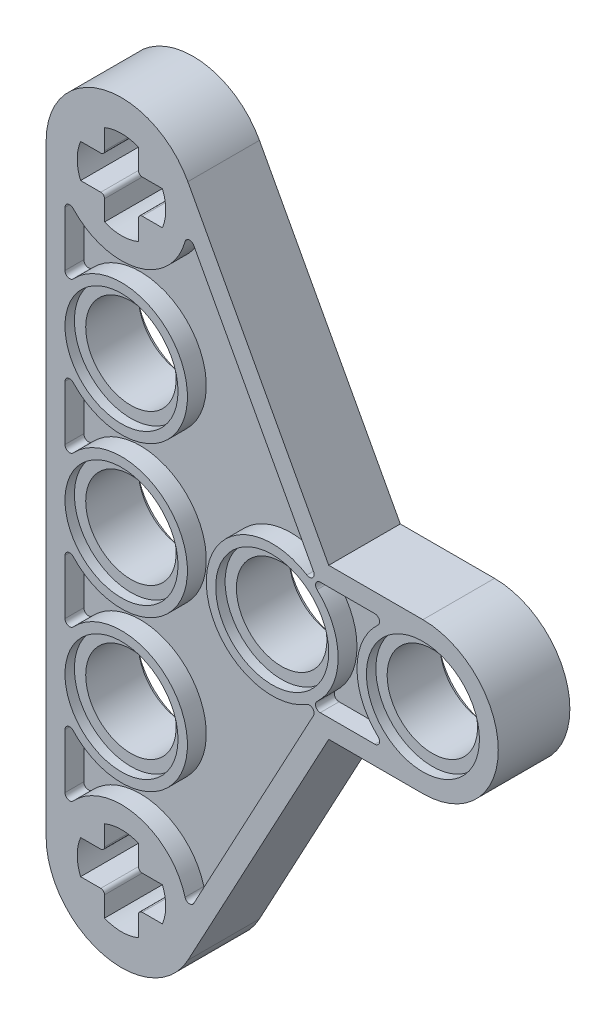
ISO-10303-21;
HEADER;
FILE_DESCRIPTION(('STEP AP214'),'2;1');
FILE_NAME('part.step','',(''),(''),'','','');
FILE_SCHEMA(('AUTOMOTIVE_DESIGN { 1 0 10303 214 1 1 1 1 }'));
ENDSEC;
DATA;
#1=APPLICATION_CONTEXT('core data for automotive mechanical design processes');
#2=APPLICATION_PROTOCOL_DEFINITION('international standard','automotive_design',2000,#1);
#3=PRODUCT_CONTEXT('',#1,'mechanical');
#4=PRODUCT('Part','Part','',(#3));
#5=PRODUCT_RELATED_PRODUCT_CATEGORY('part','',(#4));
#6=PRODUCT_DEFINITION_FORMATION('','',#4);
#7=PRODUCT_DEFINITION_CONTEXT('part definition',#1,'design');
#8=PRODUCT_DEFINITION('design','',#6,#7);
#9=PRODUCT_DEFINITION_SHAPE('','',#8);
#10=(LENGTH_UNIT() NAMED_UNIT(*) SI_UNIT(.MILLI.,.METRE.));
#11=(NAMED_UNIT(*) PLANE_ANGLE_UNIT() SI_UNIT($,.RADIAN.));
#12=(NAMED_UNIT(*) SI_UNIT($,.STERADIAN.) SOLID_ANGLE_UNIT());
#13=UNCERTAINTY_MEASURE_WITH_UNIT(LENGTH_MEASURE(1.E-05),#10,'distance_accuracy_value','');
#14=(GEOMETRIC_REPRESENTATION_CONTEXT(3) GLOBAL_UNCERTAINTY_ASSIGNED_CONTEXT((#13)) GLOBAL_UNIT_ASSIGNED_CONTEXT((#10,
#11,#12)) REPRESENTATION_CONTEXT('',''));
#15=CARTESIAN_POINT('',(0.,0.,0.));
#16=DIRECTION('',(0.,0.,1.));
#17=DIRECTION('',(1.,0.,0.));
#18=AXIS2_PLACEMENT_3D('',#15,#16,#17);
#19=CARTESIAN_POINT('',(0.,0.,-1.9));
#20=DIRECTION('',(0.,0.,1.));
#21=DIRECTION('',(1.,0.,0.));
#22=AXIS2_PLACEMENT_3D('',#19,#20,#21);
#23=PLANE('',#22);
#24=CARTESIAN_POINT('',(-16.,8.,-1.9));
#25=DIRECTION('',(0.,0.,1.));
#26=DIRECTION('',(1.,0.,0.));
#27=AXIS2_PLACEMENT_3D('',#24,#25,#26);
#28=CIRCLE('',#27,3.);
#29=CARTESIAN_POINT('',(-13.,8.,-1.9));
#30=VERTEX_POINT('',#29);
#31=EDGE_CURVE('E1525',#30,#30,#28,.T.);
#32=ORIENTED_EDGE('',*,*,#31,.T.);
#33=EDGE_LOOP('',(#32));
#34=FACE_BOUND('',#33,.T.);
#35=CARTESIAN_POINT('',(-8.00000000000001,0.,-1.9));
#36=DIRECTION('',(0.,0.,1.));
#37=DIRECTION('',(1.,0.,0.));
#38=AXIS2_PLACEMENT_3D('',#35,#36,#37);
#39=CIRCLE('',#38,3.);
#40=CARTESIAN_POINT('',(-5.00000000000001,0.,-1.9));
#41=VERTEX_POINT('',#40);
#42=EDGE_CURVE('E1514',#41,#41,#39,.T.);
#43=ORIENTED_EDGE('',*,*,#42,.T.);
#44=EDGE_LOOP('',(#43));
#45=FACE_BOUND('',#44,.T.);
#46=CARTESIAN_POINT('',(-5.45049024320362,2.75,-1.9));
#47=DIRECTION('',(0.,0.,1.));
#48=DIRECTION('',(-1.,0.,0.));
#49=AXIS2_PLACEMENT_3D('',#46,#47,#48);
#50=CIRCLE('',#49,0.249999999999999);
#51=CARTESIAN_POINT('',(-5.45049024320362,3.,-1.9));
#52=VERTEX_POINT('',#51);
#53=CARTESIAN_POINT('',(-5.62045756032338,2.56666666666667,-1.9));
#54=VERTEX_POINT('',#53);
#55=EDGE_CURVE('E54',#52,#54,#50,.T.);
#56=ORIENTED_EDGE('',*,*,#55,.T.);
#57=CARTESIAN_POINT('',(-8.00000000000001,0.,-1.9));
#58=DIRECTION('',(0.,0.,-1.));
#59=DIRECTION('',(-1.,0.,0.));
#60=AXIS2_PLACEMENT_3D('',#57,#58,#59);
#61=CIRCLE('',#60,3.5);
#62=CARTESIAN_POINT('',(-5.62045756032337,-2.56666666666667,-1.9));
#63=VERTEX_POINT('',#62);
#64=EDGE_CURVE('E703',#54,#63,#61,.T.);
#65=ORIENTED_EDGE('',*,*,#64,.T.);
#66=CARTESIAN_POINT('',(-5.45049024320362,-2.75,-1.9));
#67=DIRECTION('',(0.,0.,1.));
#68=DIRECTION('',(1.,0.,0.));
#69=AXIS2_PLACEMENT_3D('',#66,#67,#68);
#70=CIRCLE('',#69,0.249999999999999);
#71=CARTESIAN_POINT('',(-5.45049024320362,-3.,-1.9));
#72=VERTEX_POINT('',#71);
#73=EDGE_CURVE('E706',#63,#72,#70,.T.);
#74=ORIENTED_EDGE('',*,*,#73,.T.);
#75=DIRECTION('',(1.,0.,0.));
#76=VECTOR('',#75,1.);
#77=CARTESIAN_POINT('',(-5.45049024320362,-3.,-1.9));
#78=LINE('',#77,#76);
#79=CARTESIAN_POINT('',(-2.54950975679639,-3.,-1.9));
#80=VERTEX_POINT('',#79);
#81=EDGE_CURVE('E735',#72,#80,#78,.T.);
#82=ORIENTED_EDGE('',*,*,#81,.T.);
#83=CARTESIAN_POINT('',(-2.54950975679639,-2.75,-1.9));
#84=DIRECTION('',(0.,0.,1.));
#85=DIRECTION('',(-1.,0.,0.));
#86=AXIS2_PLACEMENT_3D('',#83,#84,#85);
#87=CIRCLE('',#86,0.249999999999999);
#88=CARTESIAN_POINT('',(-2.37954243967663,-2.56666666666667,-1.9));
#89=VERTEX_POINT('',#88);
#90=EDGE_CURVE('E732',#80,#89,#87,.T.);
#91=ORIENTED_EDGE('',*,*,#90,.T.);
#92=CARTESIAN_POINT('',(0.,0.,-1.9));
#93=DIRECTION('',(0.,0.,-1.));
#94=DIRECTION('',(-1.,0.,0.));
#95=AXIS2_PLACEMENT_3D('',#92,#93,#94);
#96=CIRCLE('',#95,3.5);
#97=CARTESIAN_POINT('',(-2.37954243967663,2.56666666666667,-1.9));
#98=VERTEX_POINT('',#97);
#99=EDGE_CURVE('E729',#89,#98,#96,.T.);
#100=ORIENTED_EDGE('',*,*,#99,.T.);
#101=CARTESIAN_POINT('',(-2.54950975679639,2.75,-1.9));
#102=DIRECTION('',(0.,0.,1.));
#103=DIRECTION('',(1.,0.,0.));
#104=AXIS2_PLACEMENT_3D('',#101,#102,#103);
#105=CIRCLE('',#104,0.249999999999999);
#106=CARTESIAN_POINT('',(-2.54950975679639,3.,-1.9));
#107=VERTEX_POINT('',#106);
#108=EDGE_CURVE('E726',#98,#107,#105,.T.);
#109=ORIENTED_EDGE('',*,*,#108,.T.);
#110=DIRECTION('',(-1.,0.,0.));
#111=VECTOR('',#110,1.);
#112=CARTESIAN_POINT('',(-5.45049024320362,3.,-1.9));
#113=LINE('',#112,#111);
#114=EDGE_CURVE('E723',#107,#52,#113,.T.);
#115=ORIENTED_EDGE('',*,*,#114,.T.);
#116=EDGE_LOOP('',(#56,#65,#74,#82,#91,#100,#109,#115));
#117=FACE_BOUND('',#116,.T.);
#118=CARTESIAN_POINT('',(0.,0.,-1.9));
#119=DIRECTION('',(0.,0.,1.));
#120=DIRECTION('',(1.,0.,0.));
#121=AXIS2_PLACEMENT_3D('',#118,#119,#120);
#122=CIRCLE('',#121,4.);
#123=CARTESIAN_POINT('',(0.,-4.00000000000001,-1.9));
#124=VERTEX_POINT('',#123);
#125=CARTESIAN_POINT('',(0.,4.,-1.9));
#126=VERTEX_POINT('',#125);
#127=EDGE_CURVE('E1441',#124,#126,#122,.T.);
#128=ORIENTED_EDGE('',*,*,#127,.F.);
#129=DIRECTION('',(1.,0.,0.));
#130=VECTOR('',#129,1.);
#131=CARTESIAN_POINT('',(-5.,-4.,-1.9));
#132=LINE('',#131,#130);
#133=CARTESIAN_POINT('',(-5.,-4.,-1.9));
#134=VERTEX_POINT('',#133);
#135=EDGE_CURVE('E1446',#134,#124,#132,.T.);
#136=ORIENTED_EDGE('',*,*,#135,.F.);
#137=DIRECTION('',(0.473875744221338,0.880591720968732,0.));
#138=VECTOR('',#137,1.);
#139=CARTESIAN_POINT('',(-12.4776331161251,-17.8955029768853,-1.9));
#140=LINE('',#139,#138);
#141=CARTESIAN_POINT('',(-12.4776331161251,-17.8955029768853,-1.9));
#142=VERTEX_POINT('',#141);
#143=EDGE_CURVE('E1473',#142,#134,#140,.T.);
#144=ORIENTED_EDGE('',*,*,#143,.F.);
#145=CARTESIAN_POINT('',(-16.,-16.,-1.9));
#146=DIRECTION('',(0.,0.,1.));
#147=DIRECTION('',(1.,0.,0.));
#148=AXIS2_PLACEMENT_3D('',#145,#146,#147);
#149=CIRCLE('',#148,4.);
#150=CARTESIAN_POINT('',(-20.,-16.,-1.9));
#151=VERTEX_POINT('',#150);
#152=EDGE_CURVE('E1471',#151,#142,#149,.T.);
#153=ORIENTED_EDGE('',*,*,#152,.F.);
#154=DIRECTION('',(0.,-1.,0.));
#155=VECTOR('',#154,1.);
#156=CARTESIAN_POINT('',(-20.,-16.,-1.9));
#157=LINE('',#156,#155);
#158=CARTESIAN_POINT('',(-20.,16.,-1.9));
#159=VERTEX_POINT('',#158);
#160=EDGE_CURVE('E1469',#159,#151,#157,.T.);
#161=ORIENTED_EDGE('',*,*,#160,.F.);
#162=CARTESIAN_POINT('',(-16.,16.,-1.9));
#163=DIRECTION('',(0.,0.,1.));
#164=DIRECTION('',(-1.,0.,0.));
#165=AXIS2_PLACEMENT_3D('',#162,#163,#164);
#166=CIRCLE('',#165,4.);
#167=CARTESIAN_POINT('',(-12.4776331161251,17.8955029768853,-1.9));
#168=VERTEX_POINT('',#167);
#169=EDGE_CURVE('E1467',#168,#159,#166,.T.);
#170=ORIENTED_EDGE('',*,*,#169,.F.);
#171=DIRECTION('',(-0.473875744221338,0.880591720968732,0.));
#172=VECTOR('',#171,1.);
#173=CARTESIAN_POINT('',(-12.4776331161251,17.8955029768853,-1.9));
#174=LINE('',#173,#172);
#175=CARTESIAN_POINT('',(-5.,4.,-1.9));
#176=VERTEX_POINT('',#175);
#177=EDGE_CURVE('E1465',#176,#168,#174,.T.);
#178=ORIENTED_EDGE('',*,*,#177,.F.);
#179=DIRECTION('',(-1.,0.,0.));
#180=VECTOR('',#179,1.);
#181=CARTESIAN_POINT('',(-5.,4.,-1.9));
#182=LINE('',#181,#180);
#183=EDGE_CURVE('E1463',#126,#176,#182,.T.);
#184=ORIENTED_EDGE('',*,*,#183,.F.);
#185=EDGE_LOOP('',(#128,#136,#144,#153,#161,#170,#178,#184));
#186=FACE_BOUND('',#185,.T.);
#187=CARTESIAN_POINT('',(-14.9,-17.1,-1.9));
#188=DIRECTION('',(0.,0.,-1.));
#189=DIRECTION('',(-1.,0.,0.));
#190=AXIS2_PLACEMENT_3D('',#187,#188,#189);
#191=CIRCLE('',#190,0.200000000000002);
#192=CARTESIAN_POINT('',(-15.1,-17.1,-1.9));
#193=VERTEX_POINT('',#192);
#194=CARTESIAN_POINT('',(-14.9,-16.9,-1.9));
#195=VERTEX_POINT('',#194);
#196=EDGE_CURVE('E1326',#193,#195,#191,.T.);
#197=ORIENTED_EDGE('',*,*,#196,.T.);
#198=DIRECTION('',(1.,0.,0.));
#199=VECTOR('',#198,1.);
#200=CARTESIAN_POINT('',(-13.8291706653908,-16.9,-1.9));
#201=LINE('',#200,#199);
#202=CARTESIAN_POINT('',(-13.8291706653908,-16.9,-1.9));
#203=VERTEX_POINT('',#202);
#204=EDGE_CURVE('E1364',#195,#203,#201,.T.);
#205=ORIENTED_EDGE('',*,*,#204,.T.);
#206=CARTESIAN_POINT('',(-16.,-16.,-1.9));
#207=DIRECTION('',(0.,0.,1.));
#208=DIRECTION('',(1.,0.,0.));
#209=AXIS2_PLACEMENT_3D('',#206,#207,#208);
#210=CIRCLE('',#209,2.35);
#211=CARTESIAN_POINT('',(-13.8291706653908,-15.1,-1.9));
#212=VERTEX_POINT('',#211);
#213=EDGE_CURVE('E1367',#203,#212,#210,.T.);
#214=ORIENTED_EDGE('',*,*,#213,.T.);
#215=DIRECTION('',(-1.,0.,0.));
#216=VECTOR('',#215,1.);
#217=CARTESIAN_POINT('',(-13.8291706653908,-15.1,-1.9));
#218=LINE('',#217,#216);
#219=CARTESIAN_POINT('',(-14.9,-15.1,-1.9));
#220=VERTEX_POINT('',#219);
#221=EDGE_CURVE('E1370',#212,#220,#218,.T.);
#222=ORIENTED_EDGE('',*,*,#221,.T.);
#223=CARTESIAN_POINT('',(-14.9,-14.9,-1.9));
#224=DIRECTION('',(0.,0.,-1.));
#225=DIRECTION('',(-1.,0.,0.));
#226=AXIS2_PLACEMENT_3D('',#223,#224,#225);
#227=CIRCLE('',#226,0.200000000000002);
#228=CARTESIAN_POINT('',(-15.1,-14.9,-1.9));
#229=VERTEX_POINT('',#228);
#230=EDGE_CURVE('E1373',#220,#229,#227,.T.);
#231=ORIENTED_EDGE('',*,*,#230,.T.);
#232=DIRECTION('',(0.,1.,0.));
#233=VECTOR('',#232,1.);
#234=CARTESIAN_POINT('',(-15.1,-14.9,-1.9));
#235=LINE('',#234,#233);
#236=CARTESIAN_POINT('',(-15.1,-13.8291706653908,-1.9));
#237=VERTEX_POINT('',#236);
#238=EDGE_CURVE('E1376',#229,#237,#235,.T.);
#239=ORIENTED_EDGE('',*,*,#238,.T.);
#240=CARTESIAN_POINT('',(-16.,-16.,-1.9));
#241=DIRECTION('',(0.,0.,1.));
#242=DIRECTION('',(1.,0.,0.));
#243=AXIS2_PLACEMENT_3D('',#240,#241,#242);
#244=CIRCLE('',#243,2.35);
#245=CARTESIAN_POINT('',(-16.9,-13.8291706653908,-1.9));
#246=VERTEX_POINT('',#245);
#247=EDGE_CURVE('E1379',#237,#246,#244,.T.);
#248=ORIENTED_EDGE('',*,*,#247,.T.);
#249=DIRECTION('',(0.,-1.,0.));
#250=VECTOR('',#249,1.);
#251=CARTESIAN_POINT('',(-16.9,-14.9,-1.9));
#252=LINE('',#251,#250);
#253=CARTESIAN_POINT('',(-16.9,-14.9,-1.9));
#254=VERTEX_POINT('',#253);
#255=EDGE_CURVE('E1382',#246,#254,#252,.T.);
#256=ORIENTED_EDGE('',*,*,#255,.T.);
#257=CARTESIAN_POINT('',(-17.1,-14.9,-1.9));
#258=DIRECTION('',(0.,0.,-1.));
#259=DIRECTION('',(-1.,0.,0.));
#260=AXIS2_PLACEMENT_3D('',#257,#258,#259);
#261=CIRCLE('',#260,0.200000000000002);
#262=CARTESIAN_POINT('',(-17.1,-15.1,-1.9));
#263=VERTEX_POINT('',#262);
#264=EDGE_CURVE('E1385',#254,#263,#261,.T.);
#265=ORIENTED_EDGE('',*,*,#264,.T.);
#266=DIRECTION('',(-1.,0.,0.));
#267=VECTOR('',#266,1.);
#268=CARTESIAN_POINT('',(-18.1708293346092,-15.1,-1.9));
#269=LINE('',#268,#267);
#270=CARTESIAN_POINT('',(-18.1708293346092,-15.1,-1.9));
#271=VERTEX_POINT('',#270);
#272=EDGE_CURVE('E1388',#263,#271,#269,.T.);
#273=ORIENTED_EDGE('',*,*,#272,.T.);
#274=CARTESIAN_POINT('',(-16.,-16.,-1.9));
#275=DIRECTION('',(0.,0.,1.));
#276=DIRECTION('',(-1.,0.,0.));
#277=AXIS2_PLACEMENT_3D('',#274,#275,#276);
#278=CIRCLE('',#277,2.35);
#279=CARTESIAN_POINT('',(-18.1708293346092,-16.9,-1.9));
#280=VERTEX_POINT('',#279);
#281=EDGE_CURVE('E1391',#271,#280,#278,.T.);
#282=ORIENTED_EDGE('',*,*,#281,.T.);
#283=DIRECTION('',(1.,0.,0.));
#284=VECTOR('',#283,1.);
#285=CARTESIAN_POINT('',(-18.1708293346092,-16.9,-1.9));
#286=LINE('',#285,#284);
#287=CARTESIAN_POINT('',(-17.1,-16.9,-1.9));
#288=VERTEX_POINT('',#287);
#289=EDGE_CURVE('E1394',#280,#288,#286,.T.);
#290=ORIENTED_EDGE('',*,*,#289,.T.);
#291=CARTESIAN_POINT('',(-17.1,-17.1,-1.9));
#292=DIRECTION('',(0.,0.,-1.));
#293=DIRECTION('',(-1.,0.,0.));
#294=AXIS2_PLACEMENT_3D('',#291,#292,#293);
#295=CIRCLE('',#294,0.200000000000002);
#296=CARTESIAN_POINT('',(-16.9,-17.1,-1.9));
#297=VERTEX_POINT('',#296);
#298=EDGE_CURVE('E1397',#288,#297,#295,.T.);
#299=ORIENTED_EDGE('',*,*,#298,.T.);
#300=DIRECTION('',(0.,-1.,0.));
#301=VECTOR('',#300,1.);
#302=CARTESIAN_POINT('',(-16.9,-17.1,-1.9));
#303=LINE('',#302,#301);
#304=CARTESIAN_POINT('',(-16.9,-18.1708293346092,-1.9));
#305=VERTEX_POINT('',#304);
#306=EDGE_CURVE('E1400',#297,#305,#303,.T.);
#307=ORIENTED_EDGE('',*,*,#306,.T.);
#308=CARTESIAN_POINT('',(-16.,-16.,-1.9));
#309=DIRECTION('',(0.,0.,1.));
#310=DIRECTION('',(-1.,0.,0.));
#311=AXIS2_PLACEMENT_3D('',#308,#309,#310);
#312=CIRCLE('',#311,2.35);
#313=CARTESIAN_POINT('',(-15.1,-18.1708293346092,-1.9));
#314=VERTEX_POINT('',#313);
#315=EDGE_CURVE('E1403',#305,#314,#312,.T.);
#316=ORIENTED_EDGE('',*,*,#315,.T.);
#317=DIRECTION('',(0.,1.,0.));
#318=VECTOR('',#317,1.);
#319=CARTESIAN_POINT('',(-15.1,-17.1,-1.9));
#320=LINE('',#319,#318);
#321=EDGE_CURVE('E1330',#314,#193,#320,.T.);
#322=ORIENTED_EDGE('',*,*,#321,.T.);
#323=EDGE_LOOP('',(#197,#205,#214,#222,#231,#239,#248,#256,#265,#273,#282,#290,#299,#307,#316,#322));
#324=FACE_BOUND('',#323,.T.);
#325=CARTESIAN_POINT('',(-16.,16.,-1.9));
#326=DIRECTION('',(0.,0.,1.));
#327=DIRECTION('',(1.,0.,0.));
#328=AXIS2_PLACEMENT_3D('',#325,#326,#327);
#329=CIRCLE('',#328,2.35);
#330=CARTESIAN_POINT('',(-18.1708293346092,16.9,-1.9));
#331=VERTEX_POINT('',#330);
#332=CARTESIAN_POINT('',(-18.1708293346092,15.1,-1.9));
#333=VERTEX_POINT('',#332);
#334=EDGE_CURVE('E1246',#331,#333,#329,.T.);
#335=ORIENTED_EDGE('',*,*,#334,.T.);
#336=DIRECTION('',(1.,0.,0.));
#337=VECTOR('',#336,1.);
#338=CARTESIAN_POINT('',(-18.1708293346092,15.1,-1.9));
#339=LINE('',#338,#337);
#340=CARTESIAN_POINT('',(-17.1,15.1,-1.9));
#341=VERTEX_POINT('',#340);
#342=EDGE_CURVE('E1249',#333,#341,#339,.T.);
#343=ORIENTED_EDGE('',*,*,#342,.T.);
#344=CARTESIAN_POINT('',(-17.1,14.9,-1.9));
#345=DIRECTION('',(0.,0.,-1.));
#346=DIRECTION('',(1.,0.,0.));
#347=AXIS2_PLACEMENT_3D('',#344,#345,#346);
#348=CIRCLE('',#347,0.200000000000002);
#349=CARTESIAN_POINT('',(-16.9,14.9,-1.9));
#350=VERTEX_POINT('',#349);
#351=EDGE_CURVE('E1252',#341,#350,#348,.T.);
#352=ORIENTED_EDGE('',*,*,#351,.T.);
#353=DIRECTION('',(0.,-1.,0.));
#354=VECTOR('',#353,1.);
#355=CARTESIAN_POINT('',(-16.9,14.9,-1.9));
#356=LINE('',#355,#354);
#357=CARTESIAN_POINT('',(-16.9,13.8291706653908,-1.9));
#358=VERTEX_POINT('',#357);
#359=EDGE_CURVE('E1255',#350,#358,#356,.T.);
#360=ORIENTED_EDGE('',*,*,#359,.T.);
#361=CARTESIAN_POINT('',(-16.,16.,-1.9));
#362=DIRECTION('',(0.,0.,1.));
#363=DIRECTION('',(-1.,0.,0.));
#364=AXIS2_PLACEMENT_3D('',#361,#362,#363);
#365=CIRCLE('',#364,2.35);
#366=CARTESIAN_POINT('',(-15.1,13.8291706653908,-1.9));
#367=VERTEX_POINT('',#366);
#368=EDGE_CURVE('E1258',#358,#367,#365,.T.);
#369=ORIENTED_EDGE('',*,*,#368,.T.);
#370=DIRECTION('',(0.,1.,0.));
#371=VECTOR('',#370,1.);
#372=CARTESIAN_POINT('',(-15.1,14.9,-1.9));
#373=LINE('',#372,#371);
#374=CARTESIAN_POINT('',(-15.1,14.9,-1.9));
#375=VERTEX_POINT('',#374);
#376=EDGE_CURVE('E1261',#367,#375,#373,.T.);
#377=ORIENTED_EDGE('',*,*,#376,.T.);
#378=CARTESIAN_POINT('',(-14.9,14.9,-1.9));
#379=DIRECTION('',(0.,0.,-1.));
#380=DIRECTION('',(1.,0.,0.));
#381=AXIS2_PLACEMENT_3D('',#378,#379,#380);
#382=CIRCLE('',#381,0.200000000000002);
#383=CARTESIAN_POINT('',(-14.9,15.1,-1.9));
#384=VERTEX_POINT('',#383);
#385=EDGE_CURVE('E1264',#375,#384,#382,.T.);
#386=ORIENTED_EDGE('',*,*,#385,.T.);
#387=DIRECTION('',(1.,0.,0.));
#388=VECTOR('',#387,1.);
#389=CARTESIAN_POINT('',(-13.8291706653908,15.1,-1.9));
#390=LINE('',#389,#388);
#391=CARTESIAN_POINT('',(-13.8291706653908,15.1,-1.9));
#392=VERTEX_POINT('',#391);
#393=EDGE_CURVE('E1267',#384,#392,#390,.T.);
#394=ORIENTED_EDGE('',*,*,#393,.T.);
#395=CARTESIAN_POINT('',(-16.,16.,-1.9));
#396=DIRECTION('',(0.,0.,1.));
#397=DIRECTION('',(-1.,0.,0.));
#398=AXIS2_PLACEMENT_3D('',#395,#396,#397);
#399=CIRCLE('',#398,2.35);
#400=CARTESIAN_POINT('',(-13.8291706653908,16.9,-1.9));
#401=VERTEX_POINT('',#400);
#402=EDGE_CURVE('E1270',#392,#401,#399,.T.);
#403=ORIENTED_EDGE('',*,*,#402,.T.);
#404=DIRECTION('',(-1.,0.,0.));
#405=VECTOR('',#404,1.);
#406=CARTESIAN_POINT('',(-13.8291706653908,16.9,-1.9));
#407=LINE('',#406,#405);
#408=CARTESIAN_POINT('',(-14.9,16.9,-1.9));
#409=VERTEX_POINT('',#408);
#410=EDGE_CURVE('E1273',#401,#409,#407,.T.);
#411=ORIENTED_EDGE('',*,*,#410,.T.);
#412=CARTESIAN_POINT('',(-14.9,17.1,-1.9));
#413=DIRECTION('',(0.,0.,-1.));
#414=DIRECTION('',(1.,0.,0.));
#415=AXIS2_PLACEMENT_3D('',#412,#413,#414);
#416=CIRCLE('',#415,0.200000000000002);
#417=CARTESIAN_POINT('',(-15.1,17.1,-1.9));
#418=VERTEX_POINT('',#417);
#419=EDGE_CURVE('E1276',#409,#418,#416,.T.);
#420=ORIENTED_EDGE('',*,*,#419,.T.);
#421=DIRECTION('',(0.,1.,0.));
#422=VECTOR('',#421,1.);
#423=CARTESIAN_POINT('',(-15.1,17.1,-1.9));
#424=LINE('',#423,#422);
#425=CARTESIAN_POINT('',(-15.1,18.1708293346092,-1.9));
#426=VERTEX_POINT('',#425);
#427=EDGE_CURVE('E1279',#418,#426,#424,.T.);
#428=ORIENTED_EDGE('',*,*,#427,.T.);
#429=CARTESIAN_POINT('',(-16.,16.,-1.9));
#430=DIRECTION('',(0.,0.,1.));
#431=DIRECTION('',(1.,0.,0.));
#432=AXIS2_PLACEMENT_3D('',#429,#430,#431);
#433=CIRCLE('',#432,2.35);
#434=CARTESIAN_POINT('',(-16.9,18.1708293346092,-1.9));
#435=VERTEX_POINT('',#434);
#436=EDGE_CURVE('E1282',#426,#435,#433,.T.);
#437=ORIENTED_EDGE('',*,*,#436,.T.);
#438=DIRECTION('',(0.,-1.,0.));
#439=VECTOR('',#438,1.);
#440=CARTESIAN_POINT('',(-16.9,17.1,-1.9));
#441=LINE('',#440,#439);
#442=CARTESIAN_POINT('',(-16.9,17.1,-1.9));
#443=VERTEX_POINT('',#442);
#444=EDGE_CURVE('E1285',#435,#443,#441,.T.);
#445=ORIENTED_EDGE('',*,*,#444,.T.);
#446=CARTESIAN_POINT('',(-17.1,17.1,-1.9));
#447=DIRECTION('',(0.,0.,-1.));
#448=DIRECTION('',(1.,0.,0.));
#449=AXIS2_PLACEMENT_3D('',#446,#447,#448);
#450=CIRCLE('',#449,0.200000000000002);
#451=CARTESIAN_POINT('',(-17.1,16.9,-1.9));
#452=VERTEX_POINT('',#451);
#453=EDGE_CURVE('E1288',#443,#452,#450,.T.);
#454=ORIENTED_EDGE('',*,*,#453,.T.);
#455=DIRECTION('',(-1.,0.,0.));
#456=VECTOR('',#455,1.);
#457=CARTESIAN_POINT('',(-18.1708293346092,16.9,-1.9));
#458=LINE('',#457,#456);
#459=EDGE_CURVE('E1214',#452,#331,#458,.T.);
#460=ORIENTED_EDGE('',*,*,#459,.T.);
#461=EDGE_LOOP('',(#335,#343,#352,#360,#369,#377,#386,#394,#403,#411,#420,#428,#437,#445,#454,#460));
#462=FACE_BOUND('',#461,.T.);
#463=CARTESIAN_POINT('',(-12.3842694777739,15.0055188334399,-1.9));
#464=DIRECTION('',(0.,0.,1.));
#465=DIRECTION('',(-1.,0.,0.));
#466=AXIS2_PLACEMENT_3D('',#463,#464,#465);
#467=CIRCLE('',#466,0.25);
#468=CARTESIAN_POINT('',(-12.1641215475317,15.1239877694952,-1.9));
#469=VERTEX_POINT('',#468);
#470=CARTESIAN_POINT('',(-12.6253181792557,15.0718175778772,-1.9));
#471=VERTEX_POINT('',#470);
#472=EDGE_CURVE('E62',#469,#471,#467,.T.);
#473=ORIENTED_EDGE('',*,*,#472,.T.);
#474=CARTESIAN_POINT('',(-16.,16.,-1.9));
#475=DIRECTION('',(0.,0.,-1.));
#476=DIRECTION('',(1.,0.,0.));
#477=AXIS2_PLACEMENT_3D('',#474,#475,#476);
#478=CIRCLE('',#477,3.5);
#479=CARTESIAN_POINT('',(-18.5666666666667,13.6204575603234,-1.9));
#480=VERTEX_POINT('',#479);
#481=EDGE_CURVE('E757',#471,#480,#478,.T.);
#482=ORIENTED_EDGE('',*,*,#481,.T.);
#483=CARTESIAN_POINT('',(-18.75,13.4504902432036,-1.9));
#484=DIRECTION('',(0.,0.,1.));
#485=DIRECTION('',(1.,0.,0.));
#486=AXIS2_PLACEMENT_3D('',#483,#484,#485);
#487=CIRCLE('',#486,0.25);
#488=CARTESIAN_POINT('',(-19.,13.4504902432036,-1.9));
#489=VERTEX_POINT('',#488);
#490=EDGE_CURVE('E870',#480,#489,#487,.T.);
#491=ORIENTED_EDGE('',*,*,#490,.T.);
#492=DIRECTION('',(0.,-1.,0.));
#493=VECTOR('',#492,1.);
#494=CARTESIAN_POINT('',(-19.,13.4504902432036,-1.9));
#495=LINE('',#494,#493);
#496=CARTESIAN_POINT('',(-19.,10.5495097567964,-1.9));
#497=VERTEX_POINT('',#496);
#498=EDGE_CURVE('E867',#489,#497,#495,.T.);
#499=ORIENTED_EDGE('',*,*,#498,.T.);
#500=CARTESIAN_POINT('',(-18.75,10.5495097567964,-1.9));
#501=DIRECTION('',(0.,0.,1.));
#502=DIRECTION('',(1.,0.,0.));
#503=AXIS2_PLACEMENT_3D('',#500,#501,#502);
#504=CIRCLE('',#503,0.25);
#505=CARTESIAN_POINT('',(-18.5666666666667,10.3795424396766,-1.9));
#506=VERTEX_POINT('',#505);
#507=EDGE_CURVE('E864',#497,#506,#504,.T.);
#508=ORIENTED_EDGE('',*,*,#507,.T.);
#509=CARTESIAN_POINT('',(-16.,8.,-1.9));
#510=DIRECTION('',(0.,0.,-1.));
#511=DIRECTION('',(1.,0.,0.));
#512=AXIS2_PLACEMENT_3D('',#509,#510,#511);
#513=CIRCLE('',#512,3.5);
#514=CARTESIAN_POINT('',(-18.5666666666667,5.6204575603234,-1.9));
#515=VERTEX_POINT('',#514);
#516=EDGE_CURVE('E861',#506,#515,#513,.T.);
#517=ORIENTED_EDGE('',*,*,#516,.T.);
#518=CARTESIAN_POINT('',(-18.75,5.45049024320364,-1.9));
#519=DIRECTION('',(0.,0.,1.));
#520=DIRECTION('',(1.,0.,0.));
#521=AXIS2_PLACEMENT_3D('',#518,#519,#520);
#522=CIRCLE('',#521,0.249999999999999);
#523=CARTESIAN_POINT('',(-19.,5.45049024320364,-1.9));
#524=VERTEX_POINT('',#523);
#525=EDGE_CURVE('E858',#515,#524,#522,.T.);
#526=ORIENTED_EDGE('',*,*,#525,.T.);
#527=DIRECTION('',(0.,-1.,0.));
#528=VECTOR('',#527,1.);
#529=CARTESIAN_POINT('',(-19.,5.45049024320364,-1.9));
#530=LINE('',#529,#528);
#531=CARTESIAN_POINT('',(-19.,2.54950975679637,-1.9));
#532=VERTEX_POINT('',#531);
#533=EDGE_CURVE('E855',#524,#532,#530,.T.);
#534=ORIENTED_EDGE('',*,*,#533,.T.);
#535=CARTESIAN_POINT('',(-18.75,2.54950975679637,-1.9));
#536=DIRECTION('',(0.,0.,1.));
#537=DIRECTION('',(-1.,0.,0.));
#538=AXIS2_PLACEMENT_3D('',#535,#536,#537);
#539=CIRCLE('',#538,0.25);
#540=CARTESIAN_POINT('',(-18.5666666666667,2.37954243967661,-1.9));
#541=VERTEX_POINT('',#540);
#542=EDGE_CURVE('E852',#532,#541,#539,.T.);
#543=ORIENTED_EDGE('',*,*,#542,.T.);
#544=CARTESIAN_POINT('',(-16.,0.,-1.9));
#545=DIRECTION('',(0.,0.,-1.));
#546=DIRECTION('',(1.,0.,0.));
#547=AXIS2_PLACEMENT_3D('',#544,#545,#546);
#548=CIRCLE('',#547,3.5);
#549=CARTESIAN_POINT('',(-18.5666666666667,-2.37954243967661,-1.9));
#550=VERTEX_POINT('',#549);
#551=EDGE_CURVE('E849',#541,#550,#548,.T.);
#552=ORIENTED_EDGE('',*,*,#551,.T.);
#553=CARTESIAN_POINT('',(-18.75,-2.54950975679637,-1.9));
#554=DIRECTION('',(0.,0.,1.));
#555=DIRECTION('',(1.,0.,0.));
#556=AXIS2_PLACEMENT_3D('',#553,#554,#555);
#557=CIRCLE('',#556,0.25);
#558=CARTESIAN_POINT('',(-19.,-2.54950975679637,-1.9));
#559=VERTEX_POINT('',#558);
#560=EDGE_CURVE('E846',#550,#559,#557,.T.);
#561=ORIENTED_EDGE('',*,*,#560,.T.);
#562=DIRECTION('',(0.,-1.,0.));
#563=VECTOR('',#562,1.);
#564=CARTESIAN_POINT('',(-19.,-5.45049024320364,-1.9));
#565=LINE('',#564,#563);
#566=CARTESIAN_POINT('',(-19.,-5.45049024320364,-1.9));
#567=VERTEX_POINT('',#566);
#568=EDGE_CURVE('E843',#559,#567,#565,.T.);
#569=ORIENTED_EDGE('',*,*,#568,.T.);
#570=CARTESIAN_POINT('',(-18.75,-5.45049024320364,-1.9));
#571=DIRECTION('',(0.,0.,1.));
#572=DIRECTION('',(-1.,0.,0.));
#573=AXIS2_PLACEMENT_3D('',#570,#571,#572);
#574=CIRCLE('',#573,0.249999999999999);
#575=CARTESIAN_POINT('',(-18.5666666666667,-5.6204575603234,-1.9));
#576=VERTEX_POINT('',#575);
#577=EDGE_CURVE('E840',#567,#576,#574,.T.);
#578=ORIENTED_EDGE('',*,*,#577,.T.);
#579=CARTESIAN_POINT('',(-16.,-8.,-1.9));
#580=DIRECTION('',(0.,0.,-1.));
#581=DIRECTION('',(-1.,0.,0.));
#582=AXIS2_PLACEMENT_3D('',#579,#580,#581);
#583=CIRCLE('',#582,3.5);
#584=CARTESIAN_POINT('',(-18.5666666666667,-10.3795424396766,-1.9));
#585=VERTEX_POINT('',#584);
#586=EDGE_CURVE('E837',#576,#585,#583,.T.);
#587=ORIENTED_EDGE('',*,*,#586,.T.);
#588=CARTESIAN_POINT('',(-18.75,-10.5495097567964,-1.9));
#589=DIRECTION('',(0.,0.,1.));
#590=DIRECTION('',(-1.,0.,0.));
#591=AXIS2_PLACEMENT_3D('',#588,#589,#590);
#592=CIRCLE('',#591,0.25);
#593=CARTESIAN_POINT('',(-19.,-10.5495097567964,-1.9));
#594=VERTEX_POINT('',#593);
#595=EDGE_CURVE('E834',#585,#594,#592,.T.);
#596=ORIENTED_EDGE('',*,*,#595,.T.);
#597=DIRECTION('',(0.,-1.,0.));
#598=VECTOR('',#597,1.);
#599=CARTESIAN_POINT('',(-19.,-13.4504902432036,-1.9));
#600=LINE('',#599,#598);
#601=CARTESIAN_POINT('',(-19.,-13.4504902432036,-1.9));
#602=VERTEX_POINT('',#601);
#603=EDGE_CURVE('E831',#594,#602,#600,.T.);
#604=ORIENTED_EDGE('',*,*,#603,.T.);
#605=CARTESIAN_POINT('',(-18.75,-13.4504902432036,-1.9));
#606=DIRECTION('',(0.,0.,1.));
#607=DIRECTION('',(-1.,0.,0.));
#608=AXIS2_PLACEMENT_3D('',#605,#606,#607);
#609=CIRCLE('',#608,0.25);
#610=CARTESIAN_POINT('',(-18.5666666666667,-13.6204575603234,-1.9));
#611=VERTEX_POINT('',#610);
#612=EDGE_CURVE('E828',#602,#611,#609,.T.);
#613=ORIENTED_EDGE('',*,*,#612,.T.);
#614=CARTESIAN_POINT('',(-16.,-16.,-1.9));
#615=DIRECTION('',(0.,0.,-1.));
#616=DIRECTION('',(-1.,0.,0.));
#617=AXIS2_PLACEMENT_3D('',#614,#615,#616);
#618=CIRCLE('',#617,3.5);
#619=CARTESIAN_POINT('',(-12.6253181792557,-15.0718175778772,-1.9));
#620=VERTEX_POINT('',#619);
#621=EDGE_CURVE('E825',#611,#620,#618,.T.);
#622=ORIENTED_EDGE('',*,*,#621,.T.);
#623=CARTESIAN_POINT('',(-12.3842694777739,-15.0055188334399,-1.9));
#624=DIRECTION('',(0.,0.,1.));
#625=DIRECTION('',(1.,0.,0.));
#626=AXIS2_PLACEMENT_3D('',#623,#624,#625);
#627=CIRCLE('',#626,0.25);
#628=CARTESIAN_POINT('',(-12.1641215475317,-15.1239877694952,-1.9));
#629=VERTEX_POINT('',#628);
#630=EDGE_CURVE('E822',#620,#629,#627,.T.);
#631=ORIENTED_EDGE('',*,*,#630,.T.);
#632=DIRECTION('',(0.473875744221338,0.880591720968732,0.));
#633=VECTOR('',#632,1.);
#634=CARTESIAN_POINT('',(-12.1641215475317,-15.1239877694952,-1.9));
#635=LINE('',#634,#633);
#636=CARTESIAN_POINT('',(-5.80446931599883,-3.306001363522,-1.9));
#637=VERTEX_POINT('',#636);
#638=EDGE_CURVE('E819',#629,#637,#635,.T.);
#639=ORIENTED_EDGE('',*,*,#638,.T.);
#640=CARTESIAN_POINT('',(-6.02461724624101,-3.18753242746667,-1.9));
#641=DIRECTION('',(0.,0.,1.));
#642=DIRECTION('',(1.,0.,0.));
#643=AXIS2_PLACEMENT_3D('',#640,#641,#642);
#644=CIRCLE('',#643,0.25);
#645=CARTESIAN_POINT('',(-6.15630942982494,-2.97503026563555,-1.9));
#646=VERTEX_POINT('',#645);
#647=EDGE_CURVE('E816',#637,#646,#644,.T.);
#648=ORIENTED_EDGE('',*,*,#647,.T.);
#649=CARTESIAN_POINT('',(-8.00000000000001,0.,-1.9));
#650=DIRECTION('',(0.,0.,-1.));
#651=DIRECTION('',(1.,0.,0.));
#652=AXIS2_PLACEMENT_3D('',#649,#650,#651);
#653=CIRCLE('',#652,3.5);
#654=CARTESIAN_POINT('',(-6.15630942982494,2.97503026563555,-1.9));
#655=VERTEX_POINT('',#654);
#656=EDGE_CURVE('E813',#646,#655,#653,.T.);
#657=ORIENTED_EDGE('',*,*,#656,.T.);
#658=CARTESIAN_POINT('',(-6.02461724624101,3.18753242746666,-1.9));
#659=DIRECTION('',(0.,0.,1.));
#660=DIRECTION('',(1.,0.,0.));
#661=AXIS2_PLACEMENT_3D('',#658,#659,#660);
#662=CIRCLE('',#661,0.25);
#663=CARTESIAN_POINT('',(-5.80446931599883,3.306001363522,-1.9));
#664=VERTEX_POINT('',#663);
#665=EDGE_CURVE('E810',#655,#664,#662,.T.);
#666=ORIENTED_EDGE('',*,*,#665,.T.);
#667=DIRECTION('',(-0.473875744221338,0.880591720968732,0.));
#668=VECTOR('',#667,1.);
#669=CARTESIAN_POINT('',(-12.1641215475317,15.1239877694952,-1.9));
#670=LINE('',#669,#668);
#671=EDGE_CURVE('E807',#664,#469,#670,.T.);
#672=ORIENTED_EDGE('',*,*,#671,.T.);
#673=EDGE_LOOP('',(#473,#482,#491,#499,#508,#517,#526,#534,#543,#552,#561,#569,#578,#587,#596,
#604,#613,#622,#631,#639,#648,#657,#666,#672));
#674=FACE_BOUND('',#673,.T.);
#675=CARTESIAN_POINT('',(-16.,0.,-1.9));
#676=DIRECTION('',(0.,0.,1.));
#677=DIRECTION('',(1.,0.,0.));
#678=AXIS2_PLACEMENT_3D('',#675,#676,#677);
#679=CIRCLE('',#678,3.);
#680=CARTESIAN_POINT('',(-13.,0.,-1.9));
#681=VERTEX_POINT('',#680);
#682=EDGE_CURVE('E709',#681,#681,#679,.T.);
#683=ORIENTED_EDGE('',*,*,#682,.T.);
#684=EDGE_LOOP('',(#683));
#685=FACE_BOUND('',#684,.T.);
#686=CARTESIAN_POINT('',(0.,0.,-1.9));
#687=DIRECTION('',(0.,0.,1.));
#688=DIRECTION('',(1.,0.,0.));
#689=AXIS2_PLACEMENT_3D('',#686,#687,#688);
#690=CIRCLE('',#689,3.);
#691=CARTESIAN_POINT('',(2.99999999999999,0.,-1.9));
#692=VERTEX_POINT('',#691);
#693=EDGE_CURVE('E1518',#692,#692,#690,.T.);
#694=ORIENTED_EDGE('',*,*,#693,.T.);
#695=EDGE_LOOP('',(#694));
#696=FACE_BOUND('',#695,.T.);
#697=CARTESIAN_POINT('',(-15.9999999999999,-8.,-1.9));
#698=DIRECTION('',(0.,0.,1.));
#699=DIRECTION('',(1.,0.,0.));
#700=AXIS2_PLACEMENT_3D('',#697,#698,#699);
#701=CIRCLE('',#700,3.);
#702=CARTESIAN_POINT('',(-12.9999999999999,-8.,-1.9));
#703=VERTEX_POINT('',#702);
#704=EDGE_CURVE('E1532',#703,#703,#701,.T.);
#705=ORIENTED_EDGE('',*,*,#704,.T.);
#706=EDGE_LOOP('',(#705));
#707=FACE_BOUND('',#706,.T.);
#708=ADVANCED_FACE('F37',(#34,#45,#117,#186,#324,#462,#674,#685,#696,#707),#23,.F.);
#709=CARTESIAN_POINT('',(-16.,-8.,1.9));
#710=DIRECTION('',(0.,0.,-1.));
#711=DIRECTION('',(-1.,0.,0.));
#712=AXIS2_PLACEMENT_3D('',#709,#710,#711);
#713=CYLINDRICAL_SURFACE('',#712,2.4);
#714=CARTESIAN_POINT('',(-16.,-8.,1.4));
#715=DIRECTION('',(0.,0.,1.));
#716=DIRECTION('',(1.,0.,0.));
#717=AXIS2_PLACEMENT_3D('',#714,#715,#716);
#718=CIRCLE('',#717,2.4);
#719=CARTESIAN_POINT('',(-18.4,-8.,1.4));
#720=VERTEX_POINT('',#719);
#721=EDGE_CURVE('E1180',#720,#720,#718,.T.);
#722=CARTESIAN_POINT('',(-16.,-8.,-1.4));
#723=DIRECTION('',(0.,0.,-1.));
#724=DIRECTION('',(-1.,0.,0.));
#725=AXIS2_PLACEMENT_3D('',#722,#723,#724);
#726=CIRCLE('',#725,2.4);
#727=CARTESIAN_POINT('',(-18.4,-8.,-1.4));
#728=VERTEX_POINT('',#727);
#729=EDGE_CURVE('E41',#728,#728,#726,.T.);
#730=CARTESIAN_POINT('',(-18.4,-8.,1.4));
#731=CARTESIAN_POINT('',(-18.4,-8.,1.37083333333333));
#732=CARTESIAN_POINT('',(-18.4,-8.,1.34166666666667));
#733=CARTESIAN_POINT('',(-18.4,-8.,1.28333333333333));
#734=CARTESIAN_POINT('',(-18.4,-8.,1.25416666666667));
#735=CARTESIAN_POINT('',(-18.4,-8.,1.19583333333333));
#736=CARTESIAN_POINT('',(-18.4,-8.,1.16666666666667));
#737=CARTESIAN_POINT('',(-18.4,-8.,1.10833333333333));
#738=CARTESIAN_POINT('',(-18.4,-8.,1.07916666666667));
#739=CARTESIAN_POINT('',(-18.4,-8.,1.02083333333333));
#740=CARTESIAN_POINT('',(-18.4,-8.,0.991666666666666));
#741=CARTESIAN_POINT('',(-18.4,-8.,0.933333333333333));
#742=CARTESIAN_POINT('',(-18.4,-8.,0.904166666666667));
#743=CARTESIAN_POINT('',(-18.4,-8.,0.845833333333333));
#744=CARTESIAN_POINT('',(-18.4,-8.,0.816666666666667));
#745=CARTESIAN_POINT('',(-18.4,-8.,0.758333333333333));
#746=CARTESIAN_POINT('',(-18.4,-8.,0.729166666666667));
#747=CARTESIAN_POINT('',(-18.4,-8.,0.670833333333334));
#748=CARTESIAN_POINT('',(-18.4,-8.,0.641666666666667));
#749=CARTESIAN_POINT('',(-18.4,-8.,0.583333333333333));
#750=CARTESIAN_POINT('',(-18.4,-8.,0.554166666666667));
#751=CARTESIAN_POINT('',(-18.4,-8.,0.495833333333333));
#752=CARTESIAN_POINT('',(-18.4,-8.,0.466666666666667));
#753=CARTESIAN_POINT('',(-18.4,-8.,0.408333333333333));
#754=CARTESIAN_POINT('',(-18.4,-8.,0.379166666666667));
#755=CARTESIAN_POINT('',(-18.4,-8.,0.320833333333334));
#756=CARTESIAN_POINT('',(-18.4,-8.,0.291666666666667));
#757=CARTESIAN_POINT('',(-18.4,-8.,0.233333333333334));
#758=CARTESIAN_POINT('',(-18.4,-8.,0.204166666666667));
#759=CARTESIAN_POINT('',(-18.4,-8.,0.145833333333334));
#760=CARTESIAN_POINT('',(-18.4,-8.,0.116666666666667));
#761=CARTESIAN_POINT('',(-18.4,-8.,0.0583333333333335));
#762=CARTESIAN_POINT('',(-18.4,-8.,0.0291666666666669));
#763=CARTESIAN_POINT('',(-18.4,-8.,-0.0291666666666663));
#764=CARTESIAN_POINT('',(-18.4,-8.,-0.0583333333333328));
#765=CARTESIAN_POINT('',(-18.4,-8.,-0.116666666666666));
#766=CARTESIAN_POINT('',(-18.4,-8.,-0.145833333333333));
#767=CARTESIAN_POINT('',(-18.4,-8.,-0.204166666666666));
#768=CARTESIAN_POINT('',(-18.4,-8.,-0.233333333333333));
#769=CARTESIAN_POINT('',(-18.4,-8.,-0.291666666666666));
#770=CARTESIAN_POINT('',(-18.4,-8.,-0.320833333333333));
#771=CARTESIAN_POINT('',(-18.4,-8.,-0.379166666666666));
#772=CARTESIAN_POINT('',(-18.4,-8.,-0.408333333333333));
#773=CARTESIAN_POINT('',(-18.4,-8.,-0.466666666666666));
#774=CARTESIAN_POINT('',(-18.4,-8.,-0.495833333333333));
#775=CARTESIAN_POINT('',(-18.4,-8.,-0.554166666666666));
#776=CARTESIAN_POINT('',(-18.4,-8.,-0.583333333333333));
#777=CARTESIAN_POINT('',(-18.4,-8.,-0.641666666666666));
#778=CARTESIAN_POINT('',(-18.4,-8.,-0.670833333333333));
#779=CARTESIAN_POINT('',(-18.4,-8.,-0.729166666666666));
#780=CARTESIAN_POINT('',(-18.4,-8.,-0.758333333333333));
#781=CARTESIAN_POINT('',(-18.4,-8.,-0.816666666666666));
#782=CARTESIAN_POINT('',(-18.4,-8.,-0.845833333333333));
#783=CARTESIAN_POINT('',(-18.4,-8.,-0.904166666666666));
#784=CARTESIAN_POINT('',(-18.4,-8.,-0.933333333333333));
#785=CARTESIAN_POINT('',(-18.4,-8.,-0.991666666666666));
#786=CARTESIAN_POINT('',(-18.4,-8.,-1.02083333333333));
#787=CARTESIAN_POINT('',(-18.4,-8.,-1.07916666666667));
#788=CARTESIAN_POINT('',(-18.4,-8.,-1.10833333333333));
#789=CARTESIAN_POINT('',(-18.4,-8.,-1.16666666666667));
#790=CARTESIAN_POINT('',(-18.4,-8.,-1.19583333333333));
#791=CARTESIAN_POINT('',(-18.4,-8.,-1.25416666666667));
#792=CARTESIAN_POINT('',(-18.4,-8.,-1.28333333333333));
#793=CARTESIAN_POINT('',(-18.4,-8.,-1.34166666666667));
#794=CARTESIAN_POINT('',(-18.4,-8.,-1.37083333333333));
#795=CARTESIAN_POINT('',(-18.4,-8.,-1.4));
#796=B_SPLINE_CURVE_WITH_KNOTS('',3,(#730,#731,#732,#733,#734,#735,#736,#737,#738,#739,#740,
#741,#742,#743,#744,#745,#746,#747,#748,#749,#750,#751,#752,#753,#754,#755,#756,#757,#758,#759,
#760,#761,#762,#763,#764,#765,#766,#767,#768,#769,#770,#771,#772,#773,#774,#775,#776,#777,#778,
#779,#780,#781,#782,#783,#784,#785,#786,#787,#788,#789,#790,#791,#792,#793,#794,#795),
.UNSPECIFIED.,.F.,.F.,(4,2,2,2,2,2,2,2,2,2,2,2,2,2,2,2,2,2,2,2,2,2,2,2,2,2,2,2,2,2,2,2,4),(0.,
0.0874999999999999,0.175,0.2625,0.35,0.4375,0.525,0.6125,0.7,0.7875,0.875,0.9625,1.05,1.1375,
1.225,1.3125,1.4,1.4875,1.575,1.6625,1.75,1.8375,1.925,2.0125,2.1,2.1875,2.275,2.3625,2.45,
2.5375,2.625,2.7125,2.8),.UNSPECIFIED.);
#797=EDGE_CURVE('BSEAM1561',#720,#728,#796,.T.);
#798=ORIENTED_EDGE('',*,*,#721,.T.);
#799=ORIENTED_EDGE('',*,*,#729,.T.);
#800=ORIENTED_EDGE('',*,*,#797,.T.);
#801=ORIENTED_EDGE('',*,*,#797,.F.);
#802=EDGE_LOOP('',(#798,#800,#799,#801));
#803=FACE_BOUND('',#802,.T.);
#804=ADVANCED_FACE('F1561',(#803),#713,.F.);
#805=CARTESIAN_POINT('',(-16.,8.,1.9));
#806=DIRECTION('',(0.,0.,-1.));
#807=DIRECTION('',(-1.,0.,0.));
#808=AXIS2_PLACEMENT_3D('',#805,#806,#807);
#809=CYLINDRICAL_SURFACE('',#808,2.4);
#810=CARTESIAN_POINT('',(-16.,8.,1.4));
#811=DIRECTION('',(0.,0.,1.));
#812=DIRECTION('',(1.,0.,0.));
#813=AXIS2_PLACEMENT_3D('',#810,#811,#812);
#814=CIRCLE('',#813,2.4);
#815=CARTESIAN_POINT('',(-18.4,8.,1.4));
#816=VERTEX_POINT('',#815);
#817=EDGE_CURVE('E1186',#816,#816,#814,.T.);
#818=CARTESIAN_POINT('',(-16.,8.,-1.4));
#819=DIRECTION('',(0.,0.,-1.));
#820=DIRECTION('',(-1.,0.,0.));
#821=AXIS2_PLACEMENT_3D('',#818,#819,#820);
#822=CIRCLE('',#821,2.4);
#823=CARTESIAN_POINT('',(-18.4,8.,-1.4));
#824=VERTEX_POINT('',#823);
#825=EDGE_CURVE('E1516',#824,#824,#822,.T.);
#826=CARTESIAN_POINT('',(-18.4,8.,1.4));
#827=CARTESIAN_POINT('',(-18.4,8.,1.37083333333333));
#828=CARTESIAN_POINT('',(-18.4,8.,1.34166666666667));
#829=CARTESIAN_POINT('',(-18.4,8.,1.28333333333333));
#830=CARTESIAN_POINT('',(-18.4,8.,1.25416666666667));
#831=CARTESIAN_POINT('',(-18.4,8.,1.19583333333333));
#832=CARTESIAN_POINT('',(-18.4,8.,1.16666666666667));
#833=CARTESIAN_POINT('',(-18.4,8.,1.10833333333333));
#834=CARTESIAN_POINT('',(-18.4,8.,1.07916666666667));
#835=CARTESIAN_POINT('',(-18.4,8.,1.02083333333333));
#836=CARTESIAN_POINT('',(-18.4,8.,0.991666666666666));
#837=CARTESIAN_POINT('',(-18.4,8.,0.933333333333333));
#838=CARTESIAN_POINT('',(-18.4,8.,0.904166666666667));
#839=CARTESIAN_POINT('',(-18.4,8.,0.845833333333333));
#840=CARTESIAN_POINT('',(-18.4,8.,0.816666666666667));
#841=CARTESIAN_POINT('',(-18.4,8.,0.758333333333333));
#842=CARTESIAN_POINT('',(-18.4,8.,0.729166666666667));
#843=CARTESIAN_POINT('',(-18.4,8.,0.670833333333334));
#844=CARTESIAN_POINT('',(-18.4,8.,0.641666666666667));
#845=CARTESIAN_POINT('',(-18.4,8.,0.583333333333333));
#846=CARTESIAN_POINT('',(-18.4,8.,0.554166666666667));
#847=CARTESIAN_POINT('',(-18.4,8.,0.495833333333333));
#848=CARTESIAN_POINT('',(-18.4,8.,0.466666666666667));
#849=CARTESIAN_POINT('',(-18.4,8.,0.408333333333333));
#850=CARTESIAN_POINT('',(-18.4,8.,0.379166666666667));
#851=CARTESIAN_POINT('',(-18.4,8.,0.320833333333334));
#852=CARTESIAN_POINT('',(-18.4,8.,0.291666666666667));
#853=CARTESIAN_POINT('',(-18.4,8.,0.233333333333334));
#854=CARTESIAN_POINT('',(-18.4,8.,0.204166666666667));
#855=CARTESIAN_POINT('',(-18.4,8.,0.145833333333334));
#856=CARTESIAN_POINT('',(-18.4,8.,0.116666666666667));
#857=CARTESIAN_POINT('',(-18.4,8.,0.0583333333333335));
#858=CARTESIAN_POINT('',(-18.4,8.,0.0291666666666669));
#859=CARTESIAN_POINT('',(-18.4,8.,-0.0291666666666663));
#860=CARTESIAN_POINT('',(-18.4,8.,-0.0583333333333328));
#861=CARTESIAN_POINT('',(-18.4,8.,-0.116666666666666));
#862=CARTESIAN_POINT('',(-18.4,8.,-0.145833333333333));
#863=CARTESIAN_POINT('',(-18.4,8.,-0.204166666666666));
#864=CARTESIAN_POINT('',(-18.4,8.,-0.233333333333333));
#865=CARTESIAN_POINT('',(-18.4,8.,-0.291666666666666));
#866=CARTESIAN_POINT('',(-18.4,8.,-0.320833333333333));
#867=CARTESIAN_POINT('',(-18.4,8.,-0.379166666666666));
#868=CARTESIAN_POINT('',(-18.4,8.,-0.408333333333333));
#869=CARTESIAN_POINT('',(-18.4,8.,-0.466666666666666));
#870=CARTESIAN_POINT('',(-18.4,8.,-0.495833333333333));
#871=CARTESIAN_POINT('',(-18.4,8.,-0.554166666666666));
#872=CARTESIAN_POINT('',(-18.4,8.,-0.583333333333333));
#873=CARTESIAN_POINT('',(-18.4,8.,-0.641666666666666));
#874=CARTESIAN_POINT('',(-18.4,8.,-0.670833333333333));
#875=CARTESIAN_POINT('',(-18.4,8.,-0.729166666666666));
#876=CARTESIAN_POINT('',(-18.4,8.,-0.758333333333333));
#877=CARTESIAN_POINT('',(-18.4,8.,-0.816666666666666));
#878=CARTESIAN_POINT('',(-18.4,8.,-0.845833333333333));
#879=CARTESIAN_POINT('',(-18.4,8.,-0.904166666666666));
#880=CARTESIAN_POINT('',(-18.4,8.,-0.933333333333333));
#881=CARTESIAN_POINT('',(-18.4,8.,-0.991666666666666));
#882=CARTESIAN_POINT('',(-18.4,8.,-1.02083333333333));
#883=CARTESIAN_POINT('',(-18.4,8.,-1.07916666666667));
#884=CARTESIAN_POINT('',(-18.4,8.,-1.10833333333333));
#885=CARTESIAN_POINT('',(-18.4,8.,-1.16666666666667));
#886=CARTESIAN_POINT('',(-18.4,8.,-1.19583333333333));
#887=CARTESIAN_POINT('',(-18.4,8.,-1.25416666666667));
#888=CARTESIAN_POINT('',(-18.4,8.,-1.28333333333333));
#889=CARTESIAN_POINT('',(-18.4,8.,-1.34166666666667));
#890=CARTESIAN_POINT('',(-18.4,8.,-1.37083333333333));
#891=CARTESIAN_POINT('',(-18.4,8.,-1.4));
#892=B_SPLINE_CURVE_WITH_KNOTS('',3,(#826,#827,#828,#829,#830,#831,#832,#833,#834,#835,#836,
#837,#838,#839,#840,#841,#842,#843,#844,#845,#846,#847,#848,#849,#850,#851,#852,#853,#854,#855,
#856,#857,#858,#859,#860,#861,#862,#863,#864,#865,#866,#867,#868,#869,#870,#871,#872,#873,#874,
#875,#876,#877,#878,#879,#880,#881,#882,#883,#884,#885,#886,#887,#888,#889,#890,#891),
.UNSPECIFIED.,.F.,.F.,(4,2,2,2,2,2,2,2,2,2,2,2,2,2,2,2,2,2,2,2,2,2,2,2,2,2,2,2,2,2,2,2,4),(0.,
0.0874999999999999,0.175,0.2625,0.35,0.4375,0.525,0.6125,0.7,0.7875,0.875,0.9625,1.05,1.1375,
1.225,1.3125,1.4,1.4875,1.575,1.6625,1.75,1.8375,1.925,2.0125,2.1,2.1875,2.275,2.3625,2.45,
2.5375,2.625,2.7125,2.8),.UNSPECIFIED.);
#893=EDGE_CURVE('BSEAM1567',#816,#824,#892,.T.);
#894=ORIENTED_EDGE('',*,*,#817,.T.);
#895=ORIENTED_EDGE('',*,*,#825,.T.);
#896=ORIENTED_EDGE('',*,*,#893,.T.);
#897=ORIENTED_EDGE('',*,*,#893,.F.);
#898=EDGE_LOOP('',(#894,#896,#895,#897));
#899=FACE_BOUND('',#898,.T.);
#900=ADVANCED_FACE('F1567',(#899),#809,.F.);
#901=CARTESIAN_POINT('',(0.,0.,1.9));
#902=DIRECTION('',(0.,0.,-1.));
#903=DIRECTION('',(-1.,0.,0.));
#904=AXIS2_PLACEMENT_3D('',#901,#902,#903);
#905=CYLINDRICAL_SURFACE('',#904,2.4);
#906=CARTESIAN_POINT('',(0.,0.,1.4));
#907=DIRECTION('',(0.,0.,1.));
#908=DIRECTION('',(1.,0.,0.));
#909=AXIS2_PLACEMENT_3D('',#906,#907,#908);
#910=CIRCLE('',#909,2.4);
#911=CARTESIAN_POINT('',(-2.4,0.,1.4));
#912=VERTEX_POINT('',#911);
#913=EDGE_CURVE('E1193',#912,#912,#910,.T.);
#914=CARTESIAN_POINT('',(0.,0.,-1.4));
#915=DIRECTION('',(0.,0.,-1.));
#916=DIRECTION('',(-1.,0.,0.));
#917=AXIS2_PLACEMENT_3D('',#914,#915,#916);
#918=CIRCLE('',#917,2.4);
#919=CARTESIAN_POINT('',(-2.4,0.,-1.4));
#920=VERTEX_POINT('',#919);
#921=EDGE_CURVE('E1512',#920,#920,#918,.T.);
#922=CARTESIAN_POINT('',(-2.4,0.,1.4));
#923=CARTESIAN_POINT('',(-2.4,0.,1.37083333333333));
#924=CARTESIAN_POINT('',(-2.4,0.,1.34166666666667));
#925=CARTESIAN_POINT('',(-2.4,0.,1.28333333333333));
#926=CARTESIAN_POINT('',(-2.4,0.,1.25416666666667));
#927=CARTESIAN_POINT('',(-2.4,0.,1.19583333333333));
#928=CARTESIAN_POINT('',(-2.4,0.,1.16666666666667));
#929=CARTESIAN_POINT('',(-2.4,0.,1.10833333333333));
#930=CARTESIAN_POINT('',(-2.4,0.,1.07916666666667));
#931=CARTESIAN_POINT('',(-2.4,0.,1.02083333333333));
#932=CARTESIAN_POINT('',(-2.4,0.,0.991666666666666));
#933=CARTESIAN_POINT('',(-2.4,0.,0.933333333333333));
#934=CARTESIAN_POINT('',(-2.4,0.,0.904166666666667));
#935=CARTESIAN_POINT('',(-2.4,0.,0.845833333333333));
#936=CARTESIAN_POINT('',(-2.4,0.,0.816666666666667));
#937=CARTESIAN_POINT('',(-2.4,0.,0.758333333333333));
#938=CARTESIAN_POINT('',(-2.4,0.,0.729166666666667));
#939=CARTESIAN_POINT('',(-2.4,0.,0.670833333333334));
#940=CARTESIAN_POINT('',(-2.4,0.,0.641666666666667));
#941=CARTESIAN_POINT('',(-2.4,0.,0.583333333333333));
#942=CARTESIAN_POINT('',(-2.4,0.,0.554166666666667));
#943=CARTESIAN_POINT('',(-2.4,0.,0.495833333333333));
#944=CARTESIAN_POINT('',(-2.4,0.,0.466666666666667));
#945=CARTESIAN_POINT('',(-2.4,0.,0.408333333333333));
#946=CARTESIAN_POINT('',(-2.4,0.,0.379166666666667));
#947=CARTESIAN_POINT('',(-2.4,0.,0.320833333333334));
#948=CARTESIAN_POINT('',(-2.4,0.,0.291666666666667));
#949=CARTESIAN_POINT('',(-2.4,0.,0.233333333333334));
#950=CARTESIAN_POINT('',(-2.4,0.,0.204166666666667));
#951=CARTESIAN_POINT('',(-2.4,0.,0.145833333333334));
#952=CARTESIAN_POINT('',(-2.4,0.,0.116666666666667));
#953=CARTESIAN_POINT('',(-2.4,0.,0.0583333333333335));
#954=CARTESIAN_POINT('',(-2.4,0.,0.0291666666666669));
#955=CARTESIAN_POINT('',(-2.4,0.,-0.0291666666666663));
#956=CARTESIAN_POINT('',(-2.4,0.,-0.0583333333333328));
#957=CARTESIAN_POINT('',(-2.4,0.,-0.116666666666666));
#958=CARTESIAN_POINT('',(-2.4,0.,-0.145833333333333));
#959=CARTESIAN_POINT('',(-2.4,0.,-0.204166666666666));
#960=CARTESIAN_POINT('',(-2.4,0.,-0.233333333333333));
#961=CARTESIAN_POINT('',(-2.4,0.,-0.291666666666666));
#962=CARTESIAN_POINT('',(-2.4,0.,-0.320833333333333));
#963=CARTESIAN_POINT('',(-2.4,0.,-0.379166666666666));
#964=CARTESIAN_POINT('',(-2.4,0.,-0.408333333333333));
#965=CARTESIAN_POINT('',(-2.4,0.,-0.466666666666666));
#966=CARTESIAN_POINT('',(-2.4,0.,-0.495833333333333));
#967=CARTESIAN_POINT('',(-2.4,0.,-0.554166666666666));
#968=CARTESIAN_POINT('',(-2.4,0.,-0.583333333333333));
#969=CARTESIAN_POINT('',(-2.4,0.,-0.641666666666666));
#970=CARTESIAN_POINT('',(-2.4,0.,-0.670833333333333));
#971=CARTESIAN_POINT('',(-2.4,0.,-0.729166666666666));
#972=CARTESIAN_POINT('',(-2.4,0.,-0.758333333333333));
#973=CARTESIAN_POINT('',(-2.4,0.,-0.816666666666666));
#974=CARTESIAN_POINT('',(-2.4,0.,-0.845833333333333));
#975=CARTESIAN_POINT('',(-2.4,0.,-0.904166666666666));
#976=CARTESIAN_POINT('',(-2.4,0.,-0.933333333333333));
#977=CARTESIAN_POINT('',(-2.4,0.,-0.991666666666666));
#978=CARTESIAN_POINT('',(-2.4,0.,-1.02083333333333));
#979=CARTESIAN_POINT('',(-2.4,0.,-1.07916666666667));
#980=CARTESIAN_POINT('',(-2.4,0.,-1.10833333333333));
#981=CARTESIAN_POINT('',(-2.4,0.,-1.16666666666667));
#982=CARTESIAN_POINT('',(-2.4,0.,-1.19583333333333));
#983=CARTESIAN_POINT('',(-2.4,0.,-1.25416666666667));
#984=CARTESIAN_POINT('',(-2.4,0.,-1.28333333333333));
#985=CARTESIAN_POINT('',(-2.4,0.,-1.34166666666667));
#986=CARTESIAN_POINT('',(-2.4,0.,-1.37083333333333));
#987=CARTESIAN_POINT('',(-2.4,0.,-1.4));
#988=B_SPLINE_CURVE_WITH_KNOTS('',3,(#922,#923,#924,#925,#926,#927,#928,#929,#930,#931,#932,
#933,#934,#935,#936,#937,#938,#939,#940,#941,#942,#943,#944,#945,#946,#947,#948,#949,#950,#951,
#952,#953,#954,#955,#956,#957,#958,#959,#960,#961,#962,#963,#964,#965,#966,#967,#968,#969,#970,
#971,#972,#973,#974,#975,#976,#977,#978,#979,#980,#981,#982,#983,#984,#985,#986,#987),
.UNSPECIFIED.,.F.,.F.,(4,2,2,2,2,2,2,2,2,2,2,2,2,2,2,2,2,2,2,2,2,2,2,2,2,2,2,2,2,2,2,2,4),(0.,
0.0874999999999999,0.175,0.2625,0.35,0.4375,0.525,0.6125,0.7,0.7875,0.875,0.9625,1.05,1.1375,
1.225,1.3125,1.4,1.4875,1.575,1.6625,1.75,1.8375,1.925,2.0125,2.1,2.1875,2.275,2.3625,2.45,
2.5375,2.625,2.7125,2.8),.UNSPECIFIED.);
#989=EDGE_CURVE('BSEAM1753',#912,#920,#988,.T.);
#990=ORIENTED_EDGE('',*,*,#913,.T.);
#991=ORIENTED_EDGE('',*,*,#921,.T.);
#992=ORIENTED_EDGE('',*,*,#989,.T.);
#993=ORIENTED_EDGE('',*,*,#989,.F.);
#994=EDGE_LOOP('',(#990,#992,#991,#993));
#995=FACE_BOUND('',#994,.T.);
#996=ADVANCED_FACE('F1753',(#995),#905,.F.);
#997=CARTESIAN_POINT('',(-8.,0.,1.9));
#998=DIRECTION('',(0.,0.,-1.));
#999=DIRECTION('',(-1.,0.,0.));
#1000=AXIS2_PLACEMENT_3D('',#997,#998,#999);
#1001=CYLINDRICAL_SURFACE('',#1000,2.4);
#1002=CARTESIAN_POINT('',(-8.,0.,1.4));
#1003=DIRECTION('',(0.,0.,1.));
#1004=DIRECTION('',(1.,0.,0.));
#1005=AXIS2_PLACEMENT_3D('',#1002,#1003,#1004);
#1006=CIRCLE('',#1005,2.4);
#1007=CARTESIAN_POINT('',(-10.4,0.,1.4));
#1008=VERTEX_POINT('',#1007);
#1009=EDGE_CURVE('E1200',#1008,#1008,#1006,.T.);
#1010=CARTESIAN_POINT('',(-8.,0.,-1.4));
#1011=DIRECTION('',(0.,0.,-1.));
#1012=DIRECTION('',(-1.,0.,0.));
#1013=AXIS2_PLACEMENT_3D('',#1010,#1011,#1012);
#1014=CIRCLE('',#1013,2.4);
#1015=CARTESIAN_POINT('',(-10.4,0.,-1.4));
#1016=VERTEX_POINT('',#1015);
#1017=EDGE_CURVE('E1508',#1016,#1016,#1014,.T.);
#1018=CARTESIAN_POINT('',(-10.4,0.,1.4));
#1019=CARTESIAN_POINT('',(-10.4,0.,1.37083333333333));
#1020=CARTESIAN_POINT('',(-10.4,0.,1.34166666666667));
#1021=CARTESIAN_POINT('',(-10.4,0.,1.28333333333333));
#1022=CARTESIAN_POINT('',(-10.4,0.,1.25416666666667));
#1023=CARTESIAN_POINT('',(-10.4,0.,1.19583333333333));
#1024=CARTESIAN_POINT('',(-10.4,0.,1.16666666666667));
#1025=CARTESIAN_POINT('',(-10.4,0.,1.10833333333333));
#1026=CARTESIAN_POINT('',(-10.4,0.,1.07916666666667));
#1027=CARTESIAN_POINT('',(-10.4,0.,1.02083333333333));
#1028=CARTESIAN_POINT('',(-10.4,0.,0.991666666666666));
#1029=CARTESIAN_POINT('',(-10.4,0.,0.933333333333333));
#1030=CARTESIAN_POINT('',(-10.4,0.,0.904166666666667));
#1031=CARTESIAN_POINT('',(-10.4,0.,0.845833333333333));
#1032=CARTESIAN_POINT('',(-10.4,0.,0.816666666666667));
#1033=CARTESIAN_POINT('',(-10.4,0.,0.758333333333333));
#1034=CARTESIAN_POINT('',(-10.4,0.,0.729166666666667));
#1035=CARTESIAN_POINT('',(-10.4,0.,0.670833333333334));
#1036=CARTESIAN_POINT('',(-10.4,0.,0.641666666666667));
#1037=CARTESIAN_POINT('',(-10.4,0.,0.583333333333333));
#1038=CARTESIAN_POINT('',(-10.4,0.,0.554166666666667));
#1039=CARTESIAN_POINT('',(-10.4,0.,0.495833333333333));
#1040=CARTESIAN_POINT('',(-10.4,0.,0.466666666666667));
#1041=CARTESIAN_POINT('',(-10.4,0.,0.408333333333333));
#1042=CARTESIAN_POINT('',(-10.4,0.,0.379166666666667));
#1043=CARTESIAN_POINT('',(-10.4,0.,0.320833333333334));
#1044=CARTESIAN_POINT('',(-10.4,0.,0.291666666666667));
#1045=CARTESIAN_POINT('',(-10.4,0.,0.233333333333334));
#1046=CARTESIAN_POINT('',(-10.4,0.,0.204166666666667));
#1047=CARTESIAN_POINT('',(-10.4,0.,0.145833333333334));
#1048=CARTESIAN_POINT('',(-10.4,0.,0.116666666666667));
#1049=CARTESIAN_POINT('',(-10.4,0.,0.0583333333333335));
#1050=CARTESIAN_POINT('',(-10.4,0.,0.0291666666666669));
#1051=CARTESIAN_POINT('',(-10.4,0.,-0.0291666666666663));
#1052=CARTESIAN_POINT('',(-10.4,0.,-0.0583333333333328));
#1053=CARTESIAN_POINT('',(-10.4,0.,-0.116666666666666));
#1054=CARTESIAN_POINT('',(-10.4,0.,-0.145833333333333));
#1055=CARTESIAN_POINT('',(-10.4,0.,-0.204166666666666));
#1056=CARTESIAN_POINT('',(-10.4,0.,-0.233333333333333));
#1057=CARTESIAN_POINT('',(-10.4,0.,-0.291666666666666));
#1058=CARTESIAN_POINT('',(-10.4,0.,-0.320833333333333));
#1059=CARTESIAN_POINT('',(-10.4,0.,-0.379166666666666));
#1060=CARTESIAN_POINT('',(-10.4,0.,-0.408333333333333));
#1061=CARTESIAN_POINT('',(-10.4,0.,-0.466666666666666));
#1062=CARTESIAN_POINT('',(-10.4,0.,-0.495833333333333));
#1063=CARTESIAN_POINT('',(-10.4,0.,-0.554166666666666));
#1064=CARTESIAN_POINT('',(-10.4,0.,-0.583333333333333));
#1065=CARTESIAN_POINT('',(-10.4,0.,-0.641666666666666));
#1066=CARTESIAN_POINT('',(-10.4,0.,-0.670833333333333));
#1067=CARTESIAN_POINT('',(-10.4,0.,-0.729166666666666));
#1068=CARTESIAN_POINT('',(-10.4,0.,-0.758333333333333));
#1069=CARTESIAN_POINT('',(-10.4,0.,-0.816666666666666));
#1070=CARTESIAN_POINT('',(-10.4,0.,-0.845833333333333));
#1071=CARTESIAN_POINT('',(-10.4,0.,-0.904166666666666));
#1072=CARTESIAN_POINT('',(-10.4,0.,-0.933333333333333));
#1073=CARTESIAN_POINT('',(-10.4,0.,-0.991666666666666));
#1074=CARTESIAN_POINT('',(-10.4,0.,-1.02083333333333));
#1075=CARTESIAN_POINT('',(-10.4,0.,-1.07916666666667));
#1076=CARTESIAN_POINT('',(-10.4,0.,-1.10833333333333));
#1077=CARTESIAN_POINT('',(-10.4,0.,-1.16666666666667));
#1078=CARTESIAN_POINT('',(-10.4,0.,-1.19583333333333));
#1079=CARTESIAN_POINT('',(-10.4,0.,-1.25416666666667));
#1080=CARTESIAN_POINT('',(-10.4,0.,-1.28333333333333));
#1081=CARTESIAN_POINT('',(-10.4,0.,-1.34166666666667));
#1082=CARTESIAN_POINT('',(-10.4,0.,-1.37083333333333));
#1083=CARTESIAN_POINT('',(-10.4,0.,-1.4));
#1084=B_SPLINE_CURVE_WITH_KNOTS('',3,(#1018,#1019,#1020,#1021,#1022,#1023,#1024,#1025,#1026,
#1027,#1028,#1029,#1030,#1031,#1032,#1033,#1034,#1035,#1036,#1037,#1038,#1039,#1040,#1041,#1042,
#1043,#1044,#1045,#1046,#1047,#1048,#1049,#1050,#1051,#1052,#1053,#1054,#1055,#1056,#1057,#1058,
#1059,#1060,#1061,#1062,#1063,#1064,#1065,#1066,#1067,#1068,#1069,#1070,#1071,#1072,#1073,#1074,
#1075,#1076,#1077,#1078,#1079,#1080,#1081,#1082,#1083),.UNSPECIFIED.,.F.,.F.,(4,2,2,2,2,2,2,2,2,
2,2,2,2,2,2,2,2,2,2,2,2,2,2,2,2,2,2,2,2,2,2,2,4),(0.,0.0874999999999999,0.175,0.2625,0.35,
0.4375,0.525,0.6125,0.7,0.7875,0.875,0.9625,1.05,1.1375,1.225,1.3125,1.4,1.4875,1.575,1.6625,
1.75,1.8375,1.925,2.0125,2.1,2.1875,2.275,2.3625,2.45,2.5375,2.625,2.7125,2.8),.UNSPECIFIED.);
#1085=EDGE_CURVE('BSEAM1637',#1008,#1016,#1084,.T.);
#1086=ORIENTED_EDGE('',*,*,#1009,.T.);
#1087=ORIENTED_EDGE('',*,*,#1017,.T.);
#1088=ORIENTED_EDGE('',*,*,#1085,.T.);
#1089=ORIENTED_EDGE('',*,*,#1085,.F.);
#1090=EDGE_LOOP('',(#1086,#1088,#1087,#1089));
#1091=FACE_BOUND('',#1090,.T.);
#1092=ADVANCED_FACE('F1637',(#1091),#1001,.F.);
#1093=CARTESIAN_POINT('',(-16.,0.,1.9));
#1094=DIRECTION('',(0.,0.,-1.));
#1095=DIRECTION('',(-1.,0.,0.));
#1096=AXIS2_PLACEMENT_3D('',#1093,#1094,#1095);
#1097=CYLINDRICAL_SURFACE('',#1096,2.4);
#1098=CARTESIAN_POINT('',(-16.,0.,1.4));
#1099=DIRECTION('',(0.,0.,1.));
#1100=DIRECTION('',(1.,0.,0.));
#1101=AXIS2_PLACEMENT_3D('',#1098,#1099,#1100);
#1102=CIRCLE('',#1101,2.4);
#1103=CARTESIAN_POINT('',(-18.4,0.,1.4));
#1104=VERTEX_POINT('',#1103);
#1105=EDGE_CURVE('E1207',#1104,#1104,#1102,.T.);
#1106=CARTESIAN_POINT('',(-16.,0.,-1.4));
#1107=DIRECTION('',(0.,0.,-1.));
#1108=DIRECTION('',(-1.,0.,0.));
#1109=AXIS2_PLACEMENT_3D('',#1106,#1107,#1108);
#1110=CIRCLE('',#1109,2.4);
#1111=CARTESIAN_POINT('',(-18.4,0.,-1.4));
#1112=VERTEX_POINT('',#1111);
#1113=EDGE_CURVE('E724',#1112,#1112,#1110,.T.);
#1114=CARTESIAN_POINT('',(-18.4,0.,1.4));
#1115=CARTESIAN_POINT('',(-18.4,0.,1.37083333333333));
#1116=CARTESIAN_POINT('',(-18.4,0.,1.34166666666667));
#1117=CARTESIAN_POINT('',(-18.4,0.,1.28333333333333));
#1118=CARTESIAN_POINT('',(-18.4,0.,1.25416666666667));
#1119=CARTESIAN_POINT('',(-18.4,0.,1.19583333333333));
#1120=CARTESIAN_POINT('',(-18.4,0.,1.16666666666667));
#1121=CARTESIAN_POINT('',(-18.4,0.,1.10833333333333));
#1122=CARTESIAN_POINT('',(-18.4,0.,1.07916666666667));
#1123=CARTESIAN_POINT('',(-18.4,0.,1.02083333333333));
#1124=CARTESIAN_POINT('',(-18.4,0.,0.991666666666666));
#1125=CARTESIAN_POINT('',(-18.4,0.,0.933333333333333));
#1126=CARTESIAN_POINT('',(-18.4,0.,0.904166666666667));
#1127=CARTESIAN_POINT('',(-18.4,0.,0.845833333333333));
#1128=CARTESIAN_POINT('',(-18.4,0.,0.816666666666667));
#1129=CARTESIAN_POINT('',(-18.4,0.,0.758333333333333));
#1130=CARTESIAN_POINT('',(-18.4,0.,0.729166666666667));
#1131=CARTESIAN_POINT('',(-18.4,0.,0.670833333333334));
#1132=CARTESIAN_POINT('',(-18.4,0.,0.641666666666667));
#1133=CARTESIAN_POINT('',(-18.4,0.,0.583333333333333));
#1134=CARTESIAN_POINT('',(-18.4,0.,0.554166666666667));
#1135=CARTESIAN_POINT('',(-18.4,0.,0.495833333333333));
#1136=CARTESIAN_POINT('',(-18.4,0.,0.466666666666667));
#1137=CARTESIAN_POINT('',(-18.4,0.,0.408333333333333));
#1138=CARTESIAN_POINT('',(-18.4,0.,0.379166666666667));
#1139=CARTESIAN_POINT('',(-18.4,0.,0.320833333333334));
#1140=CARTESIAN_POINT('',(-18.4,0.,0.291666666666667));
#1141=CARTESIAN_POINT('',(-18.4,0.,0.233333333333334));
#1142=CARTESIAN_POINT('',(-18.4,0.,0.204166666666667));
#1143=CARTESIAN_POINT('',(-18.4,0.,0.145833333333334));
#1144=CARTESIAN_POINT('',(-18.4,0.,0.116666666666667));
#1145=CARTESIAN_POINT('',(-18.4,0.,0.0583333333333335));
#1146=CARTESIAN_POINT('',(-18.4,0.,0.0291666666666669));
#1147=CARTESIAN_POINT('',(-18.4,0.,-0.0291666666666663));
#1148=CARTESIAN_POINT('',(-18.4,0.,-0.0583333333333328));
#1149=CARTESIAN_POINT('',(-18.4,0.,-0.116666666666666));
#1150=CARTESIAN_POINT('',(-18.4,0.,-0.145833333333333));
#1151=CARTESIAN_POINT('',(-18.4,0.,-0.204166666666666));
#1152=CARTESIAN_POINT('',(-18.4,0.,-0.233333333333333));
#1153=CARTESIAN_POINT('',(-18.4,0.,-0.291666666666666));
#1154=CARTESIAN_POINT('',(-18.4,0.,-0.320833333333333));
#1155=CARTESIAN_POINT('',(-18.4,0.,-0.379166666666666));
#1156=CARTESIAN_POINT('',(-18.4,0.,-0.408333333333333));
#1157=CARTESIAN_POINT('',(-18.4,0.,-0.466666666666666));
#1158=CARTESIAN_POINT('',(-18.4,0.,-0.495833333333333));
#1159=CARTESIAN_POINT('',(-18.4,0.,-0.554166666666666));
#1160=CARTESIAN_POINT('',(-18.4,0.,-0.583333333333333));
#1161=CARTESIAN_POINT('',(-18.4,0.,-0.641666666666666));
#1162=CARTESIAN_POINT('',(-18.4,0.,-0.670833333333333));
#1163=CARTESIAN_POINT('',(-18.4,0.,-0.729166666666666));
#1164=CARTESIAN_POINT('',(-18.4,0.,-0.758333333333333));
#1165=CARTESIAN_POINT('',(-18.4,0.,-0.816666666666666));
#1166=CARTESIAN_POINT('',(-18.4,0.,-0.845833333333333));
#1167=CARTESIAN_POINT('',(-18.4,0.,-0.904166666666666));
#1168=CARTESIAN_POINT('',(-18.4,0.,-0.933333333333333));
#1169=CARTESIAN_POINT('',(-18.4,0.,-0.991666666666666));
#1170=CARTESIAN_POINT('',(-18.4,0.,-1.02083333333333));
#1171=CARTESIAN_POINT('',(-18.4,0.,-1.07916666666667));
#1172=CARTESIAN_POINT('',(-18.4,0.,-1.10833333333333));
#1173=CARTESIAN_POINT('',(-18.4,0.,-1.16666666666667));
#1174=CARTESIAN_POINT('',(-18.4,0.,-1.19583333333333));
#1175=CARTESIAN_POINT('',(-18.4,0.,-1.25416666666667));
#1176=CARTESIAN_POINT('',(-18.4,0.,-1.28333333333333));
#1177=CARTESIAN_POINT('',(-18.4,0.,-1.34166666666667));
#1178=CARTESIAN_POINT('',(-18.4,0.,-1.37083333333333));
#1179=CARTESIAN_POINT('',(-18.4,0.,-1.4));
#1180=B_SPLINE_CURVE_WITH_KNOTS('',3,(#1114,#1115,#1116,#1117,#1118,#1119,#1120,#1121,#1122,
#1123,#1124,#1125,#1126,#1127,#1128,#1129,#1130,#1131,#1132,#1133,#1134,#1135,#1136,#1137,#1138,
#1139,#1140,#1141,#1142,#1143,#1144,#1145,#1146,#1147,#1148,#1149,#1150,#1151,#1152,#1153,#1154,
#1155,#1156,#1157,#1158,#1159,#1160,#1161,#1162,#1163,#1164,#1165,#1166,#1167,#1168,#1169,#1170,
#1171,#1172,#1173,#1174,#1175,#1176,#1177,#1178,#1179),.UNSPECIFIED.,.F.,.F.,(4,2,2,2,2,2,2,2,2,
2,2,2,2,2,2,2,2,2,2,2,2,2,2,2,2,2,2,2,2,2,2,2,4),(0.,0.0874999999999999,0.175,0.2625,0.35,
0.4375,0.525,0.6125,0.7,0.7875,0.875,0.9625,1.05,1.1375,1.225,1.3125,1.4,1.4875,1.575,1.6625,
1.75,1.8375,1.925,2.0125,2.1,2.1875,2.275,2.3625,2.45,2.5375,2.625,2.7125,2.8),.UNSPECIFIED.);
#1181=EDGE_CURVE('BSEAM1632',#1104,#1112,#1180,.T.);
#1182=ORIENTED_EDGE('',*,*,#1105,.T.);
#1183=ORIENTED_EDGE('',*,*,#1113,.T.);
#1184=ORIENTED_EDGE('',*,*,#1181,.T.);
#1185=ORIENTED_EDGE('',*,*,#1181,.F.);
#1186=EDGE_LOOP('',(#1182,#1184,#1183,#1185));
#1187=FACE_BOUND('',#1186,.T.);
#1188=ADVANCED_FACE('F1632',(#1187),#1097,.F.);
#1189=CARTESIAN_POINT('',(0.,0.,1.9));
#1190=DIRECTION('',(0.,0.,1.));
#1191=DIRECTION('',(1.,0.,0.));
#1192=AXIS2_PLACEMENT_3D('',#1189,#1190,#1191);
#1193=PLANE('',#1192);
#1194=CARTESIAN_POINT('',(-5.45049024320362,2.75,1.9));
#1195=DIRECTION('',(0.,0.,1.));
#1196=DIRECTION('',(-1.,0.,0.));
#1197=AXIS2_PLACEMENT_3D('',#1194,#1195,#1196);
#1198=CIRCLE('',#1197,0.249999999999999);
#1199=CARTESIAN_POINT('',(-5.45049024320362,3.,1.9));
#1200=VERTEX_POINT('',#1199);
#1201=CARTESIAN_POINT('',(-5.62045756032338,2.56666666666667,1.9));
#1202=VERTEX_POINT('',#1201);
#1203=EDGE_CURVE('E877',#1200,#1202,#1198,.T.);
#1204=ORIENTED_EDGE('',*,*,#1203,.F.);
#1205=DIRECTION('',(-1.,0.,0.));
#1206=VECTOR('',#1205,1.);
#1207=CARTESIAN_POINT('',(-5.45049024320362,3.,1.9));
#1208=LINE('',#1207,#1206);
#1209=CARTESIAN_POINT('',(-2.54950975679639,3.,1.9));
#1210=VERTEX_POINT('',#1209);
#1211=EDGE_CURVE('E927',#1210,#1200,#1208,.T.);
#1212=ORIENTED_EDGE('',*,*,#1211,.F.);
#1213=CARTESIAN_POINT('',(-2.54950975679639,2.75,1.9));
#1214=DIRECTION('',(0.,0.,1.));
#1215=DIRECTION('',(1.,0.,0.));
#1216=AXIS2_PLACEMENT_3D('',#1213,#1214,#1215);
#1217=CIRCLE('',#1216,0.249999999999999);
#1218=CARTESIAN_POINT('',(-2.37954243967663,2.56666666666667,1.9));
#1219=VERTEX_POINT('',#1218);
#1220=EDGE_CURVE('E965',#1219,#1210,#1217,.T.);
#1221=ORIENTED_EDGE('',*,*,#1220,.F.);
#1222=CARTESIAN_POINT('',(0.,0.,1.9));
#1223=DIRECTION('',(0.,0.,-1.));
#1224=DIRECTION('',(-1.,0.,0.));
#1225=AXIS2_PLACEMENT_3D('',#1222,#1223,#1224);
#1226=CIRCLE('',#1225,3.5);
#1227=CARTESIAN_POINT('',(-2.37954243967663,-2.56666666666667,1.9));
#1228=VERTEX_POINT('',#1227);
#1229=EDGE_CURVE('E962',#1228,#1219,#1226,.T.);
#1230=ORIENTED_EDGE('',*,*,#1229,.F.);
#1231=CARTESIAN_POINT('',(-2.54950975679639,-2.75,1.9));
#1232=DIRECTION('',(0.,0.,1.));
#1233=DIRECTION('',(-1.,0.,0.));
#1234=AXIS2_PLACEMENT_3D('',#1231,#1232,#1233);
#1235=CIRCLE('',#1234,0.249999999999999);
#1236=CARTESIAN_POINT('',(-2.54950975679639,-3.,1.9));
#1237=VERTEX_POINT('',#1236);
#1238=EDGE_CURVE('E959',#1237,#1228,#1235,.T.);
#1239=ORIENTED_EDGE('',*,*,#1238,.F.);
#1240=DIRECTION('',(1.,0.,0.));
#1241=VECTOR('',#1240,1.);
#1242=CARTESIAN_POINT('',(-5.45049024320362,-3.,1.9));
#1243=LINE('',#1242,#1241);
#1244=CARTESIAN_POINT('',(-5.45049024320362,-3.,1.9));
#1245=VERTEX_POINT('',#1244);
#1246=EDGE_CURVE('E956',#1245,#1237,#1243,.T.);
#1247=ORIENTED_EDGE('',*,*,#1246,.F.);
#1248=CARTESIAN_POINT('',(-5.45049024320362,-2.75,1.9));
#1249=DIRECTION('',(0.,0.,1.));
#1250=DIRECTION('',(1.,0.,0.));
#1251=AXIS2_PLACEMENT_3D('',#1248,#1249,#1250);
#1252=CIRCLE('',#1251,0.249999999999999);
#1253=CARTESIAN_POINT('',(-5.62045756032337,-2.56666666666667,1.9));
#1254=VERTEX_POINT('',#1253);
#1255=EDGE_CURVE('E953',#1254,#1245,#1252,.T.);
#1256=ORIENTED_EDGE('',*,*,#1255,.F.);
#1257=CARTESIAN_POINT('',(-8.00000000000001,0.,1.9));
#1258=DIRECTION('',(0.,0.,-1.));
#1259=DIRECTION('',(-1.,0.,0.));
#1260=AXIS2_PLACEMENT_3D('',#1257,#1258,#1259);
#1261=CIRCLE('',#1260,3.5);
#1262=EDGE_CURVE('E950',#1202,#1254,#1261,.T.);
#1263=ORIENTED_EDGE('',*,*,#1262,.F.);
#1264=EDGE_LOOP('',(#1204,#1212,#1221,#1230,#1239,#1247,#1256,#1263));
#1265=FACE_BOUND('',#1264,.T.);
#1266=CARTESIAN_POINT('',(-12.3842694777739,15.0055188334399,1.9));
#1267=DIRECTION('',(0.,0.,1.));
#1268=DIRECTION('',(-1.,0.,0.));
#1269=AXIS2_PLACEMENT_3D('',#1266,#1267,#1268);
#1270=CIRCLE('',#1269,0.25);
#1271=CARTESIAN_POINT('',(-12.1641215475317,15.1239877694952,1.9));
#1272=VERTEX_POINT('',#1271);
#1273=CARTESIAN_POINT('',(-12.6253181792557,15.0718175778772,1.9));
#1274=VERTEX_POINT('',#1273);
#1275=EDGE_CURVE('E972',#1272,#1274,#1270,.T.);
#1276=ORIENTED_EDGE('',*,*,#1275,.F.);
#1277=DIRECTION('',(-0.473875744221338,0.880591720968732,0.));
#1278=VECTOR('',#1277,1.);
#1279=CARTESIAN_POINT('',(-12.1641215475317,15.1239877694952,1.9));
#1280=LINE('',#1279,#1278);
#1281=CARTESIAN_POINT('',(-5.80446931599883,3.306001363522,1.9));
#1282=VERTEX_POINT('',#1281);
#1283=EDGE_CURVE('E991',#1282,#1272,#1280,.T.);
#1284=ORIENTED_EDGE('',*,*,#1283,.F.);
#1285=CARTESIAN_POINT('',(-6.02461724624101,3.18753242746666,1.9));
#1286=DIRECTION('',(0.,0.,1.));
#1287=DIRECTION('',(1.,0.,0.));
#1288=AXIS2_PLACEMENT_3D('',#1285,#1286,#1287);
#1289=CIRCLE('',#1288,0.25);
#1290=CARTESIAN_POINT('',(-6.15630942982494,2.97503026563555,1.9));
#1291=VERTEX_POINT('',#1290);
#1292=EDGE_CURVE('E1123',#1291,#1282,#1289,.T.);
#1293=ORIENTED_EDGE('',*,*,#1292,.F.);
#1294=CARTESIAN_POINT('',(-8.00000000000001,0.,1.9));
#1295=DIRECTION('',(0.,0.,-1.));
#1296=DIRECTION('',(1.,0.,0.));
#1297=AXIS2_PLACEMENT_3D('',#1294,#1295,#1296);
#1298=CIRCLE('',#1297,3.5);
#1299=CARTESIAN_POINT('',(-6.15630942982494,-2.97503026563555,1.9));
#1300=VERTEX_POINT('',#1299);
#1301=EDGE_CURVE('E1120',#1300,#1291,#1298,.T.);
#1302=ORIENTED_EDGE('',*,*,#1301,.F.);
#1303=CARTESIAN_POINT('',(-6.02461724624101,-3.18753242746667,1.9));
#1304=DIRECTION('',(0.,0.,1.));
#1305=DIRECTION('',(1.,0.,0.));
#1306=AXIS2_PLACEMENT_3D('',#1303,#1304,#1305);
#1307=CIRCLE('',#1306,0.25);
#1308=CARTESIAN_POINT('',(-5.80446931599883,-3.306001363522,1.9));
#1309=VERTEX_POINT('',#1308);
#1310=EDGE_CURVE('E1117',#1309,#1300,#1307,.T.);
#1311=ORIENTED_EDGE('',*,*,#1310,.F.);
#1312=DIRECTION('',(0.473875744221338,0.880591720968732,0.));
#1313=VECTOR('',#1312,1.);
#1314=CARTESIAN_POINT('',(-12.1641215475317,-15.1239877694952,1.9));
#1315=LINE('',#1314,#1313);
#1316=CARTESIAN_POINT('',(-12.1641215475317,-15.1239877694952,1.9));
#1317=VERTEX_POINT('',#1316);
#1318=EDGE_CURVE('E1114',#1317,#1309,#1315,.T.);
#1319=ORIENTED_EDGE('',*,*,#1318,.F.);
#1320=CARTESIAN_POINT('',(-12.3842694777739,-15.0055188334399,1.9));
#1321=DIRECTION('',(0.,0.,1.));
#1322=DIRECTION('',(1.,0.,0.));
#1323=AXIS2_PLACEMENT_3D('',#1320,#1321,#1322);
#1324=CIRCLE('',#1323,0.25);
#1325=CARTESIAN_POINT('',(-12.6253181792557,-15.0718175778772,1.9));
#1326=VERTEX_POINT('',#1325);
#1327=EDGE_CURVE('E1111',#1326,#1317,#1324,.T.);
#1328=ORIENTED_EDGE('',*,*,#1327,.F.);
#1329=CARTESIAN_POINT('',(-16.,-16.,1.9));
#1330=DIRECTION('',(0.,0.,-1.));
#1331=DIRECTION('',(-1.,0.,0.));
#1332=AXIS2_PLACEMENT_3D('',#1329,#1330,#1331);
#1333=CIRCLE('',#1332,3.5);
#1334=CARTESIAN_POINT('',(-18.5666666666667,-13.6204575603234,1.9));
#1335=VERTEX_POINT('',#1334);
#1336=EDGE_CURVE('E1108',#1335,#1326,#1333,.T.);
#1337=ORIENTED_EDGE('',*,*,#1336,.F.);
#1338=CARTESIAN_POINT('',(-18.75,-13.4504902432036,1.9));
#1339=DIRECTION('',(0.,0.,1.));
#1340=DIRECTION('',(-1.,0.,0.));
#1341=AXIS2_PLACEMENT_3D('',#1338,#1339,#1340);
#1342=CIRCLE('',#1341,0.25);
#1343=CARTESIAN_POINT('',(-19.,-13.4504902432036,1.9));
#1344=VERTEX_POINT('',#1343);
#1345=EDGE_CURVE('E1105',#1344,#1335,#1342,.T.);
#1346=ORIENTED_EDGE('',*,*,#1345,.F.);
#1347=DIRECTION('',(0.,-1.,0.));
#1348=VECTOR('',#1347,1.);
#1349=CARTESIAN_POINT('',(-19.,-13.4504902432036,1.9));
#1350=LINE('',#1349,#1348);
#1351=CARTESIAN_POINT('',(-19.,-10.5495097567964,1.9));
#1352=VERTEX_POINT('',#1351);
#1353=EDGE_CURVE('E1102',#1352,#1344,#1350,.T.);
#1354=ORIENTED_EDGE('',*,*,#1353,.F.);
#1355=CARTESIAN_POINT('',(-18.75,-10.5495097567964,1.9));
#1356=DIRECTION('',(0.,0.,1.));
#1357=DIRECTION('',(-1.,0.,0.));
#1358=AXIS2_PLACEMENT_3D('',#1355,#1356,#1357);
#1359=CIRCLE('',#1358,0.25);
#1360=CARTESIAN_POINT('',(-18.5666666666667,-10.3795424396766,1.9));
#1361=VERTEX_POINT('',#1360);
#1362=EDGE_CURVE('E1099',#1361,#1352,#1359,.T.);
#1363=ORIENTED_EDGE('',*,*,#1362,.F.);
#1364=CARTESIAN_POINT('',(-16.,-8.,1.9));
#1365=DIRECTION('',(0.,0.,-1.));
#1366=DIRECTION('',(-1.,0.,0.));
#1367=AXIS2_PLACEMENT_3D('',#1364,#1365,#1366);
#1368=CIRCLE('',#1367,3.5);
#1369=CARTESIAN_POINT('',(-18.5666666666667,-5.6204575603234,1.9));
#1370=VERTEX_POINT('',#1369);
#1371=EDGE_CURVE('E1096',#1370,#1361,#1368,.T.);
#1372=ORIENTED_EDGE('',*,*,#1371,.F.);
#1373=CARTESIAN_POINT('',(-18.75,-5.45049024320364,1.9));
#1374=DIRECTION('',(0.,0.,1.));
#1375=DIRECTION('',(-1.,0.,0.));
#1376=AXIS2_PLACEMENT_3D('',#1373,#1374,#1375);
#1377=CIRCLE('',#1376,0.249999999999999);
#1378=CARTESIAN_POINT('',(-19.,-5.45049024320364,1.9));
#1379=VERTEX_POINT('',#1378);
#1380=EDGE_CURVE('E1093',#1379,#1370,#1377,.T.);
#1381=ORIENTED_EDGE('',*,*,#1380,.F.);
#1382=DIRECTION('',(0.,-1.,0.));
#1383=VECTOR('',#1382,1.);
#1384=CARTESIAN_POINT('',(-19.,-5.45049024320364,1.9));
#1385=LINE('',#1384,#1383);
#1386=CARTESIAN_POINT('',(-19.,-2.54950975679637,1.9));
#1387=VERTEX_POINT('',#1386);
#1388=EDGE_CURVE('E1090',#1387,#1379,#1385,.T.);
#1389=ORIENTED_EDGE('',*,*,#1388,.F.);
#1390=CARTESIAN_POINT('',(-18.75,-2.54950975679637,1.9));
#1391=DIRECTION('',(0.,0.,1.));
#1392=DIRECTION('',(1.,0.,0.));
#1393=AXIS2_PLACEMENT_3D('',#1390,#1391,#1392);
#1394=CIRCLE('',#1393,0.25);
#1395=CARTESIAN_POINT('',(-18.5666666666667,-2.37954243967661,1.9));
#1396=VERTEX_POINT('',#1395);
#1397=EDGE_CURVE('E1087',#1396,#1387,#1394,.T.);
#1398=ORIENTED_EDGE('',*,*,#1397,.F.);
#1399=CARTESIAN_POINT('',(-16.,0.,1.9));
#1400=DIRECTION('',(0.,0.,-1.));
#1401=DIRECTION('',(1.,0.,0.));
#1402=AXIS2_PLACEMENT_3D('',#1399,#1400,#1401);
#1403=CIRCLE('',#1402,3.5);
#1404=CARTESIAN_POINT('',(-18.5666666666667,2.37954243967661,1.9));
#1405=VERTEX_POINT('',#1404);
#1406=EDGE_CURVE('E1084',#1405,#1396,#1403,.T.);
#1407=ORIENTED_EDGE('',*,*,#1406,.F.);
#1408=CARTESIAN_POINT('',(-18.75,2.54950975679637,1.9));
#1409=DIRECTION('',(0.,0.,1.));
#1410=DIRECTION('',(-1.,0.,0.));
#1411=AXIS2_PLACEMENT_3D('',#1408,#1409,#1410);
#1412=CIRCLE('',#1411,0.25);
#1413=CARTESIAN_POINT('',(-19.,2.54950975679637,1.9));
#1414=VERTEX_POINT('',#1413);
#1415=EDGE_CURVE('E1081',#1414,#1405,#1412,.T.);
#1416=ORIENTED_EDGE('',*,*,#1415,.F.);
#1417=DIRECTION('',(0.,-1.,0.));
#1418=VECTOR('',#1417,1.);
#1419=CARTESIAN_POINT('',(-19.,5.45049024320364,1.9));
#1420=LINE('',#1419,#1418);
#1421=CARTESIAN_POINT('',(-19.,5.45049024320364,1.9));
#1422=VERTEX_POINT('',#1421);
#1423=EDGE_CURVE('E1078',#1422,#1414,#1420,.T.);
#1424=ORIENTED_EDGE('',*,*,#1423,.F.);
#1425=CARTESIAN_POINT('',(-18.75,5.45049024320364,1.9));
#1426=DIRECTION('',(0.,0.,1.));
#1427=DIRECTION('',(1.,0.,0.));
#1428=AXIS2_PLACEMENT_3D('',#1425,#1426,#1427);
#1429=CIRCLE('',#1428,0.249999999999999);
#1430=CARTESIAN_POINT('',(-18.5666666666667,5.6204575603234,1.9));
#1431=VERTEX_POINT('',#1430);
#1432=EDGE_CURVE('E1075',#1431,#1422,#1429,.T.);
#1433=ORIENTED_EDGE('',*,*,#1432,.F.);
#1434=CARTESIAN_POINT('',(-16.,8.,1.9));
#1435=DIRECTION('',(0.,0.,-1.));
#1436=DIRECTION('',(1.,0.,0.));
#1437=AXIS2_PLACEMENT_3D('',#1434,#1435,#1436);
#1438=CIRCLE('',#1437,3.5);
#1439=CARTESIAN_POINT('',(-18.5666666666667,10.3795424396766,1.9));
#1440=VERTEX_POINT('',#1439);
#1441=EDGE_CURVE('E1072',#1440,#1431,#1438,.T.);
#1442=ORIENTED_EDGE('',*,*,#1441,.F.);
#1443=CARTESIAN_POINT('',(-18.75,10.5495097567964,1.9));
#1444=DIRECTION('',(0.,0.,1.));
#1445=DIRECTION('',(1.,0.,0.));
#1446=AXIS2_PLACEMENT_3D('',#1443,#1444,#1445);
#1447=CIRCLE('',#1446,0.25);
#1448=CARTESIAN_POINT('',(-19.,10.5495097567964,1.9));
#1449=VERTEX_POINT('',#1448);
#1450=EDGE_CURVE('E1069',#1449,#1440,#1447,.T.);
#1451=ORIENTED_EDGE('',*,*,#1450,.F.);
#1452=DIRECTION('',(0.,-1.,0.));
#1453=VECTOR('',#1452,1.);
#1454=CARTESIAN_POINT('',(-19.,13.4504902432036,1.9));
#1455=LINE('',#1454,#1453);
#1456=CARTESIAN_POINT('',(-19.,13.4504902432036,1.9));
#1457=VERTEX_POINT('',#1456);
#1458=EDGE_CURVE('E1066',#1457,#1449,#1455,.T.);
#1459=ORIENTED_EDGE('',*,*,#1458,.F.);
#1460=CARTESIAN_POINT('',(-18.75,13.4504902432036,1.9));
#1461=DIRECTION('',(0.,0.,1.));
#1462=DIRECTION('',(1.,0.,0.));
#1463=AXIS2_PLACEMENT_3D('',#1460,#1461,#1462);
#1464=CIRCLE('',#1463,0.25);
#1465=CARTESIAN_POINT('',(-18.5666666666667,13.6204575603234,1.9));
#1466=VERTEX_POINT('',#1465);
#1467=EDGE_CURVE('E1063',#1466,#1457,#1464,.T.);
#1468=ORIENTED_EDGE('',*,*,#1467,.F.);
#1469=CARTESIAN_POINT('',(-16.,16.,1.9));
#1470=DIRECTION('',(0.,0.,-1.));
#1471=DIRECTION('',(1.,0.,0.));
#1472=AXIS2_PLACEMENT_3D('',#1469,#1470,#1471);
#1473=CIRCLE('',#1472,3.5);
#1474=EDGE_CURVE('E1060',#1274,#1466,#1473,.T.);
#1475=ORIENTED_EDGE('',*,*,#1474,.F.);
#1476=EDGE_LOOP('',(#1276,#1284,#1293,#1302,#1311,#1319,#1328,#1337,#1346,#1354,#1363,#1372,
#1381,#1389,#1398,#1407,#1416,#1424,#1433,#1442,#1451,#1459,#1468,#1475));
#1477=FACE_BOUND('',#1476,.T.);
#1478=CARTESIAN_POINT('',(-15.9999999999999,-8.,1.9));
#1479=DIRECTION('',(0.,0.,1.));
#1480=DIRECTION('',(1.,0.,0.));
#1481=AXIS2_PLACEMENT_3D('',#1478,#1479,#1480);
#1482=CIRCLE('',#1481,3.);
#1483=CARTESIAN_POINT('',(-12.9999999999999,-8.,1.9));
#1484=VERTEX_POINT('',#1483);
#1485=EDGE_CURVE('E1130',#1484,#1484,#1482,.T.);
#1486=ORIENTED_EDGE('',*,*,#1485,.F.);
#1487=EDGE_LOOP('',(#1486));
#1488=FACE_BOUND('',#1487,.T.);
#1489=CARTESIAN_POINT('',(-16.,8.,1.9));
#1490=DIRECTION('',(0.,0.,1.));
#1491=DIRECTION('',(1.,0.,0.));
#1492=AXIS2_PLACEMENT_3D('',#1489,#1490,#1491);
#1493=CIRCLE('',#1492,3.);
#1494=CARTESIAN_POINT('',(-13.,8.,1.9));
#1495=VERTEX_POINT('',#1494);
#1496=EDGE_CURVE('E1187',#1495,#1495,#1493,.T.);
#1497=ORIENTED_EDGE('',*,*,#1496,.F.);
#1498=EDGE_LOOP('',(#1497));
#1499=FACE_BOUND('',#1498,.T.);
#1500=CARTESIAN_POINT('',(0.,0.,1.9));
#1501=DIRECTION('',(0.,0.,1.));
#1502=DIRECTION('',(1.,0.,0.));
#1503=AXIS2_PLACEMENT_3D('',#1500,#1501,#1502);
#1504=CIRCLE('',#1503,3.);
#1505=CARTESIAN_POINT('',(2.99999999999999,0.,1.9));
#1506=VERTEX_POINT('',#1505);
#1507=EDGE_CURVE('E1194',#1506,#1506,#1504,.T.);
#1508=ORIENTED_EDGE('',*,*,#1507,.F.);
#1509=EDGE_LOOP('',(#1508));
#1510=FACE_BOUND('',#1509,.T.);
#1511=CARTESIAN_POINT('',(-8.00000000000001,0.,1.9));
#1512=DIRECTION('',(0.,0.,1.));
#1513=DIRECTION('',(1.,0.,0.));
#1514=AXIS2_PLACEMENT_3D('',#1511,#1512,#1513);
#1515=CIRCLE('',#1514,3.);
#1516=CARTESIAN_POINT('',(-5.00000000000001,0.,1.9));
#1517=VERTEX_POINT('',#1516);
#1518=EDGE_CURVE('E1201',#1517,#1517,#1515,.T.);
#1519=ORIENTED_EDGE('',*,*,#1518,.F.);
#1520=EDGE_LOOP('',(#1519));
#1521=FACE_BOUND('',#1520,.T.);
#1522=CARTESIAN_POINT('',(-16.,0.,1.9));
#1523=DIRECTION('',(0.,0.,1.));
#1524=DIRECTION('',(1.,0.,0.));
#1525=AXIS2_PLACEMENT_3D('',#1522,#1523,#1524);
#1526=CIRCLE('',#1525,3.);
#1527=CARTESIAN_POINT('',(-13.,0.,1.9));
#1528=VERTEX_POINT('',#1527);
#1529=EDGE_CURVE('E1208',#1528,#1528,#1526,.T.);
#1530=ORIENTED_EDGE('',*,*,#1529,.F.);
#1531=EDGE_LOOP('',(#1530));
#1532=FACE_BOUND('',#1531,.T.);
#1533=DIRECTION('',(1.,0.,0.));
#1534=VECTOR('',#1533,1.);
#1535=CARTESIAN_POINT('',(-18.1708293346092,15.1,1.9));
#1536=LINE('',#1535,#1534);
#1537=CARTESIAN_POINT('',(-18.1708293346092,15.1,1.9));
#1538=VERTEX_POINT('',#1537);
#1539=CARTESIAN_POINT('',(-17.1,15.1,1.9));
#1540=VERTEX_POINT('',#1539);
#1541=EDGE_CURVE('E1213',#1538,#1540,#1536,.T.);
#1542=ORIENTED_EDGE('',*,*,#1541,.F.);
#1543=CARTESIAN_POINT('',(-16.,16.,1.9));
#1544=DIRECTION('',(0.,0.,1.));
#1545=DIRECTION('',(1.,0.,0.));
#1546=AXIS2_PLACEMENT_3D('',#1543,#1544,#1545);
#1547=CIRCLE('',#1546,2.35);
#1548=CARTESIAN_POINT('',(-18.1708293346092,16.9,1.9));
#1549=VERTEX_POINT('',#1548);
#1550=EDGE_CURVE('E1211',#1549,#1538,#1547,.T.);
#1551=ORIENTED_EDGE('',*,*,#1550,.F.);
#1552=DIRECTION('',(-1.,0.,0.));
#1553=VECTOR('',#1552,1.);
#1554=CARTESIAN_POINT('',(-18.1708293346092,16.9,1.9));
#1555=LINE('',#1554,#1553);
#1556=CARTESIAN_POINT('',(-17.1,16.9,1.9));
#1557=VERTEX_POINT('',#1556);
#1558=EDGE_CURVE('E1243',#1557,#1549,#1555,.T.);
#1559=ORIENTED_EDGE('',*,*,#1558,.F.);
#1560=CARTESIAN_POINT('',(-17.1,17.1,1.9));
#1561=DIRECTION('',(0.,0.,-1.));
#1562=DIRECTION('',(1.,0.,0.));
#1563=AXIS2_PLACEMENT_3D('',#1560,#1561,#1562);
#1564=CIRCLE('',#1563,0.200000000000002);
#1565=CARTESIAN_POINT('',(-16.9,17.1,1.9));
#1566=VERTEX_POINT('',#1565);
#1567=EDGE_CURVE('E1240',#1566,#1557,#1564,.T.);
#1568=ORIENTED_EDGE('',*,*,#1567,.F.);
#1569=DIRECTION('',(0.,-1.,0.));
#1570=VECTOR('',#1569,1.);
#1571=CARTESIAN_POINT('',(-16.9,17.1,1.9));
#1572=LINE('',#1571,#1570);
#1573=CARTESIAN_POINT('',(-16.9,18.1708293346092,1.9));
#1574=VERTEX_POINT('',#1573);
#1575=EDGE_CURVE('E1238',#1574,#1566,#1572,.T.);
#1576=ORIENTED_EDGE('',*,*,#1575,.F.);
#1577=CARTESIAN_POINT('',(-16.,16.,1.9));
#1578=DIRECTION('',(0.,0.,1.));
#1579=DIRECTION('',(1.,0.,0.));
#1580=AXIS2_PLACEMENT_3D('',#1577,#1578,#1579);
#1581=CIRCLE('',#1580,2.35);
#1582=CARTESIAN_POINT('',(-15.1,18.1708293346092,1.9));
#1583=VERTEX_POINT('',#1582);
#1584=EDGE_CURVE('E1236',#1583,#1574,#1581,.T.);
#1585=ORIENTED_EDGE('',*,*,#1584,.F.);
#1586=DIRECTION('',(0.,1.,0.));
#1587=VECTOR('',#1586,1.);
#1588=CARTESIAN_POINT('',(-15.1,17.1,1.9));
#1589=LINE('',#1588,#1587);
#1590=CARTESIAN_POINT('',(-15.1,17.1,1.9));
#1591=VERTEX_POINT('',#1590);
#1592=EDGE_CURVE('E1234',#1591,#1583,#1589,.T.);
#1593=ORIENTED_EDGE('',*,*,#1592,.F.);
#1594=CARTESIAN_POINT('',(-14.9,17.1,1.9));
#1595=DIRECTION('',(0.,0.,-1.));
#1596=DIRECTION('',(1.,0.,0.));
#1597=AXIS2_PLACEMENT_3D('',#1594,#1595,#1596);
#1598=CIRCLE('',#1597,0.200000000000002);
#1599=CARTESIAN_POINT('',(-14.9,16.9,1.9));
#1600=VERTEX_POINT('',#1599);
#1601=EDGE_CURVE('E1232',#1600,#1591,#1598,.T.);
#1602=ORIENTED_EDGE('',*,*,#1601,.F.);
#1603=DIRECTION('',(-1.,0.,0.));
#1604=VECTOR('',#1603,1.);
#1605=CARTESIAN_POINT('',(-13.8291706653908,16.9,1.9));
#1606=LINE('',#1605,#1604);
#1607=CARTESIAN_POINT('',(-13.8291706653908,16.9,1.9));
#1608=VERTEX_POINT('',#1607);
#1609=EDGE_CURVE('E1230',#1608,#1600,#1606,.T.);
#1610=ORIENTED_EDGE('',*,*,#1609,.F.);
#1611=CARTESIAN_POINT('',(-16.,16.,1.9));
#1612=DIRECTION('',(0.,0.,1.));
#1613=DIRECTION('',(-1.,0.,0.));
#1614=AXIS2_PLACEMENT_3D('',#1611,#1612,#1613);
#1615=CIRCLE('',#1614,2.35);
#1616=CARTESIAN_POINT('',(-13.8291706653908,15.1,1.9));
#1617=VERTEX_POINT('',#1616);
#1618=EDGE_CURVE('E1228',#1617,#1608,#1615,.T.);
#1619=ORIENTED_EDGE('',*,*,#1618,.F.);
#1620=DIRECTION('',(1.,0.,0.));
#1621=VECTOR('',#1620,1.);
#1622=CARTESIAN_POINT('',(-13.8291706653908,15.1,1.9));
#1623=LINE('',#1622,#1621);
#1624=CARTESIAN_POINT('',(-14.9,15.1,1.9));
#1625=VERTEX_POINT('',#1624);
#1626=EDGE_CURVE('E1226',#1625,#1617,#1623,.T.);
#1627=ORIENTED_EDGE('',*,*,#1626,.F.);
#1628=CARTESIAN_POINT('',(-14.9,14.9,1.9));
#1629=DIRECTION('',(0.,0.,-1.));
#1630=DIRECTION('',(1.,0.,0.));
#1631=AXIS2_PLACEMENT_3D('',#1628,#1629,#1630);
#1632=CIRCLE('',#1631,0.200000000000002);
#1633=CARTESIAN_POINT('',(-15.1,14.9,1.9));
#1634=VERTEX_POINT('',#1633);
#1635=EDGE_CURVE('E1224',#1634,#1625,#1632,.T.);
#1636=ORIENTED_EDGE('',*,*,#1635,.F.);
#1637=DIRECTION('',(0.,1.,0.));
#1638=VECTOR('',#1637,1.);
#1639=CARTESIAN_POINT('',(-15.1,14.9,1.9));
#1640=LINE('',#1639,#1638);
#1641=CARTESIAN_POINT('',(-15.1,13.8291706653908,1.9));
#1642=VERTEX_POINT('',#1641);
#1643=EDGE_CURVE('E1222',#1642,#1634,#1640,.T.);
#1644=ORIENTED_EDGE('',*,*,#1643,.F.);
#1645=CARTESIAN_POINT('',(-16.,16.,1.9));
#1646=DIRECTION('',(0.,0.,1.));
#1647=DIRECTION('',(-1.,0.,0.));
#1648=AXIS2_PLACEMENT_3D('',#1645,#1646,#1647);
#1649=CIRCLE('',#1648,2.35);
#1650=CARTESIAN_POINT('',(-16.9,13.8291706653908,1.9));
#1651=VERTEX_POINT('',#1650);
#1652=EDGE_CURVE('E1220',#1651,#1642,#1649,.T.);
#1653=ORIENTED_EDGE('',*,*,#1652,.F.);
#1654=DIRECTION('',(0.,-1.,0.));
#1655=VECTOR('',#1654,1.);
#1656=CARTESIAN_POINT('',(-16.9,14.9,1.9));
#1657=LINE('',#1656,#1655);
#1658=CARTESIAN_POINT('',(-16.9,14.9,1.9));
#1659=VERTEX_POINT('',#1658);
#1660=EDGE_CURVE('E1218',#1659,#1651,#1657,.T.);
#1661=ORIENTED_EDGE('',*,*,#1660,.F.);
#1662=CARTESIAN_POINT('',(-17.1,14.9,1.9));
#1663=DIRECTION('',(0.,0.,-1.));
#1664=DIRECTION('',(1.,0.,0.));
#1665=AXIS2_PLACEMENT_3D('',#1662,#1663,#1664);
#1666=CIRCLE('',#1665,0.200000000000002);
#1667=EDGE_CURVE('E1216',#1540,#1659,#1666,.T.);
#1668=ORIENTED_EDGE('',*,*,#1667,.F.);
#1669=EDGE_LOOP('',(#1542,#1551,#1559,#1568,#1576,#1585,#1593,#1602,#1610,#1619,#1627,#1636,
#1644,#1653,#1661,#1668));
#1670=FACE_BOUND('',#1669,.T.);
#1671=DIRECTION('',(1.,0.,0.));
#1672=VECTOR('',#1671,1.);
#1673=CARTESIAN_POINT('',(-13.8291706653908,-16.9,1.9));
#1674=LINE('',#1673,#1672);
#1675=CARTESIAN_POINT('',(-14.9,-16.9,1.9));
#1676=VERTEX_POINT('',#1675);
#1677=CARTESIAN_POINT('',(-13.8291706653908,-16.9,1.9));
#1678=VERTEX_POINT('',#1677);
#1679=EDGE_CURVE('E1329',#1676,#1678,#1674,.T.);
#1680=ORIENTED_EDGE('',*,*,#1679,.F.);
#1681=CARTESIAN_POINT('',(-14.9,-17.1,1.9));
#1682=DIRECTION('',(0.,0.,-1.));
#1683=DIRECTION('',(-1.,0.,0.));
#1684=AXIS2_PLACEMENT_3D('',#1681,#1682,#1683);
#1685=CIRCLE('',#1684,0.200000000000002);
#1686=CARTESIAN_POINT('',(-15.1,-17.1,1.9));
#1687=VERTEX_POINT('',#1686);
#1688=EDGE_CURVE('E1327',#1687,#1676,#1685,.T.);
#1689=ORIENTED_EDGE('',*,*,#1688,.F.);
#1690=DIRECTION('',(0.,1.,0.));
#1691=VECTOR('',#1690,1.);
#1692=CARTESIAN_POINT('',(-15.1,-17.1,1.9));
#1693=LINE('',#1692,#1691);
#1694=CARTESIAN_POINT('',(-15.1,-18.1708293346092,1.9));
#1695=VERTEX_POINT('',#1694);
#1696=EDGE_CURVE('E1359',#1695,#1687,#1693,.T.);
#1697=ORIENTED_EDGE('',*,*,#1696,.F.);
#1698=CARTESIAN_POINT('',(-16.,-16.,1.9));
#1699=DIRECTION('',(0.,0.,1.));
#1700=DIRECTION('',(-1.,0.,0.));
#1701=AXIS2_PLACEMENT_3D('',#1698,#1699,#1700);
#1702=CIRCLE('',#1701,2.35);
#1703=CARTESIAN_POINT('',(-16.9,-18.1708293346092,1.9));
#1704=VERTEX_POINT('',#1703);
#1705=EDGE_CURVE('E1356',#1704,#1695,#1702,.T.);
#1706=ORIENTED_EDGE('',*,*,#1705,.F.);
#1707=DIRECTION('',(0.,-1.,0.));
#1708=VECTOR('',#1707,1.);
#1709=CARTESIAN_POINT('',(-16.9,-17.1,1.9));
#1710=LINE('',#1709,#1708);
#1711=CARTESIAN_POINT('',(-16.9,-17.1,1.9));
#1712=VERTEX_POINT('',#1711);
#1713=EDGE_CURVE('E1354',#1712,#1704,#1710,.T.);
#1714=ORIENTED_EDGE('',*,*,#1713,.F.);
#1715=CARTESIAN_POINT('',(-17.1,-17.1,1.9));
#1716=DIRECTION('',(0.,0.,-1.));
#1717=DIRECTION('',(-1.,0.,0.));
#1718=AXIS2_PLACEMENT_3D('',#1715,#1716,#1717);
#1719=CIRCLE('',#1718,0.200000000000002);
#1720=CARTESIAN_POINT('',(-17.1,-16.9,1.9));
#1721=VERTEX_POINT('',#1720);
#1722=EDGE_CURVE('E1352',#1721,#1712,#1719,.T.);
#1723=ORIENTED_EDGE('',*,*,#1722,.F.);
#1724=DIRECTION('',(1.,0.,0.));
#1725=VECTOR('',#1724,1.);
#1726=CARTESIAN_POINT('',(-18.1708293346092,-16.9,1.9));
#1727=LINE('',#1726,#1725);
#1728=CARTESIAN_POINT('',(-18.1708293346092,-16.9,1.9));
#1729=VERTEX_POINT('',#1728);
#1730=EDGE_CURVE('E1350',#1729,#1721,#1727,.T.);
#1731=ORIENTED_EDGE('',*,*,#1730,.F.);
#1732=CARTESIAN_POINT('',(-16.,-16.,1.9));
#1733=DIRECTION('',(0.,0.,1.));
#1734=DIRECTION('',(-1.,0.,0.));
#1735=AXIS2_PLACEMENT_3D('',#1732,#1733,#1734);
#1736=CIRCLE('',#1735,2.35);
#1737=CARTESIAN_POINT('',(-18.1708293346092,-15.1,1.9));
#1738=VERTEX_POINT('',#1737);
#1739=EDGE_CURVE('E1348',#1738,#1729,#1736,.T.);
#1740=ORIENTED_EDGE('',*,*,#1739,.F.);
#1741=DIRECTION('',(-1.,0.,0.));
#1742=VECTOR('',#1741,1.);
#1743=CARTESIAN_POINT('',(-18.1708293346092,-15.1,1.9));
#1744=LINE('',#1743,#1742);
#1745=CARTESIAN_POINT('',(-17.1,-15.1,1.9));
#1746=VERTEX_POINT('',#1745);
#1747=EDGE_CURVE('E1346',#1746,#1738,#1744,.T.);
#1748=ORIENTED_EDGE('',*,*,#1747,.F.);
#1749=CARTESIAN_POINT('',(-17.1,-14.9,1.9));
#1750=DIRECTION('',(0.,0.,-1.));
#1751=DIRECTION('',(-1.,0.,0.));
#1752=AXIS2_PLACEMENT_3D('',#1749,#1750,#1751);
#1753=CIRCLE('',#1752,0.200000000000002);
#1754=CARTESIAN_POINT('',(-16.9,-14.9,1.9));
#1755=VERTEX_POINT('',#1754);
#1756=EDGE_CURVE('E1344',#1755,#1746,#1753,.T.);
#1757=ORIENTED_EDGE('',*,*,#1756,.F.);
#1758=DIRECTION('',(0.,-1.,0.));
#1759=VECTOR('',#1758,1.);
#1760=CARTESIAN_POINT('',(-16.9,-14.9,1.9));
#1761=LINE('',#1760,#1759);
#1762=CARTESIAN_POINT('',(-16.9,-13.8291706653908,1.9));
#1763=VERTEX_POINT('',#1762);
#1764=EDGE_CURVE('E1342',#1763,#1755,#1761,.T.);
#1765=ORIENTED_EDGE('',*,*,#1764,.F.);
#1766=CARTESIAN_POINT('',(-16.,-16.,1.9));
#1767=DIRECTION('',(0.,0.,1.));
#1768=DIRECTION('',(1.,0.,0.));
#1769=AXIS2_PLACEMENT_3D('',#1766,#1767,#1768);
#1770=CIRCLE('',#1769,2.35);
#1771=CARTESIAN_POINT('',(-15.1,-13.8291706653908,1.9));
#1772=VERTEX_POINT('',#1771);
#1773=EDGE_CURVE('E1340',#1772,#1763,#1770,.T.);
#1774=ORIENTED_EDGE('',*,*,#1773,.F.);
#1775=DIRECTION('',(0.,1.,0.));
#1776=VECTOR('',#1775,1.);
#1777=CARTESIAN_POINT('',(-15.1,-14.9,1.9));
#1778=LINE('',#1777,#1776);
#1779=CARTESIAN_POINT('',(-15.1,-14.9,1.9));
#1780=VERTEX_POINT('',#1779);
#1781=EDGE_CURVE('E1338',#1780,#1772,#1778,.T.);
#1782=ORIENTED_EDGE('',*,*,#1781,.F.);
#1783=CARTESIAN_POINT('',(-14.9,-14.9,1.9));
#1784=DIRECTION('',(0.,0.,-1.));
#1785=DIRECTION('',(-1.,0.,0.));
#1786=AXIS2_PLACEMENT_3D('',#1783,#1784,#1785);
#1787=CIRCLE('',#1786,0.200000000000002);
#1788=CARTESIAN_POINT('',(-14.9,-15.1,1.9));
#1789=VERTEX_POINT('',#1788);
#1790=EDGE_CURVE('E1336',#1789,#1780,#1787,.T.);
#1791=ORIENTED_EDGE('',*,*,#1790,.F.);
#1792=DIRECTION('',(-1.,0.,0.));
#1793=VECTOR('',#1792,1.);
#1794=CARTESIAN_POINT('',(-13.8291706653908,-15.1,1.9));
#1795=LINE('',#1794,#1793);
#1796=CARTESIAN_POINT('',(-13.8291706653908,-15.1,1.9));
#1797=VERTEX_POINT('',#1796);
#1798=EDGE_CURVE('E1334',#1797,#1789,#1795,.T.);
#1799=ORIENTED_EDGE('',*,*,#1798,.F.);
#1800=CARTESIAN_POINT('',(-16.,-16.,1.9));
#1801=DIRECTION('',(0.,0.,1.));
#1802=DIRECTION('',(1.,0.,0.));
#1803=AXIS2_PLACEMENT_3D('',#1800,#1801,#1802);
#1804=CIRCLE('',#1803,2.35);
#1805=EDGE_CURVE('E1332',#1678,#1797,#1804,.T.);
#1806=ORIENTED_EDGE('',*,*,#1805,.F.);
#1807=EDGE_LOOP('',(#1680,#1689,#1697,#1706,#1714,#1723,#1731,#1740,#1748,#1757,#1765,#1774,
#1782,#1791,#1799,#1806));
#1808=FACE_BOUND('',#1807,.T.);
#1809=CARTESIAN_POINT('',(0.,0.,1.9));
#1810=DIRECTION('',(0.,0.,1.));
#1811=DIRECTION('',(1.,0.,0.));
#1812=AXIS2_PLACEMENT_3D('',#1809,#1810,#1811);
#1813=CIRCLE('',#1812,4.);
#1814=CARTESIAN_POINT('',(0.,-4.00000000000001,1.9));
#1815=VERTEX_POINT('',#1814);
#1816=CARTESIAN_POINT('',(0.,4.,1.9));
#1817=VERTEX_POINT('',#1816);
#1818=EDGE_CURVE('E1442',#1815,#1817,#1813,.T.);
#1819=ORIENTED_EDGE('',*,*,#1818,.T.);
#1820=DIRECTION('',(-1.,0.,0.));
#1821=VECTOR('',#1820,1.);
#1822=CARTESIAN_POINT('',(-5.,4.,1.9));
#1823=LINE('',#1822,#1821);
#1824=CARTESIAN_POINT('',(-5.,4.,1.9));
#1825=VERTEX_POINT('',#1824);
#1826=EDGE_CURVE('E1445',#1817,#1825,#1823,.T.);
#1827=ORIENTED_EDGE('',*,*,#1826,.T.);
#1828=DIRECTION('',(-0.473875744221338,0.880591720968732,0.));
#1829=VECTOR('',#1828,1.);
#1830=CARTESIAN_POINT('',(-12.4776331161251,17.8955029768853,1.9));
#1831=LINE('',#1830,#1829);
#1832=CARTESIAN_POINT('',(-12.4776331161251,17.8955029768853,1.9));
#1833=VERTEX_POINT('',#1832);
#1834=EDGE_CURVE('E1448',#1825,#1833,#1831,.T.);
#1835=ORIENTED_EDGE('',*,*,#1834,.T.);
#1836=CARTESIAN_POINT('',(-16.,16.,1.9));
#1837=DIRECTION('',(0.,0.,1.));
#1838=DIRECTION('',(-1.,0.,0.));
#1839=AXIS2_PLACEMENT_3D('',#1836,#1837,#1838);
#1840=CIRCLE('',#1839,4.);
#1841=CARTESIAN_POINT('',(-20.,16.,1.9));
#1842=VERTEX_POINT('',#1841);
#1843=EDGE_CURVE('E1450',#1833,#1842,#1840,.T.);
#1844=ORIENTED_EDGE('',*,*,#1843,.T.);
#1845=DIRECTION('',(0.,-1.,0.));
#1846=VECTOR('',#1845,1.);
#1847=CARTESIAN_POINT('',(-20.,-16.,1.9));
#1848=LINE('',#1847,#1846);
#1849=CARTESIAN_POINT('',(-20.,-16.,1.9));
#1850=VERTEX_POINT('',#1849);
#1851=EDGE_CURVE('E1452',#1842,#1850,#1848,.T.);
#1852=ORIENTED_EDGE('',*,*,#1851,.T.);
#1853=CARTESIAN_POINT('',(-16.,-16.,1.9));
#1854=DIRECTION('',(0.,0.,1.));
#1855=DIRECTION('',(1.,0.,0.));
#1856=AXIS2_PLACEMENT_3D('',#1853,#1854,#1855);
#1857=CIRCLE('',#1856,4.);
#1858=CARTESIAN_POINT('',(-12.4776331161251,-17.8955029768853,1.9));
#1859=VERTEX_POINT('',#1858);
#1860=EDGE_CURVE('E1454',#1850,#1859,#1857,.T.);
#1861=ORIENTED_EDGE('',*,*,#1860,.T.);
#1862=DIRECTION('',(0.473875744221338,0.880591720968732,0.));
#1863=VECTOR('',#1862,1.);
#1864=CARTESIAN_POINT('',(-12.4776331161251,-17.8955029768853,1.9));
#1865=LINE('',#1864,#1863);
#1866=CARTESIAN_POINT('',(-5.,-4.,1.9));
#1867=VERTEX_POINT('',#1866);
#1868=EDGE_CURVE('E1456',#1859,#1867,#1865,.T.);
#1869=ORIENTED_EDGE('',*,*,#1868,.T.);
#1870=DIRECTION('',(1.,0.,0.));
#1871=VECTOR('',#1870,1.);
#1872=CARTESIAN_POINT('',(-5.,-4.,1.9));
#1873=LINE('',#1872,#1871);
#1874=EDGE_CURVE('E1458',#1867,#1815,#1873,.T.);
#1875=ORIENTED_EDGE('',*,*,#1874,.T.);
#1876=EDGE_LOOP('',(#1819,#1827,#1835,#1844,#1852,#1861,#1869,#1875));
#1877=FACE_BOUND('',#1876,.T.);
#1878=ADVANCED_FACE('F1573',(#1265,#1477,#1488,#1499,#1510,#1521,#1532,#1670,#1808,#1877),#1193,.T.);
#1879=CARTESIAN_POINT('',(0.,0.,1.9));
#1880=DIRECTION('',(0.,0.,-1.));
#1881=DIRECTION('',(-1.,0.,0.));
#1882=AXIS2_PLACEMENT_3D('',#1879,#1880,#1881);
#1883=CYLINDRICAL_SURFACE('',#1882,4.);
#1884=ORIENTED_EDGE('',*,*,#127,.T.);
#1885=DIRECTION('',(0.,0.,-1.));
#1886=VECTOR('',#1885,1.);
#1887=CARTESIAN_POINT('',(0.,4.,1.9));
#1888=LINE('',#1887,#1886);
#1889=EDGE_CURVE('E11',#1817,#126,#1888,.T.);
#1890=ORIENTED_EDGE('',*,*,#1889,.F.);
#1891=ORIENTED_EDGE('',*,*,#1818,.F.);
#1892=DIRECTION('',(0.,0.,-1.));
#1893=VECTOR('',#1892,1.);
#1894=CARTESIAN_POINT('',(0.,-4.00000000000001,1.9));
#1895=LINE('',#1894,#1893);
#1896=EDGE_CURVE('E1460',#1815,#124,#1895,.T.);
#1897=ORIENTED_EDGE('',*,*,#1896,.T.);
#1898=EDGE_LOOP('',(#1884,#1890,#1891,#1897));
#1899=FACE_BOUND('',#1898,.T.);
#1900=ADVANCED_FACE('F39',(#1899),#1883,.T.);
#1901=CARTESIAN_POINT('',(-5.,4.,1.9));
#1902=DIRECTION('',(0.,-1.,0.));
#1903=DIRECTION('',(1.,0.,0.));
#1904=AXIS2_PLACEMENT_3D('',#1901,#1902,#1903);
#1905=PLANE('',#1904);
#1906=ORIENTED_EDGE('',*,*,#183,.T.);
#1907=DIRECTION('',(0.,0.,-1.));
#1908=VECTOR('',#1907,1.);
#1909=CARTESIAN_POINT('',(-5.,4.,1.9));
#1910=LINE('',#1909,#1908);
#1911=EDGE_CURVE('E46',#1825,#176,#1910,.T.);
#1912=ORIENTED_EDGE('',*,*,#1911,.F.);
#1913=ORIENTED_EDGE('',*,*,#1826,.F.);
#1914=ORIENTED_EDGE('',*,*,#1889,.T.);
#1915=EDGE_LOOP('',(#1906,#1912,#1913,#1914));
#1916=FACE_BOUND('',#1915,.T.);
#1917=ADVANCED_FACE('F1598',(#1916),#1905,.F.);
#1918=CARTESIAN_POINT('',(-12.4776331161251,17.8955029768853,1.9));
#1919=DIRECTION('',(-0.880591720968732,-0.473875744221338,0.));
#1920=DIRECTION('',(0.473875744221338,-0.880591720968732,0.));
#1921=AXIS2_PLACEMENT_3D('',#1918,#1919,#1920);
#1922=PLANE('',#1921);
#1923=ORIENTED_EDGE('',*,*,#177,.T.);
#1924=DIRECTION('',(0.,0.,-1.));
#1925=VECTOR('',#1924,1.);
#1926=CARTESIAN_POINT('',(-12.4776331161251,17.8955029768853,1.9));
#1927=LINE('',#1926,#1925);
#1928=EDGE_CURVE('E1490',#1833,#168,#1927,.T.);
#1929=ORIENTED_EDGE('',*,*,#1928,.F.);
#1930=ORIENTED_EDGE('',*,*,#1834,.F.);
#1931=ORIENTED_EDGE('',*,*,#1911,.T.);
#1932=EDGE_LOOP('',(#1923,#1929,#1930,#1931));
#1933=FACE_BOUND('',#1932,.T.);
#1934=ADVANCED_FACE('F1595',(#1933),#1922,.F.);
#1935=CARTESIAN_POINT('',(-16.,16.,1.9));
#1936=DIRECTION('',(0.,0.,-1.));
#1937=DIRECTION('',(-1.,0.,0.));
#1938=AXIS2_PLACEMENT_3D('',#1935,#1936,#1937);
#1939=CYLINDRICAL_SURFACE('',#1938,4.);
#1940=ORIENTED_EDGE('',*,*,#169,.T.);
#1941=DIRECTION('',(0.,0.,-1.));
#1942=VECTOR('',#1941,1.);
#1943=CARTESIAN_POINT('',(-20.,16.,1.9));
#1944=LINE('',#1943,#1942);
#1945=EDGE_CURVE('E1487',#1842,#159,#1944,.T.);
#1946=ORIENTED_EDGE('',*,*,#1945,.F.);
#1947=ORIENTED_EDGE('',*,*,#1843,.F.);
#1948=ORIENTED_EDGE('',*,*,#1928,.T.);
#1949=EDGE_LOOP('',(#1940,#1946,#1947,#1948));
#1950=FACE_BOUND('',#1949,.T.);
#1951=ADVANCED_FACE('F1591',(#1950),#1939,.T.);
#1952=CARTESIAN_POINT('',(-20.,-16.,1.9));
#1953=DIRECTION('',(1.,0.,0.));
#1954=DIRECTION('',(0.,0.,-1.));
#1955=AXIS2_PLACEMENT_3D('',#1952,#1953,#1954);
#1956=PLANE('',#1955);
#1957=ORIENTED_EDGE('',*,*,#160,.T.);
#1958=DIRECTION('',(0.,0.,-1.));
#1959=VECTOR('',#1958,1.);
#1960=CARTESIAN_POINT('',(-20.,-16.,1.9));
#1961=LINE('',#1960,#1959);
#1962=EDGE_CURVE('E1484',#1850,#151,#1961,.T.);
#1963=ORIENTED_EDGE('',*,*,#1962,.F.);
#1964=ORIENTED_EDGE('',*,*,#1851,.F.);
#1965=ORIENTED_EDGE('',*,*,#1945,.T.);
#1966=EDGE_LOOP('',(#1957,#1963,#1964,#1965));
#1967=FACE_BOUND('',#1966,.T.);
#1968=ADVANCED_FACE('F1587',(#1967),#1956,.F.);
#1969=CARTESIAN_POINT('',(-16.,-16.,1.9));
#1970=DIRECTION('',(0.,0.,-1.));
#1971=DIRECTION('',(-1.,0.,0.));
#1972=AXIS2_PLACEMENT_3D('',#1969,#1970,#1971);
#1973=CYLINDRICAL_SURFACE('',#1972,4.);
#1974=ORIENTED_EDGE('',*,*,#152,.T.);
#1975=DIRECTION('',(0.,0.,-1.));
#1976=VECTOR('',#1975,1.);
#1977=CARTESIAN_POINT('',(-12.4776331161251,-17.8955029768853,1.9));
#1978=LINE('',#1977,#1976);
#1979=EDGE_CURVE('E1481',#1859,#142,#1978,.T.);
#1980=ORIENTED_EDGE('',*,*,#1979,.F.);
#1981=ORIENTED_EDGE('',*,*,#1860,.F.);
#1982=ORIENTED_EDGE('',*,*,#1962,.T.);
#1983=EDGE_LOOP('',(#1974,#1980,#1981,#1982));
#1984=FACE_BOUND('',#1983,.T.);
#1985=ADVANCED_FACE('F1583',(#1984),#1973,.T.);
#1986=CARTESIAN_POINT('',(-12.4776331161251,-17.8955029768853,1.9));
#1987=DIRECTION('',(-0.880591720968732,0.473875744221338,0.));
#1988=DIRECTION('',(-0.473875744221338,-0.880591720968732,0.));
#1989=AXIS2_PLACEMENT_3D('',#1986,#1987,#1988);
#1990=PLANE('',#1989);
#1991=ORIENTED_EDGE('',*,*,#143,.T.);
#1992=DIRECTION('',(0.,0.,-1.));
#1993=VECTOR('',#1992,1.);
#1994=CARTESIAN_POINT('',(-5.,-4.,1.9));
#1995=LINE('',#1994,#1993);
#1996=EDGE_CURVE('E1478',#1867,#134,#1995,.T.);
#1997=ORIENTED_EDGE('',*,*,#1996,.F.);
#1998=ORIENTED_EDGE('',*,*,#1868,.F.);
#1999=ORIENTED_EDGE('',*,*,#1979,.T.);
#2000=EDGE_LOOP('',(#1991,#1997,#1998,#1999));
#2001=FACE_BOUND('',#2000,.T.);
#2002=ADVANCED_FACE('F1579',(#2001),#1990,.F.);
#2003=CARTESIAN_POINT('',(-5.,-4.,1.9));
#2004=DIRECTION('',(0.,1.,0.));
#2005=DIRECTION('',(-1.,0.,0.));
#2006=AXIS2_PLACEMENT_3D('',#2003,#2004,#2005);
#2007=PLANE('',#2006);
#2008=ORIENTED_EDGE('',*,*,#135,.T.);
#2009=ORIENTED_EDGE('',*,*,#1896,.F.);
#2010=ORIENTED_EDGE('',*,*,#1874,.F.);
#2011=ORIENTED_EDGE('',*,*,#1996,.T.);
#2012=EDGE_LOOP('',(#2008,#2009,#2010,#2011));
#2013=FACE_BOUND('',#2012,.T.);
#2014=ADVANCED_FACE('F1575',(#2013),#2007,.F.);
#2015=CARTESIAN_POINT('',(-14.9,-17.1,1.9));
#2016=DIRECTION('',(0.,0.,-1.));
#2017=DIRECTION('',(-1.,0.,0.));
#2018=AXIS2_PLACEMENT_3D('',#2015,#2016,#2017);
#2019=CYLINDRICAL_SURFACE('',#2018,0.200000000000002);
#2020=ORIENTED_EDGE('',*,*,#196,.F.);
#2021=DIRECTION('',(0.,0.,-1.));
#2022=VECTOR('',#2021,1.);
#2023=CARTESIAN_POINT('',(-15.1,-17.1,1.9));
#2024=LINE('',#2023,#2022);
#2025=EDGE_CURVE('E1361',#1687,#193,#2024,.T.);
#2026=ORIENTED_EDGE('',*,*,#2025,.F.);
#2027=ORIENTED_EDGE('',*,*,#1688,.T.);
#2028=DIRECTION('',(0.,0.,-1.));
#2029=VECTOR('',#2028,1.);
#2030=CARTESIAN_POINT('',(-14.9,-16.9,1.9));
#2031=LINE('',#2030,#2029);
#2032=EDGE_CURVE('E1438',#1676,#195,#2031,.T.);
#2033=ORIENTED_EDGE('',*,*,#2032,.T.);
#2034=EDGE_LOOP('',(#2020,#2026,#2027,#2033));
#2035=FACE_BOUND('',#2034,.T.);
#2036=ADVANCED_FACE('F1578',(#2035),#2019,.T.);
#2037=CARTESIAN_POINT('',(-13.8291706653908,-16.9,1.9));
#2038=DIRECTION('',(0.,1.,0.));
#2039=DIRECTION('',(-1.,0.,0.));
#2040=AXIS2_PLACEMENT_3D('',#2037,#2038,#2039);
#2041=PLANE('',#2040);
#2042=ORIENTED_EDGE('',*,*,#204,.F.);
#2043=ORIENTED_EDGE('',*,*,#2032,.F.);
#2044=ORIENTED_EDGE('',*,*,#1679,.T.);
#2045=DIRECTION('',(0.,0.,-1.));
#2046=VECTOR('',#2045,1.);
#2047=CARTESIAN_POINT('',(-13.8291706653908,-16.9,1.9));
#2048=LINE('',#2047,#2046);
#2049=EDGE_CURVE('E1436',#1678,#203,#2048,.T.);
#2050=ORIENTED_EDGE('',*,*,#2049,.T.);
#2051=EDGE_LOOP('',(#2042,#2043,#2044,#2050));
#2052=FACE_BOUND('',#2051,.T.);
#2053=ADVANCED_FACE('F1670',(#2052),#2041,.T.);
#2054=CARTESIAN_POINT('',(-16.,-16.,1.9));
#2055=DIRECTION('',(0.,0.,-1.));
#2056=DIRECTION('',(-1.,0.,0.));
#2057=AXIS2_PLACEMENT_3D('',#2054,#2055,#2056);
#2058=CYLINDRICAL_SURFACE('',#2057,2.35);
#2059=ORIENTED_EDGE('',*,*,#213,.F.);
#2060=ORIENTED_EDGE('',*,*,#2049,.F.);
#2061=ORIENTED_EDGE('',*,*,#1805,.T.);
#2062=DIRECTION('',(0.,0.,-1.));
#2063=VECTOR('',#2062,1.);
#2064=CARTESIAN_POINT('',(-13.8291706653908,-15.1,1.9));
#2065=LINE('',#2064,#2063);
#2066=EDGE_CURVE('E1434',#1797,#212,#2065,.T.);
#2067=ORIENTED_EDGE('',*,*,#2066,.T.);
#2068=EDGE_LOOP('',(#2059,#2060,#2061,#2067));
#2069=FACE_BOUND('',#2068,.T.);
#2070=ADVANCED_FACE('F1673',(#2069),#2058,.F.);
#2071=CARTESIAN_POINT('',(-13.8291706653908,-15.1,1.9));
#2072=DIRECTION('',(0.,-1.,0.));
#2073=DIRECTION('',(1.,0.,0.));
#2074=AXIS2_PLACEMENT_3D('',#2071,#2072,#2073);
#2075=PLANE('',#2074);
#2076=ORIENTED_EDGE('',*,*,#221,.F.);
#2077=ORIENTED_EDGE('',*,*,#2066,.F.);
#2078=ORIENTED_EDGE('',*,*,#1798,.T.);
#2079=DIRECTION('',(0.,0.,-1.));
#2080=VECTOR('',#2079,1.);
#2081=CARTESIAN_POINT('',(-14.9,-15.1,1.9));
#2082=LINE('',#2081,#2080);
#2083=EDGE_CURVE('E1432',#1789,#220,#2082,.T.);
#2084=ORIENTED_EDGE('',*,*,#2083,.T.);
#2085=EDGE_LOOP('',(#2076,#2077,#2078,#2084));
#2086=FACE_BOUND('',#2085,.T.);
#2087=ADVANCED_FACE('F1738',(#2086),#2075,.T.);
#2088=CARTESIAN_POINT('',(-14.9,-14.9,1.9));
#2089=DIRECTION('',(0.,0.,-1.));
#2090=DIRECTION('',(-1.,0.,0.));
#2091=AXIS2_PLACEMENT_3D('',#2088,#2089,#2090);
#2092=CYLINDRICAL_SURFACE('',#2091,0.200000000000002);
#2093=ORIENTED_EDGE('',*,*,#230,.F.);
#2094=ORIENTED_EDGE('',*,*,#2083,.F.);
#2095=ORIENTED_EDGE('',*,*,#1790,.T.);
#2096=DIRECTION('',(0.,0.,-1.));
#2097=VECTOR('',#2096,1.);
#2098=CARTESIAN_POINT('',(-15.1,-14.9,1.9));
#2099=LINE('',#2098,#2097);
#2100=EDGE_CURVE('E1430',#1780,#229,#2099,.T.);
#2101=ORIENTED_EDGE('',*,*,#2100,.T.);
#2102=EDGE_LOOP('',(#2093,#2094,#2095,#2101));
#2103=FACE_BOUND('',#2102,.T.);
#2104=ADVANCED_FACE('F1736',(#2103),#2092,.T.);
#2105=CARTESIAN_POINT('',(-15.1,-14.9,1.9));
#2106=DIRECTION('',(-1.,0.,0.));
#2107=DIRECTION('',(0.,0.,1.));
#2108=AXIS2_PLACEMENT_3D('',#2105,#2106,#2107);
#2109=PLANE('',#2108);
#2110=ORIENTED_EDGE('',*,*,#238,.F.);
#2111=ORIENTED_EDGE('',*,*,#2100,.F.);
#2112=ORIENTED_EDGE('',*,*,#1781,.T.);
#2113=DIRECTION('',(0.,0.,-1.));
#2114=VECTOR('',#2113,1.);
#2115=CARTESIAN_POINT('',(-15.1,-13.8291706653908,1.9));
#2116=LINE('',#2115,#2114);
#2117=EDGE_CURVE('E1428',#1772,#237,#2116,.T.);
#2118=ORIENTED_EDGE('',*,*,#2117,.T.);
#2119=EDGE_LOOP('',(#2110,#2111,#2112,#2118));
#2120=FACE_BOUND('',#2119,.T.);
#2121=ADVANCED_FACE('F1730',(#2120),#2109,.T.);
#2122=CARTESIAN_POINT('',(-16.,-16.,1.9));
#2123=DIRECTION('',(0.,0.,-1.));
#2124=DIRECTION('',(-1.,0.,0.));
#2125=AXIS2_PLACEMENT_3D('',#2122,#2123,#2124);
#2126=CYLINDRICAL_SURFACE('',#2125,2.35);
#2127=ORIENTED_EDGE('',*,*,#247,.F.);
#2128=ORIENTED_EDGE('',*,*,#2117,.F.);
#2129=ORIENTED_EDGE('',*,*,#1773,.T.);
#2130=DIRECTION('',(0.,0.,-1.));
#2131=VECTOR('',#2130,1.);
#2132=CARTESIAN_POINT('',(-16.9,-13.8291706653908,1.9));
#2133=LINE('',#2132,#2131);
#2134=EDGE_CURVE('E1426',#1763,#246,#2133,.T.);
#2135=ORIENTED_EDGE('',*,*,#2134,.T.);
#2136=EDGE_LOOP('',(#2127,#2128,#2129,#2135));
#2137=FACE_BOUND('',#2136,.T.);
#2138=ADVANCED_FACE('F1726',(#2137),#2126,.F.);
#2139=CARTESIAN_POINT('',(-16.9,-14.9,1.9));
#2140=DIRECTION('',(1.,0.,0.));
#2141=DIRECTION('',(0.,0.,-1.));
#2142=AXIS2_PLACEMENT_3D('',#2139,#2140,#2141);
#2143=PLANE('',#2142);
#2144=ORIENTED_EDGE('',*,*,#255,.F.);
#2145=ORIENTED_EDGE('',*,*,#2134,.F.);
#2146=ORIENTED_EDGE('',*,*,#1764,.T.);
#2147=DIRECTION('',(0.,0.,-1.));
#2148=VECTOR('',#2147,1.);
#2149=CARTESIAN_POINT('',(-16.9,-14.9,1.9));
#2150=LINE('',#2149,#2148);
#2151=EDGE_CURVE('E1424',#1755,#254,#2150,.T.);
#2152=ORIENTED_EDGE('',*,*,#2151,.T.);
#2153=EDGE_LOOP('',(#2144,#2145,#2146,#2152));
#2154=FACE_BOUND('',#2153,.T.);
#2155=ADVANCED_FACE('F1723',(#2154),#2143,.T.);
#2156=CARTESIAN_POINT('',(-17.1,-14.9,1.9));
#2157=DIRECTION('',(0.,0.,-1.));
#2158=DIRECTION('',(-1.,0.,0.));
#2159=AXIS2_PLACEMENT_3D('',#2156,#2157,#2158);
#2160=CYLINDRICAL_SURFACE('',#2159,0.200000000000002);
#2161=ORIENTED_EDGE('',*,*,#264,.F.);
#2162=ORIENTED_EDGE('',*,*,#2151,.F.);
#2163=ORIENTED_EDGE('',*,*,#1756,.T.);
#2164=DIRECTION('',(0.,0.,-1.));
#2165=VECTOR('',#2164,1.);
#2166=CARTESIAN_POINT('',(-17.1,-15.1,1.9));
#2167=LINE('',#2166,#2165);
#2168=EDGE_CURVE('E1422',#1746,#263,#2167,.T.);
#2169=ORIENTED_EDGE('',*,*,#2168,.T.);
#2170=EDGE_LOOP('',(#2161,#2162,#2163,#2169));
#2171=FACE_BOUND('',#2170,.T.);
#2172=ADVANCED_FACE('F1715',(#2171),#2160,.T.);
#2173=CARTESIAN_POINT('',(-18.1708293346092,-15.1,1.9));
#2174=DIRECTION('',(0.,-1.,0.));
#2175=DIRECTION('',(1.,0.,0.));
#2176=AXIS2_PLACEMENT_3D('',#2173,#2174,#2175);
#2177=PLANE('',#2176);
#2178=ORIENTED_EDGE('',*,*,#272,.F.);
#2179=ORIENTED_EDGE('',*,*,#2168,.F.);
#2180=ORIENTED_EDGE('',*,*,#1747,.T.);
#2181=DIRECTION('',(0.,0.,-1.));
#2182=VECTOR('',#2181,1.);
#2183=CARTESIAN_POINT('',(-18.1708293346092,-15.1,1.9));
#2184=LINE('',#2183,#2182);
#2185=EDGE_CURVE('E1420',#1738,#271,#2184,.T.);
#2186=ORIENTED_EDGE('',*,*,#2185,.T.);
#2187=EDGE_LOOP('',(#2178,#2179,#2180,#2186));
#2188=FACE_BOUND('',#2187,.T.);
#2189=ADVANCED_FACE('F1711',(#2188),#2177,.T.);
#2190=CARTESIAN_POINT('',(-16.,-16.,1.9));
#2191=DIRECTION('',(0.,0.,-1.));
#2192=DIRECTION('',(-1.,0.,0.));
#2193=AXIS2_PLACEMENT_3D('',#2190,#2191,#2192);
#2194=CYLINDRICAL_SURFACE('',#2193,2.35);
#2195=ORIENTED_EDGE('',*,*,#281,.F.);
#2196=ORIENTED_EDGE('',*,*,#2185,.F.);
#2197=ORIENTED_EDGE('',*,*,#1739,.T.);
#2198=DIRECTION('',(0.,0.,-1.));
#2199=VECTOR('',#2198,1.);
#2200=CARTESIAN_POINT('',(-18.1708293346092,-16.9,1.9));
#2201=LINE('',#2200,#2199);
#2202=EDGE_CURVE('E1418',#1729,#280,#2201,.T.);
#2203=ORIENTED_EDGE('',*,*,#2202,.T.);
#2204=EDGE_LOOP('',(#2195,#2196,#2197,#2203));
#2205=FACE_BOUND('',#2204,.T.);
#2206=ADVANCED_FACE('F1708',(#2205),#2194,.F.);
#2207=CARTESIAN_POINT('',(-18.1708293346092,-16.9,1.9));
#2208=DIRECTION('',(0.,1.,0.));
#2209=DIRECTION('',(-1.,0.,0.));
#2210=AXIS2_PLACEMENT_3D('',#2207,#2208,#2209);
#2211=PLANE('',#2210);
#2212=ORIENTED_EDGE('',*,*,#289,.F.);
#2213=ORIENTED_EDGE('',*,*,#2202,.F.);
#2214=ORIENTED_EDGE('',*,*,#1730,.T.);
#2215=DIRECTION('',(0.,0.,-1.));
#2216=VECTOR('',#2215,1.);
#2217=CARTESIAN_POINT('',(-17.1,-16.9,1.9));
#2218=LINE('',#2217,#2216);
#2219=EDGE_CURVE('E1416',#1721,#288,#2218,.T.);
#2220=ORIENTED_EDGE('',*,*,#2219,.T.);
#2221=EDGE_LOOP('',(#2212,#2213,#2214,#2220));
#2222=FACE_BOUND('',#2221,.T.);
#2223=ADVANCED_FACE('F1700',(#2222),#2211,.T.);
#2224=CARTESIAN_POINT('',(-17.1,-17.1,1.9));
#2225=DIRECTION('',(0.,0.,-1.));
#2226=DIRECTION('',(-1.,0.,0.));
#2227=AXIS2_PLACEMENT_3D('',#2224,#2225,#2226);
#2228=CYLINDRICAL_SURFACE('',#2227,0.200000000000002);
#2229=ORIENTED_EDGE('',*,*,#298,.F.);
#2230=ORIENTED_EDGE('',*,*,#2219,.F.);
#2231=ORIENTED_EDGE('',*,*,#1722,.T.);
#2232=DIRECTION('',(0.,0.,-1.));
#2233=VECTOR('',#2232,1.);
#2234=CARTESIAN_POINT('',(-16.9,-17.1,1.9));
#2235=LINE('',#2234,#2233);
#2236=EDGE_CURVE('E1414',#1712,#297,#2235,.T.);
#2237=ORIENTED_EDGE('',*,*,#2236,.T.);
#2238=EDGE_LOOP('',(#2229,#2230,#2231,#2237));
#2239=FACE_BOUND('',#2238,.T.);
#2240=ADVANCED_FACE('F1696',(#2239),#2228,.T.);
#2241=CARTESIAN_POINT('',(-16.9,-17.1,1.9));
#2242=DIRECTION('',(1.,0.,0.));
#2243=DIRECTION('',(0.,0.,-1.));
#2244=AXIS2_PLACEMENT_3D('',#2241,#2242,#2243);
#2245=PLANE('',#2244);
#2246=ORIENTED_EDGE('',*,*,#306,.F.);
#2247=ORIENTED_EDGE('',*,*,#2236,.F.);
#2248=ORIENTED_EDGE('',*,*,#1713,.T.);
#2249=DIRECTION('',(0.,0.,-1.));
#2250=VECTOR('',#2249,1.);
#2251=CARTESIAN_POINT('',(-16.9,-18.1708293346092,1.9));
#2252=LINE('',#2251,#2250);
#2253=EDGE_CURVE('E1412',#1704,#305,#2252,.T.);
#2254=ORIENTED_EDGE('',*,*,#2253,.T.);
#2255=EDGE_LOOP('',(#2246,#2247,#2248,#2254));
#2256=FACE_BOUND('',#2255,.T.);
#2257=ADVANCED_FACE('F1693',(#2256),#2245,.T.);
#2258=CARTESIAN_POINT('',(-16.,-16.,1.9));
#2259=DIRECTION('',(0.,0.,-1.));
#2260=DIRECTION('',(-1.,0.,0.));
#2261=AXIS2_PLACEMENT_3D('',#2258,#2259,#2260);
#2262=CYLINDRICAL_SURFACE('',#2261,2.35);
#2263=ORIENTED_EDGE('',*,*,#315,.F.);
#2264=ORIENTED_EDGE('',*,*,#2253,.F.);
#2265=ORIENTED_EDGE('',*,*,#1705,.T.);
#2266=DIRECTION('',(0.,0.,-1.));
#2267=VECTOR('',#2266,1.);
#2268=CARTESIAN_POINT('',(-15.1,-18.1708293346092,1.9));
#2269=LINE('',#2268,#2267);
#2270=EDGE_CURVE('E1410',#1695,#314,#2269,.T.);
#2271=ORIENTED_EDGE('',*,*,#2270,.T.);
#2272=EDGE_LOOP('',(#2263,#2264,#2265,#2271));
#2273=FACE_BOUND('',#2272,.T.);
#2274=ADVANCED_FACE('F1686',(#2273),#2262,.F.);
#2275=CARTESIAN_POINT('',(-15.1,-17.1,1.9));
#2276=DIRECTION('',(-1.,0.,0.));
#2277=DIRECTION('',(0.,0.,1.));
#2278=AXIS2_PLACEMENT_3D('',#2275,#2276,#2277);
#2279=PLANE('',#2278);
#2280=ORIENTED_EDGE('',*,*,#321,.F.);
#2281=ORIENTED_EDGE('',*,*,#2270,.F.);
#2282=ORIENTED_EDGE('',*,*,#1696,.T.);
#2283=ORIENTED_EDGE('',*,*,#2025,.T.);
#2284=EDGE_LOOP('',(#2280,#2281,#2282,#2283));
#2285=FACE_BOUND('',#2284,.T.);
#2286=ADVANCED_FACE('F1681',(#2285),#2279,.T.);
#2287=CARTESIAN_POINT('',(-16.,16.,1.9));
#2288=DIRECTION('',(0.,0.,-1.));
#2289=DIRECTION('',(-1.,0.,0.));
#2290=AXIS2_PLACEMENT_3D('',#2287,#2288,#2289);
#2291=CYLINDRICAL_SURFACE('',#2290,2.35);
#2292=ORIENTED_EDGE('',*,*,#334,.F.);
#2293=DIRECTION('',(0.,0.,-1.));
#2294=VECTOR('',#2293,1.);
#2295=CARTESIAN_POINT('',(-18.1708293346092,16.9,1.9));
#2296=LINE('',#2295,#2294);
#2297=EDGE_CURVE('E1245',#1549,#331,#2296,.T.);
#2298=ORIENTED_EDGE('',*,*,#2297,.F.);
#2299=ORIENTED_EDGE('',*,*,#1550,.T.);
#2300=DIRECTION('',(0.,0.,-1.));
#2301=VECTOR('',#2300,1.);
#2302=CARTESIAN_POINT('',(-18.1708293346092,15.1,1.9));
#2303=LINE('',#2302,#2301);
#2304=EDGE_CURVE('E1323',#1538,#333,#2303,.T.);
#2305=ORIENTED_EDGE('',*,*,#2304,.T.);
#2306=EDGE_LOOP('',(#2292,#2298,#2299,#2305));
#2307=FACE_BOUND('',#2306,.T.);
#2308=ADVANCED_FACE('F1860',(#2307),#2291,.F.);
#2309=CARTESIAN_POINT('',(-18.1708293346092,15.1,1.9));
#2310=DIRECTION('',(0.,1.,0.));
#2311=DIRECTION('',(-1.,0.,0.));
#2312=AXIS2_PLACEMENT_3D('',#2309,#2310,#2311);
#2313=PLANE('',#2312);
#2314=ORIENTED_EDGE('',*,*,#342,.F.);
#2315=ORIENTED_EDGE('',*,*,#2304,.F.);
#2316=ORIENTED_EDGE('',*,*,#1541,.T.);
#2317=DIRECTION('',(0.,0.,-1.));
#2318=VECTOR('',#2317,1.);
#2319=CARTESIAN_POINT('',(-17.1,15.1,1.9));
#2320=LINE('',#2319,#2318);
#2321=EDGE_CURVE('E1321',#1540,#341,#2320,.T.);
#2322=ORIENTED_EDGE('',*,*,#2321,.T.);
#2323=EDGE_LOOP('',(#2314,#2315,#2316,#2322));
#2324=FACE_BOUND('',#2323,.T.);
#2325=ADVANCED_FACE('F1856',(#2324),#2313,.T.);
#2326=CARTESIAN_POINT('',(-17.1,14.9,1.9));
#2327=DIRECTION('',(0.,0.,-1.));
#2328=DIRECTION('',(-1.,0.,0.));
#2329=AXIS2_PLACEMENT_3D('',#2326,#2327,#2328);
#2330=CYLINDRICAL_SURFACE('',#2329,0.200000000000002);
#2331=ORIENTED_EDGE('',*,*,#351,.F.);
#2332=ORIENTED_EDGE('',*,*,#2321,.F.);
#2333=ORIENTED_EDGE('',*,*,#1667,.T.);
#2334=DIRECTION('',(0.,0.,-1.));
#2335=VECTOR('',#2334,1.);
#2336=CARTESIAN_POINT('',(-16.9,14.9,1.9));
#2337=LINE('',#2336,#2335);
#2338=EDGE_CURVE('E1319',#1659,#350,#2337,.T.);
#2339=ORIENTED_EDGE('',*,*,#2338,.T.);
#2340=EDGE_LOOP('',(#2331,#2332,#2333,#2339));
#2341=FACE_BOUND('',#2340,.T.);
#2342=ADVANCED_FACE('F1852',(#2341),#2330,.T.);
#2343=CARTESIAN_POINT('',(-16.9,14.9,1.9));
#2344=DIRECTION('',(1.,0.,0.));
#2345=DIRECTION('',(0.,0.,-1.));
#2346=AXIS2_PLACEMENT_3D('',#2343,#2344,#2345);
#2347=PLANE('',#2346);
#2348=ORIENTED_EDGE('',*,*,#359,.F.);
#2349=ORIENTED_EDGE('',*,*,#2338,.F.);
#2350=ORIENTED_EDGE('',*,*,#1660,.T.);
#2351=DIRECTION('',(0.,0.,-1.));
#2352=VECTOR('',#2351,1.);
#2353=CARTESIAN_POINT('',(-16.9,13.8291706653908,1.9));
#2354=LINE('',#2353,#2352);
#2355=EDGE_CURVE('E1317',#1651,#358,#2354,.T.);
#2356=ORIENTED_EDGE('',*,*,#2355,.T.);
#2357=EDGE_LOOP('',(#2348,#2349,#2350,#2356));
#2358=FACE_BOUND('',#2357,.T.);
#2359=ADVANCED_FACE('F1848',(#2358),#2347,.T.);
#2360=CARTESIAN_POINT('',(-16.,16.,1.9));
#2361=DIRECTION('',(0.,0.,-1.));
#2362=DIRECTION('',(-1.,0.,0.));
#2363=AXIS2_PLACEMENT_3D('',#2360,#2361,#2362);
#2364=CYLINDRICAL_SURFACE('',#2363,2.35);
#2365=ORIENTED_EDGE('',*,*,#368,.F.);
#2366=ORIENTED_EDGE('',*,*,#2355,.F.);
#2367=ORIENTED_EDGE('',*,*,#1652,.T.);
#2368=DIRECTION('',(0.,0.,-1.));
#2369=VECTOR('',#2368,1.);
#2370=CARTESIAN_POINT('',(-15.1,13.8291706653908,1.9));
#2371=LINE('',#2370,#2369);
#2372=EDGE_CURVE('E1315',#1642,#367,#2371,.T.);
#2373=ORIENTED_EDGE('',*,*,#2372,.T.);
#2374=EDGE_LOOP('',(#2365,#2366,#2367,#2373));
#2375=FACE_BOUND('',#2374,.T.);
#2376=ADVANCED_FACE('F1844',(#2375),#2364,.F.);
#2377=CARTESIAN_POINT('',(-15.1,14.9,1.9));
#2378=DIRECTION('',(-1.,0.,0.));
#2379=DIRECTION('',(0.,0.,1.));
#2380=AXIS2_PLACEMENT_3D('',#2377,#2378,#2379);
#2381=PLANE('',#2380);
#2382=ORIENTED_EDGE('',*,*,#376,.F.);
#2383=ORIENTED_EDGE('',*,*,#2372,.F.);
#2384=ORIENTED_EDGE('',*,*,#1643,.T.);
#2385=DIRECTION('',(0.,0.,-1.));
#2386=VECTOR('',#2385,1.);
#2387=CARTESIAN_POINT('',(-15.1,14.9,1.9));
#2388=LINE('',#2387,#2386);
#2389=EDGE_CURVE('E1313',#1634,#375,#2388,.T.);
#2390=ORIENTED_EDGE('',*,*,#2389,.T.);
#2391=EDGE_LOOP('',(#2382,#2383,#2384,#2390));
#2392=FACE_BOUND('',#2391,.T.);
#2393=ADVANCED_FACE('F1840',(#2392),#2381,.T.);
#2394=CARTESIAN_POINT('',(-14.9,14.9,1.9));
#2395=DIRECTION('',(0.,0.,-1.));
#2396=DIRECTION('',(-1.,0.,0.));
#2397=AXIS2_PLACEMENT_3D('',#2394,#2395,#2396);
#2398=CYLINDRICAL_SURFACE('',#2397,0.200000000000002);
#2399=ORIENTED_EDGE('',*,*,#385,.F.);
#2400=ORIENTED_EDGE('',*,*,#2389,.F.);
#2401=ORIENTED_EDGE('',*,*,#1635,.T.);
#2402=DIRECTION('',(0.,0.,-1.));
#2403=VECTOR('',#2402,1.);
#2404=CARTESIAN_POINT('',(-14.9,15.1,1.9));
#2405=LINE('',#2404,#2403);
#2406=EDGE_CURVE('E1311',#1625,#384,#2405,.T.);
#2407=ORIENTED_EDGE('',*,*,#2406,.T.);
#2408=EDGE_LOOP('',(#2399,#2400,#2401,#2407));
#2409=FACE_BOUND('',#2408,.T.);
#2410=ADVANCED_FACE('F1836',(#2409),#2398,.T.);
#2411=CARTESIAN_POINT('',(-13.8291706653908,15.1,1.9));
#2412=DIRECTION('',(0.,1.,0.));
#2413=DIRECTION('',(-1.,0.,0.));
#2414=AXIS2_PLACEMENT_3D('',#2411,#2412,#2413);
#2415=PLANE('',#2414);
#2416=ORIENTED_EDGE('',*,*,#393,.F.);
#2417=ORIENTED_EDGE('',*,*,#2406,.F.);
#2418=ORIENTED_EDGE('',*,*,#1626,.T.);
#2419=DIRECTION('',(0.,0.,-1.));
#2420=VECTOR('',#2419,1.);
#2421=CARTESIAN_POINT('',(-13.8291706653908,15.1,1.9));
#2422=LINE('',#2421,#2420);
#2423=EDGE_CURVE('E1309',#1617,#392,#2422,.T.);
#2424=ORIENTED_EDGE('',*,*,#2423,.T.);
#2425=EDGE_LOOP('',(#2416,#2417,#2418,#2424));
#2426=FACE_BOUND('',#2425,.T.);
#2427=ADVANCED_FACE('F1832',(#2426),#2415,.T.);
#2428=CARTESIAN_POINT('',(-16.,16.,1.9));
#2429=DIRECTION('',(0.,0.,-1.));
#2430=DIRECTION('',(-1.,0.,0.));
#2431=AXIS2_PLACEMENT_3D('',#2428,#2429,#2430);
#2432=CYLINDRICAL_SURFACE('',#2431,2.35);
#2433=ORIENTED_EDGE('',*,*,#402,.F.);
#2434=ORIENTED_EDGE('',*,*,#2423,.F.);
#2435=ORIENTED_EDGE('',*,*,#1618,.T.);
#2436=DIRECTION('',(0.,0.,-1.));
#2437=VECTOR('',#2436,1.);
#2438=CARTESIAN_POINT('',(-13.8291706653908,16.9,1.9));
#2439=LINE('',#2438,#2437);
#2440=EDGE_CURVE('E1307',#1608,#401,#2439,.T.);
#2441=ORIENTED_EDGE('',*,*,#2440,.T.);
#2442=EDGE_LOOP('',(#2433,#2434,#2435,#2441));
#2443=FACE_BOUND('',#2442,.T.);
#2444=ADVANCED_FACE('F1828',(#2443),#2432,.F.);
#2445=CARTESIAN_POINT('',(-13.8291706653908,16.9,1.9));
#2446=DIRECTION('',(0.,-1.,0.));
#2447=DIRECTION('',(1.,0.,0.));
#2448=AXIS2_PLACEMENT_3D('',#2445,#2446,#2447);
#2449=PLANE('',#2448);
#2450=ORIENTED_EDGE('',*,*,#410,.F.);
#2451=ORIENTED_EDGE('',*,*,#2440,.F.);
#2452=ORIENTED_EDGE('',*,*,#1609,.T.);
#2453=DIRECTION('',(0.,0.,-1.));
#2454=VECTOR('',#2453,1.);
#2455=CARTESIAN_POINT('',(-14.9,16.9,1.9));
#2456=LINE('',#2455,#2454);
#2457=EDGE_CURVE('E1305',#1600,#409,#2456,.T.);
#2458=ORIENTED_EDGE('',*,*,#2457,.T.);
#2459=EDGE_LOOP('',(#2450,#2451,#2452,#2458));
#2460=FACE_BOUND('',#2459,.T.);
#2461=ADVANCED_FACE('F1824',(#2460),#2449,.T.);
#2462=CARTESIAN_POINT('',(-14.9,17.1,1.9));
#2463=DIRECTION('',(0.,0.,-1.));
#2464=DIRECTION('',(-1.,0.,0.));
#2465=AXIS2_PLACEMENT_3D('',#2462,#2463,#2464);
#2466=CYLINDRICAL_SURFACE('',#2465,0.200000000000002);
#2467=ORIENTED_EDGE('',*,*,#419,.F.);
#2468=ORIENTED_EDGE('',*,*,#2457,.F.);
#2469=ORIENTED_EDGE('',*,*,#1601,.T.);
#2470=DIRECTION('',(0.,0.,-1.));
#2471=VECTOR('',#2470,1.);
#2472=CARTESIAN_POINT('',(-15.1,17.1,1.9));
#2473=LINE('',#2472,#2471);
#2474=EDGE_CURVE('E1303',#1591,#418,#2473,.T.);
#2475=ORIENTED_EDGE('',*,*,#2474,.T.);
#2476=EDGE_LOOP('',(#2467,#2468,#2469,#2475));
#2477=FACE_BOUND('',#2476,.T.);
#2478=ADVANCED_FACE('F1820',(#2477),#2466,.T.);
#2479=CARTESIAN_POINT('',(-15.1,17.1,1.9));
#2480=DIRECTION('',(-1.,0.,0.));
#2481=DIRECTION('',(0.,0.,1.));
#2482=AXIS2_PLACEMENT_3D('',#2479,#2480,#2481);
#2483=PLANE('',#2482);
#2484=ORIENTED_EDGE('',*,*,#427,.F.);
#2485=ORIENTED_EDGE('',*,*,#2474,.F.);
#2486=ORIENTED_EDGE('',*,*,#1592,.T.);
#2487=DIRECTION('',(0.,0.,-1.));
#2488=VECTOR('',#2487,1.);
#2489=CARTESIAN_POINT('',(-15.1,18.1708293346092,1.9));
#2490=LINE('',#2489,#2488);
#2491=EDGE_CURVE('E1301',#1583,#426,#2490,.T.);
#2492=ORIENTED_EDGE('',*,*,#2491,.T.);
#2493=EDGE_LOOP('',(#2484,#2485,#2486,#2492));
#2494=FACE_BOUND('',#2493,.T.);
#2495=ADVANCED_FACE('F1816',(#2494),#2483,.T.);
#2496=CARTESIAN_POINT('',(-16.,16.,1.9));
#2497=DIRECTION('',(0.,0.,-1.));
#2498=DIRECTION('',(-1.,0.,0.));
#2499=AXIS2_PLACEMENT_3D('',#2496,#2497,#2498);
#2500=CYLINDRICAL_SURFACE('',#2499,2.35);
#2501=ORIENTED_EDGE('',*,*,#436,.F.);
#2502=ORIENTED_EDGE('',*,*,#2491,.F.);
#2503=ORIENTED_EDGE('',*,*,#1584,.T.);
#2504=DIRECTION('',(0.,0.,-1.));
#2505=VECTOR('',#2504,1.);
#2506=CARTESIAN_POINT('',(-16.9,18.1708293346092,1.9));
#2507=LINE('',#2506,#2505);
#2508=EDGE_CURVE('E1299',#1574,#435,#2507,.T.);
#2509=ORIENTED_EDGE('',*,*,#2508,.T.);
#2510=EDGE_LOOP('',(#2501,#2502,#2503,#2509));
#2511=FACE_BOUND('',#2510,.T.);
#2512=ADVANCED_FACE('F1812',(#2511),#2500,.F.);
#2513=CARTESIAN_POINT('',(-16.9,17.1,1.9));
#2514=DIRECTION('',(1.,0.,0.));
#2515=DIRECTION('',(0.,0.,-1.));
#2516=AXIS2_PLACEMENT_3D('',#2513,#2514,#2515);
#2517=PLANE('',#2516);
#2518=ORIENTED_EDGE('',*,*,#444,.F.);
#2519=ORIENTED_EDGE('',*,*,#2508,.F.);
#2520=ORIENTED_EDGE('',*,*,#1575,.T.);
#2521=DIRECTION('',(0.,0.,-1.));
#2522=VECTOR('',#2521,1.);
#2523=CARTESIAN_POINT('',(-16.9,17.1,1.9));
#2524=LINE('',#2523,#2522);
#2525=EDGE_CURVE('E1297',#1566,#443,#2524,.T.);
#2526=ORIENTED_EDGE('',*,*,#2525,.T.);
#2527=EDGE_LOOP('',(#2518,#2519,#2520,#2526));
#2528=FACE_BOUND('',#2527,.T.);
#2529=ADVANCED_FACE('F1808',(#2528),#2517,.T.);
#2530=CARTESIAN_POINT('',(-17.1,17.1,1.9));
#2531=DIRECTION('',(0.,0.,-1.));
#2532=DIRECTION('',(-1.,0.,0.));
#2533=AXIS2_PLACEMENT_3D('',#2530,#2531,#2532);
#2534=CYLINDRICAL_SURFACE('',#2533,0.200000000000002);
#2535=ORIENTED_EDGE('',*,*,#453,.F.);
#2536=ORIENTED_EDGE('',*,*,#2525,.F.);
#2537=ORIENTED_EDGE('',*,*,#1567,.T.);
#2538=DIRECTION('',(0.,0.,-1.));
#2539=VECTOR('',#2538,1.);
#2540=CARTESIAN_POINT('',(-17.1,16.9,1.9));
#2541=LINE('',#2540,#2539);
#2542=EDGE_CURVE('E1295',#1557,#452,#2541,.T.);
#2543=ORIENTED_EDGE('',*,*,#2542,.T.);
#2544=EDGE_LOOP('',(#2535,#2536,#2537,#2543));
#2545=FACE_BOUND('',#2544,.T.);
#2546=ADVANCED_FACE('F1804',(#2545),#2534,.T.);
#2547=CARTESIAN_POINT('',(-18.1708293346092,16.9,1.9));
#2548=DIRECTION('',(0.,-1.,0.));
#2549=DIRECTION('',(1.,0.,0.));
#2550=AXIS2_PLACEMENT_3D('',#2547,#2548,#2549);
#2551=PLANE('',#2550);
#2552=ORIENTED_EDGE('',*,*,#459,.F.);
#2553=ORIENTED_EDGE('',*,*,#2542,.F.);
#2554=ORIENTED_EDGE('',*,*,#1558,.T.);
#2555=ORIENTED_EDGE('',*,*,#2297,.T.);
#2556=EDGE_LOOP('',(#2552,#2553,#2554,#2555));
#2557=FACE_BOUND('',#2556,.T.);
#2558=ADVANCED_FACE('F1799',(#2557),#2551,.T.);
#2559=CARTESIAN_POINT('',(-16.,0.,1.4));
#2560=DIRECTION('',(0.,0.,1.));
#2561=DIRECTION('',(1.,0.,0.));
#2562=AXIS2_PLACEMENT_3D('',#2559,#2560,#2561);
#2563=CYLINDRICAL_SURFACE('',#2562,3.);
#2564=CARTESIAN_POINT('',(-16.,0.,1.4));
#2565=DIRECTION('',(0.,0.,1.));
#2566=DIRECTION('',(1.,0.,0.));
#2567=AXIS2_PLACEMENT_3D('',#2564,#2565,#2566);
#2568=CIRCLE('',#2567,3.);
#2569=CARTESIAN_POINT('',(-13.,0.,1.4));
#2570=VERTEX_POINT('',#2569);
#2571=EDGE_CURVE('E1204',#2570,#2570,#2568,.T.);
#2572=ORIENTED_EDGE('',*,*,#2571,.F.);
#2573=EDGE_LOOP('',(#2572));
#2574=FACE_BOUND('',#2573,.T.);
#2575=ORIENTED_EDGE('',*,*,#1529,.T.);
#2576=EDGE_LOOP('',(#2575));
#2577=FACE_BOUND('',#2576,.T.);
#2578=ADVANCED_FACE('F1796',(#2574,#2577),#2563,.F.);
#2579=CARTESIAN_POINT('',(-16.,0.,1.4));
#2580=DIRECTION('',(0.,0.,1.));
#2581=DIRECTION('',(1.,0.,0.));
#2582=AXIS2_PLACEMENT_3D('',#2579,#2580,#2581);
#2583=PLANE('',#2582);
#2584=ORIENTED_EDGE('',*,*,#1105,.F.);
#2585=EDGE_LOOP('',(#2584));
#2586=FACE_BOUND('',#2585,.T.);
#2587=ORIENTED_EDGE('',*,*,#2571,.T.);
#2588=EDGE_LOOP('',(#2587));
#2589=FACE_BOUND('',#2588,.T.);
#2590=ADVANCED_FACE('F1792',(#2586,#2589),#2583,.T.);
#2591=CARTESIAN_POINT('',(-8.00000000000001,0.,1.4));
#2592=DIRECTION('',(0.,0.,1.));
#2593=DIRECTION('',(1.,0.,0.));
#2594=AXIS2_PLACEMENT_3D('',#2591,#2592,#2593);
#2595=CYLINDRICAL_SURFACE('',#2594,3.);
#2596=CARTESIAN_POINT('',(-8.00000000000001,0.,1.4));
#2597=DIRECTION('',(0.,0.,1.));
#2598=DIRECTION('',(1.,0.,0.));
#2599=AXIS2_PLACEMENT_3D('',#2596,#2597,#2598);
#2600=CIRCLE('',#2599,3.);
#2601=CARTESIAN_POINT('',(-5.00000000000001,0.,1.4));
#2602=VERTEX_POINT('',#2601);
#2603=EDGE_CURVE('E1197',#2602,#2602,#2600,.T.);
#2604=ORIENTED_EDGE('',*,*,#2603,.F.);
#2605=EDGE_LOOP('',(#2604));
#2606=FACE_BOUND('',#2605,.T.);
#2607=ORIENTED_EDGE('',*,*,#1518,.T.);
#2608=EDGE_LOOP('',(#2607));
#2609=FACE_BOUND('',#2608,.T.);
#2610=ADVANCED_FACE('F1788',(#2606,#2609),#2595,.F.);
#2611=CARTESIAN_POINT('',(-8.00000000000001,0.,1.4));
#2612=DIRECTION('',(0.,0.,1.));
#2613=DIRECTION('',(1.,0.,0.));
#2614=AXIS2_PLACEMENT_3D('',#2611,#2612,#2613);
#2615=PLANE('',#2614);
#2616=ORIENTED_EDGE('',*,*,#1009,.F.);
#2617=EDGE_LOOP('',(#2616));
#2618=FACE_BOUND('',#2617,.T.);
#2619=ORIENTED_EDGE('',*,*,#2603,.T.);
#2620=EDGE_LOOP('',(#2619));
#2621=FACE_BOUND('',#2620,.T.);
#2622=ADVANCED_FACE('F1784',(#2618,#2621),#2615,.T.);
#2623=CARTESIAN_POINT('',(0.,0.,1.4));
#2624=DIRECTION('',(0.,0.,1.));
#2625=DIRECTION('',(1.,0.,0.));
#2626=AXIS2_PLACEMENT_3D('',#2623,#2624,#2625);
#2627=CYLINDRICAL_SURFACE('',#2626,3.);
#2628=CARTESIAN_POINT('',(0.,0.,1.4));
#2629=DIRECTION('',(0.,0.,1.));
#2630=DIRECTION('',(1.,0.,0.));
#2631=AXIS2_PLACEMENT_3D('',#2628,#2629,#2630);
#2632=CIRCLE('',#2631,3.);
#2633=CARTESIAN_POINT('',(2.99999999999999,0.,1.4));
#2634=VERTEX_POINT('',#2633);
#2635=EDGE_CURVE('E1190',#2634,#2634,#2632,.T.);
#2636=ORIENTED_EDGE('',*,*,#2635,.F.);
#2637=EDGE_LOOP('',(#2636));
#2638=FACE_BOUND('',#2637,.T.);
#2639=ORIENTED_EDGE('',*,*,#1507,.T.);
#2640=EDGE_LOOP('',(#2639));
#2641=FACE_BOUND('',#2640,.T.);
#2642=ADVANCED_FACE('F1777',(#2638,#2641),#2627,.F.);
#2643=CARTESIAN_POINT('',(0.,0.,1.4));
#2644=DIRECTION('',(0.,0.,1.));
#2645=DIRECTION('',(1.,0.,0.));
#2646=AXIS2_PLACEMENT_3D('',#2643,#2644,#2645);
#2647=PLANE('',#2646);
#2648=ORIENTED_EDGE('',*,*,#913,.F.);
#2649=EDGE_LOOP('',(#2648));
#2650=FACE_BOUND('',#2649,.T.);
#2651=ORIENTED_EDGE('',*,*,#2635,.T.);
#2652=EDGE_LOOP('',(#2651));
#2653=FACE_BOUND('',#2652,.T.);
#2654=ADVANCED_FACE('F1772',(#2650,#2653),#2647,.T.);
#2655=CARTESIAN_POINT('',(-16.,8.,1.4));
#2656=DIRECTION('',(0.,0.,1.));
#2657=DIRECTION('',(1.,0.,0.));
#2658=AXIS2_PLACEMENT_3D('',#2655,#2656,#2657);
#2659=CYLINDRICAL_SURFACE('',#2658,3.);
#2660=CARTESIAN_POINT('',(-16.,8.,1.4));
#2661=DIRECTION('',(0.,0.,1.));
#2662=DIRECTION('',(1.,0.,0.));
#2663=AXIS2_PLACEMENT_3D('',#2660,#2661,#2662);
#2664=CIRCLE('',#2663,3.);
#2665=CARTESIAN_POINT('',(-13.,8.,1.4));
#2666=VERTEX_POINT('',#2665);
#2667=EDGE_CURVE('E1183',#2666,#2666,#2664,.T.);
#2668=ORIENTED_EDGE('',*,*,#2667,.F.);
#2669=EDGE_LOOP('',(#2668));
#2670=FACE_BOUND('',#2669,.T.);
#2671=ORIENTED_EDGE('',*,*,#1496,.T.);
#2672=EDGE_LOOP('',(#2671));
#2673=FACE_BOUND('',#2672,.T.);
#2674=ADVANCED_FACE('F1766',(#2670,#2673),#2659,.F.);
#2675=CARTESIAN_POINT('',(-16.,8.,1.4));
#2676=DIRECTION('',(0.,0.,1.));
#2677=DIRECTION('',(1.,0.,0.));
#2678=AXIS2_PLACEMENT_3D('',#2675,#2676,#2677);
#2679=PLANE('',#2678);
#2680=ORIENTED_EDGE('',*,*,#817,.F.);
#2681=EDGE_LOOP('',(#2680));
#2682=FACE_BOUND('',#2681,.T.);
#2683=ORIENTED_EDGE('',*,*,#2667,.T.);
#2684=EDGE_LOOP('',(#2683));
#2685=FACE_BOUND('',#2684,.T.);
#2686=ADVANCED_FACE('F1762',(#2682,#2685),#2679,.T.);
#2687=CARTESIAN_POINT('',(-15.9999999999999,-8.,1.4));
#2688=DIRECTION('',(0.,0.,1.));
#2689=DIRECTION('',(1.,0.,0.));
#2690=AXIS2_PLACEMENT_3D('',#2687,#2688,#2689);
#2691=CYLINDRICAL_SURFACE('',#2690,3.);
#2692=CARTESIAN_POINT('',(-15.9999999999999,-8.,1.4));
#2693=DIRECTION('',(0.,0.,1.));
#2694=DIRECTION('',(1.,0.,0.));
#2695=AXIS2_PLACEMENT_3D('',#2692,#2693,#2694);
#2696=CIRCLE('',#2695,3.);
#2697=CARTESIAN_POINT('',(-12.9999999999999,-8.,1.4));
#2698=VERTEX_POINT('',#2697);
#2699=EDGE_CURVE('E1177',#2698,#2698,#2696,.T.);
#2700=ORIENTED_EDGE('',*,*,#2699,.F.);
#2701=EDGE_LOOP('',(#2700));
#2702=FACE_BOUND('',#2701,.T.);
#2703=ORIENTED_EDGE('',*,*,#1485,.T.);
#2704=EDGE_LOOP('',(#2703));
#2705=FACE_BOUND('',#2704,.T.);
#2706=ADVANCED_FACE('F1765',(#2702,#2705),#2691,.F.);
#2707=CARTESIAN_POINT('',(-15.9999999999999,-8.,1.4));
#2708=DIRECTION('',(0.,0.,1.));
#2709=DIRECTION('',(1.,0.,0.));
#2710=AXIS2_PLACEMENT_3D('',#2707,#2708,#2709);
#2711=PLANE('',#2710);
#2712=ORIENTED_EDGE('',*,*,#721,.F.);
#2713=EDGE_LOOP('',(#2712));
#2714=FACE_BOUND('',#2713,.T.);
#2715=ORIENTED_EDGE('',*,*,#2699,.T.);
#2716=EDGE_LOOP('',(#2715));
#2717=FACE_BOUND('',#2716,.T.);
#2718=ADVANCED_FACE('F2039',(#2714,#2717),#2711,.T.);
#2719=CARTESIAN_POINT('',(-12.3842694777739,15.0055188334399,0.9));
#2720=DIRECTION('',(0.,0.,1.));
#2721=DIRECTION('',(1.,0.,0.));
#2722=AXIS2_PLACEMENT_3D('',#2719,#2720,#2721);
#2723=CYLINDRICAL_SURFACE('',#2722,0.25);
#2724=ORIENTED_EDGE('',*,*,#1275,.T.);
#2725=DIRECTION('',(0.,0.,1.));
#2726=VECTOR('',#2725,1.);
#2727=CARTESIAN_POINT('',(-12.6253181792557,15.0718175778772,0.9));
#2728=LINE('',#2727,#2726);
#2729=CARTESIAN_POINT('',(-12.6253181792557,15.0718175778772,0.9));
#2730=VERTEX_POINT('',#2729);
#2731=EDGE_CURVE('E1058',#2730,#1274,#2728,.T.);
#2732=ORIENTED_EDGE('',*,*,#2731,.F.);
#2733=CARTESIAN_POINT('',(-12.3842694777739,15.0055188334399,0.9));
#2734=DIRECTION('',(0.,0.,1.));
#2735=DIRECTION('',(-1.,0.,0.));
#2736=AXIS2_PLACEMENT_3D('',#2733,#2734,#2735);
#2737=CIRCLE('',#2736,0.25);
#2738=CARTESIAN_POINT('',(-12.1641215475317,15.1239877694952,0.9));
#2739=VERTEX_POINT('',#2738);
#2740=EDGE_CURVE('E987',#2739,#2730,#2737,.T.);
#2741=ORIENTED_EDGE('',*,*,#2740,.F.);
#2742=DIRECTION('',(0.,0.,1.));
#2743=VECTOR('',#2742,1.);
#2744=CARTESIAN_POINT('',(-12.1641215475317,15.1239877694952,0.9));
#2745=LINE('',#2744,#2743);
#2746=EDGE_CURVE('E1128',#2739,#1272,#2745,.T.);
#2747=ORIENTED_EDGE('',*,*,#2746,.T.);
#2748=EDGE_LOOP('',(#2724,#2732,#2741,#2747));
#2749=FACE_BOUND('',#2748,.T.);
#2750=ADVANCED_FACE('F2047',(#2749),#2723,.F.);
#2751=CARTESIAN_POINT('',(-12.1641215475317,15.1239877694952,0.9));
#2752=DIRECTION('',(0.880591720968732,0.473875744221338,0.));
#2753=DIRECTION('',(-0.473875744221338,0.880591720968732,0.));
#2754=AXIS2_PLACEMENT_3D('',#2751,#2752,#2753);
#2755=PLANE('',#2754);
#2756=ORIENTED_EDGE('',*,*,#1283,.T.);
#2757=ORIENTED_EDGE('',*,*,#2746,.F.);
#2758=DIRECTION('',(-0.473875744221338,0.880591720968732,0.));
#2759=VECTOR('',#2758,1.);
#2760=CARTESIAN_POINT('',(-12.1641215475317,15.1239877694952,0.9));
#2761=LINE('',#2760,#2759);
#2762=CARTESIAN_POINT('',(-5.80446931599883,3.306001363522,0.9));
#2763=VERTEX_POINT('',#2762);
#2764=EDGE_CURVE('E1055',#2763,#2739,#2761,.T.);
#2765=ORIENTED_EDGE('',*,*,#2764,.F.);
#2766=DIRECTION('',(0.,0.,1.));
#2767=VECTOR('',#2766,1.);
#2768=CARTESIAN_POINT('',(-5.80446931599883,3.306001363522,0.9));
#2769=LINE('',#2768,#2767);
#2770=EDGE_CURVE('E1131',#2763,#1282,#2769,.T.);
#2771=ORIENTED_EDGE('',*,*,#2770,.T.);
#2772=EDGE_LOOP('',(#2756,#2757,#2765,#2771));
#2773=FACE_BOUND('',#2772,.T.);
#2774=ADVANCED_FACE('F2063',(#2773),#2755,.F.);
#2775=CARTESIAN_POINT('',(-6.02461724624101,3.18753242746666,0.9));
#2776=DIRECTION('',(0.,0.,1.));
#2777=DIRECTION('',(1.,0.,0.));
#2778=AXIS2_PLACEMENT_3D('',#2775,#2776,#2777);
#2779=CYLINDRICAL_SURFACE('',#2778,0.25);
#2780=ORIENTED_EDGE('',*,*,#1292,.T.);
#2781=ORIENTED_EDGE('',*,*,#2770,.F.);
#2782=CARTESIAN_POINT('',(-6.02461724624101,3.18753242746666,0.9));
#2783=DIRECTION('',(0.,0.,1.));
#2784=DIRECTION('',(1.,0.,0.));
#2785=AXIS2_PLACEMENT_3D('',#2782,#2783,#2784);
#2786=CIRCLE('',#2785,0.25);
#2787=CARTESIAN_POINT('',(-6.15630942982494,2.97503026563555,0.9));
#2788=VERTEX_POINT('',#2787);
#2789=EDGE_CURVE('E1052',#2788,#2763,#2786,.T.);
#2790=ORIENTED_EDGE('',*,*,#2789,.F.);
#2791=DIRECTION('',(0.,0.,1.));
#2792=VECTOR('',#2791,1.);
#2793=CARTESIAN_POINT('',(-6.15630942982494,2.97503026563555,0.9));
#2794=LINE('',#2793,#2792);
#2795=EDGE_CURVE('E1133',#2788,#1291,#2794,.T.);
#2796=ORIENTED_EDGE('',*,*,#2795,.T.);
#2797=EDGE_LOOP('',(#2780,#2781,#2790,#2796));
#2798=FACE_BOUND('',#2797,.T.);
#2799=ADVANCED_FACE('F2073',(#2798),#2779,.F.);
#2800=CARTESIAN_POINT('',(-8.00000000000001,0.,0.9));
#2801=DIRECTION('',(0.,0.,1.));
#2802=DIRECTION('',(1.,0.,0.));
#2803=AXIS2_PLACEMENT_3D('',#2800,#2801,#2802);
#2804=CYLINDRICAL_SURFACE('',#2803,3.5);
#2805=ORIENTED_EDGE('',*,*,#1301,.T.);
#2806=ORIENTED_EDGE('',*,*,#2795,.F.);
#2807=CARTESIAN_POINT('',(-8.00000000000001,0.,0.9));
#2808=DIRECTION('',(0.,0.,-1.));
#2809=DIRECTION('',(1.,0.,0.));
#2810=AXIS2_PLACEMENT_3D('',#2807,#2808,#2809);
#2811=CIRCLE('',#2810,3.5);
#2812=CARTESIAN_POINT('',(-6.15630942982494,-2.97503026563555,0.9));
#2813=VERTEX_POINT('',#2812);
#2814=EDGE_CURVE('E1049',#2813,#2788,#2811,.T.);
#2815=ORIENTED_EDGE('',*,*,#2814,.F.);
#2816=DIRECTION('',(0.,0.,1.));
#2817=VECTOR('',#2816,1.);
#2818=CARTESIAN_POINT('',(-6.15630942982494,-2.97503026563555,0.9));
#2819=LINE('',#2818,#2817);
#2820=EDGE_CURVE('E1135',#2813,#1300,#2819,.T.);
#2821=ORIENTED_EDGE('',*,*,#2820,.T.);
#2822=EDGE_LOOP('',(#2805,#2806,#2815,#2821));
#2823=FACE_BOUND('',#2822,.T.);
#2824=ADVANCED_FACE('F2083',(#2823),#2804,.T.);
#2825=CARTESIAN_POINT('',(-6.02461724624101,-3.18753242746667,0.9));
#2826=DIRECTION('',(0.,0.,1.));
#2827=DIRECTION('',(1.,0.,0.));
#2828=AXIS2_PLACEMENT_3D('',#2825,#2826,#2827);
#2829=CYLINDRICAL_SURFACE('',#2828,0.25);
#2830=ORIENTED_EDGE('',*,*,#1310,.T.);
#2831=ORIENTED_EDGE('',*,*,#2820,.F.);
#2832=CARTESIAN_POINT('',(-6.02461724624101,-3.18753242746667,0.9));
#2833=DIRECTION('',(0.,0.,1.));
#2834=DIRECTION('',(1.,0.,0.));
#2835=AXIS2_PLACEMENT_3D('',#2832,#2833,#2834);
#2836=CIRCLE('',#2835,0.25);
#2837=CARTESIAN_POINT('',(-5.80446931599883,-3.306001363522,0.9));
#2838=VERTEX_POINT('',#2837);
#2839=EDGE_CURVE('E1046',#2838,#2813,#2836,.T.);
#2840=ORIENTED_EDGE('',*,*,#2839,.F.);
#2841=DIRECTION('',(0.,0.,1.));
#2842=VECTOR('',#2841,1.);
#2843=CARTESIAN_POINT('',(-5.80446931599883,-3.306001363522,0.9));
#2844=LINE('',#2843,#2842);
#2845=EDGE_CURVE('E1137',#2838,#1309,#2844,.T.);
#2846=ORIENTED_EDGE('',*,*,#2845,.T.);
#2847=EDGE_LOOP('',(#2830,#2831,#2840,#2846));
#2848=FACE_BOUND('',#2847,.T.);
#2849=ADVANCED_FACE('F2093',(#2848),#2829,.F.);
#2850=CARTESIAN_POINT('',(-12.1641215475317,-15.1239877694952,0.9));
#2851=DIRECTION('',(0.880591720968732,-0.473875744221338,0.));
#2852=DIRECTION('',(0.473875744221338,0.880591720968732,0.));
#2853=AXIS2_PLACEMENT_3D('',#2850,#2851,#2852);
#2854=PLANE('',#2853);
#2855=ORIENTED_EDGE('',*,*,#1318,.T.);
#2856=ORIENTED_EDGE('',*,*,#2845,.F.);
#2857=DIRECTION('',(0.473875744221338,0.880591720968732,0.));
#2858=VECTOR('',#2857,1.);
#2859=CARTESIAN_POINT('',(-12.1641215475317,-15.1239877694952,0.9));
#2860=LINE('',#2859,#2858);
#2861=CARTESIAN_POINT('',(-12.1641215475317,-15.1239877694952,0.9));
#2862=VERTEX_POINT('',#2861);
#2863=EDGE_CURVE('E1043',#2862,#2838,#2860,.T.);
#2864=ORIENTED_EDGE('',*,*,#2863,.F.);
#2865=DIRECTION('',(0.,0.,1.));
#2866=VECTOR('',#2865,1.);
#2867=CARTESIAN_POINT('',(-12.1641215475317,-15.1239877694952,0.9));
#2868=LINE('',#2867,#2866);
#2869=EDGE_CURVE('E1139',#2862,#1317,#2868,.T.);
#2870=ORIENTED_EDGE('',*,*,#2869,.T.);
#2871=EDGE_LOOP('',(#2855,#2856,#2864,#2870));
#2872=FACE_BOUND('',#2871,.T.);
#2873=ADVANCED_FACE('F2103',(#2872),#2854,.F.);
#2874=CARTESIAN_POINT('',(-12.3842694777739,-15.0055188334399,0.9));
#2875=DIRECTION('',(0.,0.,1.));
#2876=DIRECTION('',(1.,0.,0.));
#2877=AXIS2_PLACEMENT_3D('',#2874,#2875,#2876);
#2878=CYLINDRICAL_SURFACE('',#2877,0.25);
#2879=ORIENTED_EDGE('',*,*,#1327,.T.);
#2880=ORIENTED_EDGE('',*,*,#2869,.F.);
#2881=CARTESIAN_POINT('',(-12.3842694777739,-15.0055188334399,0.9));
#2882=DIRECTION('',(0.,0.,1.));
#2883=DIRECTION('',(1.,0.,0.));
#2884=AXIS2_PLACEMENT_3D('',#2881,#2882,#2883);
#2885=CIRCLE('',#2884,0.25);
#2886=CARTESIAN_POINT('',(-12.6253181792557,-15.0718175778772,0.9));
#2887=VERTEX_POINT('',#2886);
#2888=EDGE_CURVE('E1040',#2887,#2862,#2885,.T.);
#2889=ORIENTED_EDGE('',*,*,#2888,.F.);
#2890=DIRECTION('',(0.,0.,1.));
#2891=VECTOR('',#2890,1.);
#2892=CARTESIAN_POINT('',(-12.6253181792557,-15.0718175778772,0.9));
#2893=LINE('',#2892,#2891);
#2894=EDGE_CURVE('E1141',#2887,#1326,#2893,.T.);
#2895=ORIENTED_EDGE('',*,*,#2894,.T.);
#2896=EDGE_LOOP('',(#2879,#2880,#2889,#2895));
#2897=FACE_BOUND('',#2896,.T.);
#2898=ADVANCED_FACE('F2113',(#2897),#2878,.F.);
#2899=CARTESIAN_POINT('',(-16.,-16.,0.9));
#2900=DIRECTION('',(0.,0.,1.));
#2901=DIRECTION('',(1.,0.,0.));
#2902=AXIS2_PLACEMENT_3D('',#2899,#2900,#2901);
#2903=CYLINDRICAL_SURFACE('',#2902,3.5);
#2904=ORIENTED_EDGE('',*,*,#1336,.T.);
#2905=ORIENTED_EDGE('',*,*,#2894,.F.);
#2906=CARTESIAN_POINT('',(-16.,-16.,0.9));
#2907=DIRECTION('',(0.,0.,-1.));
#2908=DIRECTION('',(-1.,0.,0.));
#2909=AXIS2_PLACEMENT_3D('',#2906,#2907,#2908);
#2910=CIRCLE('',#2909,3.5);
#2911=CARTESIAN_POINT('',(-18.5666666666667,-13.6204575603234,0.9));
#2912=VERTEX_POINT('',#2911);
#2913=EDGE_CURVE('E1037',#2912,#2887,#2910,.T.);
#2914=ORIENTED_EDGE('',*,*,#2913,.F.);
#2915=DIRECTION('',(0.,0.,1.));
#2916=VECTOR('',#2915,1.);
#2917=CARTESIAN_POINT('',(-18.5666666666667,-13.6204575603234,0.9));
#2918=LINE('',#2917,#2916);
#2919=EDGE_CURVE('E1143',#2912,#1335,#2918,.T.);
#2920=ORIENTED_EDGE('',*,*,#2919,.T.);
#2921=EDGE_LOOP('',(#2904,#2905,#2914,#2920));
#2922=FACE_BOUND('',#2921,.T.);
#2923=ADVANCED_FACE('F2123',(#2922),#2903,.T.);
#2924=CARTESIAN_POINT('',(-18.75,-13.4504902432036,0.9));
#2925=DIRECTION('',(0.,0.,1.));
#2926=DIRECTION('',(1.,0.,0.));
#2927=AXIS2_PLACEMENT_3D('',#2924,#2925,#2926);
#2928=CYLINDRICAL_SURFACE('',#2927,0.25);
#2929=ORIENTED_EDGE('',*,*,#1345,.T.);
#2930=ORIENTED_EDGE('',*,*,#2919,.F.);
#2931=CARTESIAN_POINT('',(-18.75,-13.4504902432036,0.9));
#2932=DIRECTION('',(0.,0.,1.));
#2933=DIRECTION('',(-1.,0.,0.));
#2934=AXIS2_PLACEMENT_3D('',#2931,#2932,#2933);
#2935=CIRCLE('',#2934,0.25);
#2936=CARTESIAN_POINT('',(-19.,-13.4504902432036,0.9));
#2937=VERTEX_POINT('',#2936);
#2938=EDGE_CURVE('E1034',#2937,#2912,#2935,.T.);
#2939=ORIENTED_EDGE('',*,*,#2938,.F.);
#2940=DIRECTION('',(0.,0.,1.));
#2941=VECTOR('',#2940,1.);
#2942=CARTESIAN_POINT('',(-19.,-13.4504902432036,0.9));
#2943=LINE('',#2942,#2941);
#2944=EDGE_CURVE('E1145',#2937,#1344,#2943,.T.);
#2945=ORIENTED_EDGE('',*,*,#2944,.T.);
#2946=EDGE_LOOP('',(#2929,#2930,#2939,#2945));
#2947=FACE_BOUND('',#2946,.T.);
#2948=ADVANCED_FACE('F2133',(#2947),#2928,.F.);
#2949=CARTESIAN_POINT('',(-19.,-13.4504902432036,0.9));
#2950=DIRECTION('',(-1.,0.,0.));
#2951=DIRECTION('',(0.,0.,1.));
#2952=AXIS2_PLACEMENT_3D('',#2949,#2950,#2951);
#2953=PLANE('',#2952);
#2954=ORIENTED_EDGE('',*,*,#1353,.T.);
#2955=ORIENTED_EDGE('',*,*,#2944,.F.);
#2956=DIRECTION('',(0.,-1.,0.));
#2957=VECTOR('',#2956,1.);
#2958=CARTESIAN_POINT('',(-19.,-13.4504902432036,0.9));
#2959=LINE('',#2958,#2957);
#2960=CARTESIAN_POINT('',(-19.,-10.5495097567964,0.9));
#2961=VERTEX_POINT('',#2960);
#2962=EDGE_CURVE('E1031',#2961,#2937,#2959,.T.);
#2963=ORIENTED_EDGE('',*,*,#2962,.F.);
#2964=DIRECTION('',(0.,0.,1.));
#2965=VECTOR('',#2964,1.);
#2966=CARTESIAN_POINT('',(-19.,-10.5495097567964,0.9));
#2967=LINE('',#2966,#2965);
#2968=EDGE_CURVE('E1147',#2961,#1352,#2967,.T.);
#2969=ORIENTED_EDGE('',*,*,#2968,.T.);
#2970=EDGE_LOOP('',(#2954,#2955,#2963,#2969));
#2971=FACE_BOUND('',#2970,.T.);
#2972=ADVANCED_FACE('F2143',(#2971),#2953,.F.);
#2973=CARTESIAN_POINT('',(-18.75,-10.5495097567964,0.9));
#2974=DIRECTION('',(0.,0.,1.));
#2975=DIRECTION('',(1.,0.,0.));
#2976=AXIS2_PLACEMENT_3D('',#2973,#2974,#2975);
#2977=CYLINDRICAL_SURFACE('',#2976,0.25);
#2978=ORIENTED_EDGE('',*,*,#1362,.T.);
#2979=ORIENTED_EDGE('',*,*,#2968,.F.);
#2980=CARTESIAN_POINT('',(-18.75,-10.5495097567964,0.9));
#2981=DIRECTION('',(0.,0.,1.));
#2982=DIRECTION('',(-1.,0.,0.));
#2983=AXIS2_PLACEMENT_3D('',#2980,#2981,#2982);
#2984=CIRCLE('',#2983,0.25);
#2985=CARTESIAN_POINT('',(-18.5666666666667,-10.3795424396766,0.9));
#2986=VERTEX_POINT('',#2985);
#2987=EDGE_CURVE('E1028',#2986,#2961,#2984,.T.);
#2988=ORIENTED_EDGE('',*,*,#2987,.F.);
#2989=DIRECTION('',(0.,0.,1.));
#2990=VECTOR('',#2989,1.);
#2991=CARTESIAN_POINT('',(-18.5666666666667,-10.3795424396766,0.9));
#2992=LINE('',#2991,#2990);
#2993=EDGE_CURVE('E1149',#2986,#1361,#2992,.T.);
#2994=ORIENTED_EDGE('',*,*,#2993,.T.);
#2995=EDGE_LOOP('',(#2978,#2979,#2988,#2994));
#2996=FACE_BOUND('',#2995,.T.);
#2997=ADVANCED_FACE('F2153',(#2996),#2977,.F.);
#2998=CARTESIAN_POINT('',(-16.,-8.,0.9));
#2999=DIRECTION('',(0.,0.,1.));
#3000=DIRECTION('',(1.,0.,0.));
#3001=AXIS2_PLACEMENT_3D('',#2998,#2999,#3000);
#3002=CYLINDRICAL_SURFACE('',#3001,3.5);
#3003=ORIENTED_EDGE('',*,*,#1371,.T.);
#3004=ORIENTED_EDGE('',*,*,#2993,.F.);
#3005=CARTESIAN_POINT('',(-16.,-8.,0.9));
#3006=DIRECTION('',(0.,0.,-1.));
#3007=DIRECTION('',(-1.,0.,0.));
#3008=AXIS2_PLACEMENT_3D('',#3005,#3006,#3007);
#3009=CIRCLE('',#3008,3.5);
#3010=CARTESIAN_POINT('',(-18.5666666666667,-5.6204575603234,0.9));
#3011=VERTEX_POINT('',#3010);
#3012=EDGE_CURVE('E1026',#3011,#2986,#3009,.T.);
#3013=ORIENTED_EDGE('',*,*,#3012,.F.);
#3014=DIRECTION('',(0.,0.,1.));
#3015=VECTOR('',#3014,1.);
#3016=CARTESIAN_POINT('',(-18.5666666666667,-5.6204575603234,0.9));
#3017=LINE('',#3016,#3015);
#3018=EDGE_CURVE('E1151',#3011,#1370,#3017,.T.);
#3019=ORIENTED_EDGE('',*,*,#3018,.T.);
#3020=EDGE_LOOP('',(#3003,#3004,#3013,#3019));
#3021=FACE_BOUND('',#3020,.T.);
#3022=ADVANCED_FACE('F2163',(#3021),#3002,.T.);
#3023=CARTESIAN_POINT('',(-18.75,-5.45049024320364,0.9));
#3024=DIRECTION('',(0.,0.,1.));
#3025=DIRECTION('',(1.,0.,0.));
#3026=AXIS2_PLACEMENT_3D('',#3023,#3024,#3025);
#3027=CYLINDRICAL_SURFACE('',#3026,0.249999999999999);
#3028=ORIENTED_EDGE('',*,*,#1380,.T.);
#3029=ORIENTED_EDGE('',*,*,#3018,.F.);
#3030=CARTESIAN_POINT('',(-18.75,-5.45049024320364,0.9));
#3031=DIRECTION('',(0.,0.,1.));
#3032=DIRECTION('',(-1.,0.,0.));
#3033=AXIS2_PLACEMENT_3D('',#3030,#3031,#3032);
#3034=CIRCLE('',#3033,0.249999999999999);
#3035=CARTESIAN_POINT('',(-19.,-5.45049024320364,0.9));
#3036=VERTEX_POINT('',#3035);
#3037=EDGE_CURVE('E1023',#3036,#3011,#3034,.T.);
#3038=ORIENTED_EDGE('',*,*,#3037,.F.);
#3039=DIRECTION('',(0.,0.,1.));
#3040=VECTOR('',#3039,1.);
#3041=CARTESIAN_POINT('',(-19.,-5.45049024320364,0.9));
#3042=LINE('',#3041,#3040);
#3043=EDGE_CURVE('E1153',#3036,#1379,#3042,.T.);
#3044=ORIENTED_EDGE('',*,*,#3043,.T.);
#3045=EDGE_LOOP('',(#3028,#3029,#3038,#3044));
#3046=FACE_BOUND('',#3045,.T.);
#3047=ADVANCED_FACE('F2174',(#3046),#3027,.F.);
#3048=CARTESIAN_POINT('',(-19.,-5.45049024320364,0.9));
#3049=DIRECTION('',(-1.,0.,0.));
#3050=DIRECTION('',(0.,0.,1.));
#3051=AXIS2_PLACEMENT_3D('',#3048,#3049,#3050);
#3052=PLANE('',#3051);
#3053=ORIENTED_EDGE('',*,*,#1388,.T.);
#3054=ORIENTED_EDGE('',*,*,#3043,.F.);
#3055=DIRECTION('',(0.,-1.,0.));
#3056=VECTOR('',#3055,1.);
#3057=CARTESIAN_POINT('',(-19.,-5.45049024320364,0.9));
#3058=LINE('',#3057,#3056);
#3059=CARTESIAN_POINT('',(-19.,-2.54950975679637,0.9));
#3060=VERTEX_POINT('',#3059);
#3061=EDGE_CURVE('E1020',#3060,#3036,#3058,.T.);
#3062=ORIENTED_EDGE('',*,*,#3061,.F.);
#3063=DIRECTION('',(0.,0.,1.));
#3064=VECTOR('',#3063,1.);
#3065=CARTESIAN_POINT('',(-19.,-2.54950975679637,0.9));
#3066=LINE('',#3065,#3064);
#3067=EDGE_CURVE('E1155',#3060,#1387,#3066,.T.);
#3068=ORIENTED_EDGE('',*,*,#3067,.T.);
#3069=EDGE_LOOP('',(#3053,#3054,#3062,#3068));
#3070=FACE_BOUND('',#3069,.T.);
#3071=ADVANCED_FACE('F2184',(#3070),#3052,.F.);
#3072=CARTESIAN_POINT('',(-18.75,-2.54950975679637,0.9));
#3073=DIRECTION('',(0.,0.,1.));
#3074=DIRECTION('',(1.,0.,0.));
#3075=AXIS2_PLACEMENT_3D('',#3072,#3073,#3074);
#3076=CYLINDRICAL_SURFACE('',#3075,0.25);
#3077=ORIENTED_EDGE('',*,*,#1397,.T.);
#3078=ORIENTED_EDGE('',*,*,#3067,.F.);
#3079=CARTESIAN_POINT('',(-18.75,-2.54950975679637,0.9));
#3080=DIRECTION('',(0.,0.,1.));
#3081=DIRECTION('',(1.,0.,0.));
#3082=AXIS2_PLACEMENT_3D('',#3079,#3080,#3081);
#3083=CIRCLE('',#3082,0.25);
#3084=CARTESIAN_POINT('',(-18.5666666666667,-2.37954243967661,0.9));
#3085=VERTEX_POINT('',#3084);
#3086=EDGE_CURVE('E1017',#3085,#3060,#3083,.T.);
#3087=ORIENTED_EDGE('',*,*,#3086,.F.);
#3088=DIRECTION('',(0.,0.,1.));
#3089=VECTOR('',#3088,1.);
#3090=CARTESIAN_POINT('',(-18.5666666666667,-2.37954243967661,0.9));
#3091=LINE('',#3090,#3089);
#3092=EDGE_CURVE('E1157',#3085,#1396,#3091,.T.);
#3093=ORIENTED_EDGE('',*,*,#3092,.T.);
#3094=EDGE_LOOP('',(#3077,#3078,#3087,#3093));
#3095=FACE_BOUND('',#3094,.T.);
#3096=ADVANCED_FACE('F2194',(#3095),#3076,.F.);
#3097=CARTESIAN_POINT('',(-16.,0.,0.9));
#3098=DIRECTION('',(0.,0.,1.));
#3099=DIRECTION('',(1.,0.,0.));
#3100=AXIS2_PLACEMENT_3D('',#3097,#3098,#3099);
#3101=CYLINDRICAL_SURFACE('',#3100,3.5);
#3102=ORIENTED_EDGE('',*,*,#1406,.T.);
#3103=ORIENTED_EDGE('',*,*,#3092,.F.);
#3104=CARTESIAN_POINT('',(-16.,0.,0.9));
#3105=DIRECTION('',(0.,0.,-1.));
#3106=DIRECTION('',(1.,0.,0.));
#3107=AXIS2_PLACEMENT_3D('',#3104,#3105,#3106);
#3108=CIRCLE('',#3107,3.5);
#3109=CARTESIAN_POINT('',(-18.5666666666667,2.37954243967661,0.9));
#3110=VERTEX_POINT('',#3109);
#3111=EDGE_CURVE('E1014',#3110,#3085,#3108,.T.);
#3112=ORIENTED_EDGE('',*,*,#3111,.F.);
#3113=DIRECTION('',(0.,0.,1.));
#3114=VECTOR('',#3113,1.);
#3115=CARTESIAN_POINT('',(-18.5666666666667,2.37954243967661,0.9));
#3116=LINE('',#3115,#3114);
#3117=EDGE_CURVE('E1159',#3110,#1405,#3116,.T.);
#3118=ORIENTED_EDGE('',*,*,#3117,.T.);
#3119=EDGE_LOOP('',(#3102,#3103,#3112,#3118));
#3120=FACE_BOUND('',#3119,.T.);
#3121=ADVANCED_FACE('F2204',(#3120),#3101,.T.);
#3122=CARTESIAN_POINT('',(-18.75,2.54950975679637,0.9));
#3123=DIRECTION('',(0.,0.,1.));
#3124=DIRECTION('',(1.,0.,0.));
#3125=AXIS2_PLACEMENT_3D('',#3122,#3123,#3124);
#3126=CYLINDRICAL_SURFACE('',#3125,0.25);
#3127=ORIENTED_EDGE('',*,*,#1415,.T.);
#3128=ORIENTED_EDGE('',*,*,#3117,.F.);
#3129=CARTESIAN_POINT('',(-18.75,2.54950975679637,0.9));
#3130=DIRECTION('',(0.,0.,1.));
#3131=DIRECTION('',(-1.,0.,0.));
#3132=AXIS2_PLACEMENT_3D('',#3129,#3130,#3131);
#3133=CIRCLE('',#3132,0.25);
#3134=CARTESIAN_POINT('',(-19.,2.54950975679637,0.9));
#3135=VERTEX_POINT('',#3134);
#3136=EDGE_CURVE('E1011',#3135,#3110,#3133,.T.);
#3137=ORIENTED_EDGE('',*,*,#3136,.F.);
#3138=DIRECTION('',(0.,0.,1.));
#3139=VECTOR('',#3138,1.);
#3140=CARTESIAN_POINT('',(-19.,2.54950975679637,0.9));
#3141=LINE('',#3140,#3139);
#3142=EDGE_CURVE('E1161',#3135,#1414,#3141,.T.);
#3143=ORIENTED_EDGE('',*,*,#3142,.T.);
#3144=EDGE_LOOP('',(#3127,#3128,#3137,#3143));
#3145=FACE_BOUND('',#3144,.T.);
#3146=ADVANCED_FACE('F2214',(#3145),#3126,.F.);
#3147=CARTESIAN_POINT('',(-19.,5.45049024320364,0.9));
#3148=DIRECTION('',(-1.,0.,0.));
#3149=DIRECTION('',(0.,0.,1.));
#3150=AXIS2_PLACEMENT_3D('',#3147,#3148,#3149);
#3151=PLANE('',#3150);
#3152=ORIENTED_EDGE('',*,*,#1423,.T.);
#3153=ORIENTED_EDGE('',*,*,#3142,.F.);
#3154=DIRECTION('',(0.,-1.,0.));
#3155=VECTOR('',#3154,1.);
#3156=CARTESIAN_POINT('',(-19.,5.45049024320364,0.9));
#3157=LINE('',#3156,#3155);
#3158=CARTESIAN_POINT('',(-19.,5.45049024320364,0.9));
#3159=VERTEX_POINT('',#3158);
#3160=EDGE_CURVE('E1008',#3159,#3135,#3157,.T.);
#3161=ORIENTED_EDGE('',*,*,#3160,.F.);
#3162=DIRECTION('',(0.,0.,1.));
#3163=VECTOR('',#3162,1.);
#3164=CARTESIAN_POINT('',(-19.,5.45049024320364,0.9));
#3165=LINE('',#3164,#3163);
#3166=EDGE_CURVE('E1163',#3159,#1422,#3165,.T.);
#3167=ORIENTED_EDGE('',*,*,#3166,.T.);
#3168=EDGE_LOOP('',(#3152,#3153,#3161,#3167));
#3169=FACE_BOUND('',#3168,.T.);
#3170=ADVANCED_FACE('F2224',(#3169),#3151,.F.);
#3171=CARTESIAN_POINT('',(-18.75,5.45049024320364,0.9));
#3172=DIRECTION('',(0.,0.,1.));
#3173=DIRECTION('',(1.,0.,0.));
#3174=AXIS2_PLACEMENT_3D('',#3171,#3172,#3173);
#3175=CYLINDRICAL_SURFACE('',#3174,0.249999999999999);
#3176=ORIENTED_EDGE('',*,*,#1432,.T.);
#3177=ORIENTED_EDGE('',*,*,#3166,.F.);
#3178=CARTESIAN_POINT('',(-18.75,5.45049024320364,0.9));
#3179=DIRECTION('',(0.,0.,1.));
#3180=DIRECTION('',(1.,0.,0.));
#3181=AXIS2_PLACEMENT_3D('',#3178,#3179,#3180);
#3182=CIRCLE('',#3181,0.249999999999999);
#3183=CARTESIAN_POINT('',(-18.5666666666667,5.6204575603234,0.9));
#3184=VERTEX_POINT('',#3183);
#3185=EDGE_CURVE('E1005',#3184,#3159,#3182,.T.);
#3186=ORIENTED_EDGE('',*,*,#3185,.F.);
#3187=DIRECTION('',(0.,0.,1.));
#3188=VECTOR('',#3187,1.);
#3189=CARTESIAN_POINT('',(-18.5666666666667,5.6204575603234,0.9));
#3190=LINE('',#3189,#3188);
#3191=EDGE_CURVE('E1165',#3184,#1431,#3190,.T.);
#3192=ORIENTED_EDGE('',*,*,#3191,.T.);
#3193=EDGE_LOOP('',(#3176,#3177,#3186,#3192));
#3194=FACE_BOUND('',#3193,.T.);
#3195=ADVANCED_FACE('F2234',(#3194),#3175,.F.);
#3196=CARTESIAN_POINT('',(-16.,8.,0.9));
#3197=DIRECTION('',(0.,0.,1.));
#3198=DIRECTION('',(1.,0.,0.));
#3199=AXIS2_PLACEMENT_3D('',#3196,#3197,#3198);
#3200=CYLINDRICAL_SURFACE('',#3199,3.5);
#3201=ORIENTED_EDGE('',*,*,#1441,.T.);
#3202=ORIENTED_EDGE('',*,*,#3191,.F.);
#3203=CARTESIAN_POINT('',(-16.,8.,0.9));
#3204=DIRECTION('',(0.,0.,-1.));
#3205=DIRECTION('',(1.,0.,0.));
#3206=AXIS2_PLACEMENT_3D('',#3203,#3204,#3205);
#3207=CIRCLE('',#3206,3.5);
#3208=CARTESIAN_POINT('',(-18.5666666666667,10.3795424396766,0.9));
#3209=VERTEX_POINT('',#3208);
#3210=EDGE_CURVE('E1003',#3209,#3184,#3207,.T.);
#3211=ORIENTED_EDGE('',*,*,#3210,.F.);
#3212=DIRECTION('',(0.,0.,1.));
#3213=VECTOR('',#3212,1.);
#3214=CARTESIAN_POINT('',(-18.5666666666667,10.3795424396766,0.9));
#3215=LINE('',#3214,#3213);
#3216=EDGE_CURVE('E1167',#3209,#1440,#3215,.T.);
#3217=ORIENTED_EDGE('',*,*,#3216,.T.);
#3218=EDGE_LOOP('',(#3201,#3202,#3211,#3217));
#3219=FACE_BOUND('',#3218,.T.);
#3220=ADVANCED_FACE('F2244',(#3219),#3200,.T.);
#3221=CARTESIAN_POINT('',(-18.75,10.5495097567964,0.9));
#3222=DIRECTION('',(0.,0.,1.));
#3223=DIRECTION('',(1.,0.,0.));
#3224=AXIS2_PLACEMENT_3D('',#3221,#3222,#3223);
#3225=CYLINDRICAL_SURFACE('',#3224,0.25);
#3226=ORIENTED_EDGE('',*,*,#1450,.T.);
#3227=ORIENTED_EDGE('',*,*,#3216,.F.);
#3228=CARTESIAN_POINT('',(-18.75,10.5495097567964,0.9));
#3229=DIRECTION('',(0.,0.,1.));
#3230=DIRECTION('',(1.,0.,0.));
#3231=AXIS2_PLACEMENT_3D('',#3228,#3229,#3230);
#3232=CIRCLE('',#3231,0.25);
#3233=CARTESIAN_POINT('',(-19.,10.5495097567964,0.9));
#3234=VERTEX_POINT('',#3233);
#3235=EDGE_CURVE('E1000',#3234,#3209,#3232,.T.);
#3236=ORIENTED_EDGE('',*,*,#3235,.F.);
#3237=DIRECTION('',(0.,0.,1.));
#3238=VECTOR('',#3237,1.);
#3239=CARTESIAN_POINT('',(-19.,10.5495097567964,0.9));
#3240=LINE('',#3239,#3238);
#3241=EDGE_CURVE('E1169',#3234,#1449,#3240,.T.);
#3242=ORIENTED_EDGE('',*,*,#3241,.T.);
#3243=EDGE_LOOP('',(#3226,#3227,#3236,#3242));
#3244=FACE_BOUND('',#3243,.T.);
#3245=ADVANCED_FACE('F2255',(#3244),#3225,.F.);
#3246=CARTESIAN_POINT('',(-19.,13.4504902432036,0.9));
#3247=DIRECTION('',(-1.,0.,0.));
#3248=DIRECTION('',(0.,0.,1.));
#3249=AXIS2_PLACEMENT_3D('',#3246,#3247,#3248);
#3250=PLANE('',#3249);
#3251=ORIENTED_EDGE('',*,*,#1458,.T.);
#3252=ORIENTED_EDGE('',*,*,#3241,.F.);
#3253=DIRECTION('',(0.,-1.,0.));
#3254=VECTOR('',#3253,1.);
#3255=CARTESIAN_POINT('',(-19.,13.4504902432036,0.9));
#3256=LINE('',#3255,#3254);
#3257=CARTESIAN_POINT('',(-19.,13.4504902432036,0.9));
#3258=VERTEX_POINT('',#3257);
#3259=EDGE_CURVE('E997',#3258,#3234,#3256,.T.);
#3260=ORIENTED_EDGE('',*,*,#3259,.F.);
#3261=DIRECTION('',(0.,0.,1.));
#3262=VECTOR('',#3261,1.);
#3263=CARTESIAN_POINT('',(-19.,13.4504902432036,0.9));
#3264=LINE('',#3263,#3262);
#3265=EDGE_CURVE('E1171',#3258,#1457,#3264,.T.);
#3266=ORIENTED_EDGE('',*,*,#3265,.T.);
#3267=EDGE_LOOP('',(#3251,#3252,#3260,#3266));
#3268=FACE_BOUND('',#3267,.T.);
#3269=ADVANCED_FACE('F2265',(#3268),#3250,.F.);
#3270=CARTESIAN_POINT('',(-18.75,13.4504902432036,0.9));
#3271=DIRECTION('',(0.,0.,1.));
#3272=DIRECTION('',(1.,0.,0.));
#3273=AXIS2_PLACEMENT_3D('',#3270,#3271,#3272);
#3274=CYLINDRICAL_SURFACE('',#3273,0.25);
#3275=ORIENTED_EDGE('',*,*,#1467,.T.);
#3276=ORIENTED_EDGE('',*,*,#3265,.F.);
#3277=CARTESIAN_POINT('',(-18.75,13.4504902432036,0.9));
#3278=DIRECTION('',(0.,0.,1.));
#3279=DIRECTION('',(1.,0.,0.));
#3280=AXIS2_PLACEMENT_3D('',#3277,#3278,#3279);
#3281=CIRCLE('',#3280,0.25);
#3282=CARTESIAN_POINT('',(-18.5666666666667,13.6204575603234,0.9));
#3283=VERTEX_POINT('',#3282);
#3284=EDGE_CURVE('E994',#3283,#3258,#3281,.T.);
#3285=ORIENTED_EDGE('',*,*,#3284,.F.);
#3286=DIRECTION('',(0.,0.,1.));
#3287=VECTOR('',#3286,1.);
#3288=CARTESIAN_POINT('',(-18.5666666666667,13.6204575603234,0.9));
#3289=LINE('',#3288,#3287);
#3290=EDGE_CURVE('E1173',#3283,#1466,#3289,.T.);
#3291=ORIENTED_EDGE('',*,*,#3290,.T.);
#3292=EDGE_LOOP('',(#3275,#3276,#3285,#3291));
#3293=FACE_BOUND('',#3292,.T.);
#3294=ADVANCED_FACE('F2275',(#3293),#3274,.F.);
#3295=CARTESIAN_POINT('',(-16.,16.,0.9));
#3296=DIRECTION('',(0.,0.,1.));
#3297=DIRECTION('',(1.,0.,0.));
#3298=AXIS2_PLACEMENT_3D('',#3295,#3296,#3297);
#3299=CYLINDRICAL_SURFACE('',#3298,3.5);
#3300=ORIENTED_EDGE('',*,*,#1474,.T.);
#3301=ORIENTED_EDGE('',*,*,#3290,.F.);
#3302=CARTESIAN_POINT('',(-16.,16.,0.9));
#3303=DIRECTION('',(0.,0.,-1.));
#3304=DIRECTION('',(1.,0.,0.));
#3305=AXIS2_PLACEMENT_3D('',#3302,#3303,#3304);
#3306=CIRCLE('',#3305,3.5);
#3307=EDGE_CURVE('E990',#2730,#3283,#3306,.T.);
#3308=ORIENTED_EDGE('',*,*,#3307,.F.);
#3309=ORIENTED_EDGE('',*,*,#2731,.T.);
#3310=EDGE_LOOP('',(#3300,#3301,#3308,#3309));
#3311=FACE_BOUND('',#3310,.T.);
#3312=ADVANCED_FACE('F2285',(#3311),#3299,.T.);
#3313=CARTESIAN_POINT('',(-12.3842694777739,15.0055188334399,0.9));
#3314=DIRECTION('',(0.,0.,-1.));
#3315=DIRECTION('',(-1.,0.,0.));
#3316=AXIS2_PLACEMENT_3D('',#3313,#3314,#3315);
#3317=PLANE('',#3316);
#3318=ORIENTED_EDGE('',*,*,#2740,.T.);
#3319=ORIENTED_EDGE('',*,*,#3307,.T.);
#3320=ORIENTED_EDGE('',*,*,#3284,.T.);
#3321=ORIENTED_EDGE('',*,*,#3259,.T.);
#3322=ORIENTED_EDGE('',*,*,#3235,.T.);
#3323=ORIENTED_EDGE('',*,*,#3210,.T.);
#3324=ORIENTED_EDGE('',*,*,#3185,.T.);
#3325=ORIENTED_EDGE('',*,*,#3160,.T.);
#3326=ORIENTED_EDGE('',*,*,#3136,.T.);
#3327=ORIENTED_EDGE('',*,*,#3111,.T.);
#3328=ORIENTED_EDGE('',*,*,#3086,.T.);
#3329=ORIENTED_EDGE('',*,*,#3061,.T.);
#3330=ORIENTED_EDGE('',*,*,#3037,.T.);
#3331=ORIENTED_EDGE('',*,*,#3012,.T.);
#3332=ORIENTED_EDGE('',*,*,#2987,.T.);
#3333=ORIENTED_EDGE('',*,*,#2962,.T.);
#3334=ORIENTED_EDGE('',*,*,#2938,.T.);
#3335=ORIENTED_EDGE('',*,*,#2913,.T.);
#3336=ORIENTED_EDGE('',*,*,#2888,.T.);
#3337=ORIENTED_EDGE('',*,*,#2863,.T.);
#3338=ORIENTED_EDGE('',*,*,#2839,.T.);
#3339=ORIENTED_EDGE('',*,*,#2814,.T.);
#3340=ORIENTED_EDGE('',*,*,#2789,.T.);
#3341=ORIENTED_EDGE('',*,*,#2764,.T.);
#3342=EDGE_LOOP('',(#3318,#3319,#3320,#3321,#3322,#3323,#3324,#3325,#3326,#3327,#3328,#3329,
#3330,#3331,#3332,#3333,#3334,#3335,#3336,#3337,#3338,#3339,#3340,#3341));
#3343=FACE_BOUND('',#3342,.T.);
#3344=ADVANCED_FACE('F2295',(#3343),#3317,.F.);
#3345=CARTESIAN_POINT('',(-5.45049024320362,2.75,0.9));
#3346=DIRECTION('',(0.,0.,1.));
#3347=DIRECTION('',(1.,0.,0.));
#3348=AXIS2_PLACEMENT_3D('',#3345,#3346,#3347);
#3349=CYLINDRICAL_SURFACE('',#3348,0.249999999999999);
#3350=ORIENTED_EDGE('',*,*,#1203,.T.);
#3351=DIRECTION('',(0.,0.,1.));
#3352=VECTOR('',#3351,1.);
#3353=CARTESIAN_POINT('',(-5.62045756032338,2.56666666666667,0.9));
#3354=LINE('',#3353,#3352);
#3355=CARTESIAN_POINT('',(-5.62045756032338,2.56666666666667,0.9));
#3356=VERTEX_POINT('',#3355);
#3357=EDGE_CURVE('E948',#3356,#1202,#3354,.T.);
#3358=ORIENTED_EDGE('',*,*,#3357,.F.);
#3359=CARTESIAN_POINT('',(-5.45049024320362,2.75,0.9));
#3360=DIRECTION('',(0.,0.,1.));
#3361=DIRECTION('',(-1.,0.,0.));
#3362=AXIS2_PLACEMENT_3D('',#3359,#3360,#3361);
#3363=CIRCLE('',#3362,0.249999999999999);
#3364=CARTESIAN_POINT('',(-5.45049024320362,3.,0.9));
#3365=VERTEX_POINT('',#3364);
#3366=EDGE_CURVE('E923',#3365,#3356,#3363,.T.);
#3367=ORIENTED_EDGE('',*,*,#3366,.F.);
#3368=DIRECTION('',(0.,0.,1.));
#3369=VECTOR('',#3368,1.);
#3370=CARTESIAN_POINT('',(-5.45049024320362,3.,0.9));
#3371=LINE('',#3370,#3369);
#3372=EDGE_CURVE('E970',#3365,#1200,#3371,.T.);
#3373=ORIENTED_EDGE('',*,*,#3372,.T.);
#3374=EDGE_LOOP('',(#3350,#3358,#3367,#3373));
#3375=FACE_BOUND('',#3374,.T.);
#3376=ADVANCED_FACE('F2305',(#3375),#3349,.F.);
#3377=CARTESIAN_POINT('',(-5.45049024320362,3.,0.9));
#3378=DIRECTION('',(0.,1.,0.));
#3379=DIRECTION('',(-1.,0.,0.));
#3380=AXIS2_PLACEMENT_3D('',#3377,#3378,#3379);
#3381=PLANE('',#3380);
#3382=ORIENTED_EDGE('',*,*,#1211,.T.);
#3383=ORIENTED_EDGE('',*,*,#3372,.F.);
#3384=DIRECTION('',(-1.,0.,0.));
#3385=VECTOR('',#3384,1.);
#3386=CARTESIAN_POINT('',(-5.45049024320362,3.,0.9));
#3387=LINE('',#3386,#3385);
#3388=CARTESIAN_POINT('',(-2.54950975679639,3.,0.9));
#3389=VERTEX_POINT('',#3388);
#3390=EDGE_CURVE('E945',#3389,#3365,#3387,.T.);
#3391=ORIENTED_EDGE('',*,*,#3390,.F.);
#3392=DIRECTION('',(0.,0.,1.));
#3393=VECTOR('',#3392,1.);
#3394=CARTESIAN_POINT('',(-2.54950975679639,3.,0.9));
#3395=LINE('',#3394,#3393);
#3396=EDGE_CURVE('E973',#3389,#1210,#3395,.T.);
#3397=ORIENTED_EDGE('',*,*,#3396,.T.);
#3398=EDGE_LOOP('',(#3382,#3383,#3391,#3397));
#3399=FACE_BOUND('',#3398,.T.);
#3400=ADVANCED_FACE('F2315',(#3399),#3381,.F.);
#3401=CARTESIAN_POINT('',(-2.54950975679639,2.75,0.9));
#3402=DIRECTION('',(0.,0.,1.));
#3403=DIRECTION('',(1.,0.,0.));
#3404=AXIS2_PLACEMENT_3D('',#3401,#3402,#3403);
#3405=CYLINDRICAL_SURFACE('',#3404,0.249999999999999);
#3406=ORIENTED_EDGE('',*,*,#1220,.T.);
#3407=ORIENTED_EDGE('',*,*,#3396,.F.);
#3408=CARTESIAN_POINT('',(-2.54950975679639,2.75,0.9));
#3409=DIRECTION('',(0.,0.,1.));
#3410=DIRECTION('',(1.,0.,0.));
#3411=AXIS2_PLACEMENT_3D('',#3408,#3409,#3410);
#3412=CIRCLE('',#3411,0.249999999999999);
#3413=CARTESIAN_POINT('',(-2.37954243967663,2.56666666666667,0.9));
#3414=VERTEX_POINT('',#3413);
#3415=EDGE_CURVE('E942',#3414,#3389,#3412,.T.);
#3416=ORIENTED_EDGE('',*,*,#3415,.F.);
#3417=DIRECTION('',(0.,0.,1.));
#3418=VECTOR('',#3417,1.);
#3419=CARTESIAN_POINT('',(-2.37954243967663,2.56666666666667,0.9));
#3420=LINE('',#3419,#3418);
#3421=EDGE_CURVE('E975',#3414,#1219,#3420,.T.);
#3422=ORIENTED_EDGE('',*,*,#3421,.T.);
#3423=EDGE_LOOP('',(#3406,#3407,#3416,#3422));
#3424=FACE_BOUND('',#3423,.T.);
#3425=ADVANCED_FACE('F2325',(#3424),#3405,.F.);
#3426=CARTESIAN_POINT('',(0.,0.,0.9));
#3427=DIRECTION('',(0.,0.,1.));
#3428=DIRECTION('',(1.,0.,0.));
#3429=AXIS2_PLACEMENT_3D('',#3426,#3427,#3428);
#3430=CYLINDRICAL_SURFACE('',#3429,3.5);
#3431=ORIENTED_EDGE('',*,*,#1229,.T.);
#3432=ORIENTED_EDGE('',*,*,#3421,.F.);
#3433=CARTESIAN_POINT('',(0.,0.,0.9));
#3434=DIRECTION('',(0.,0.,-1.));
#3435=DIRECTION('',(-1.,0.,0.));
#3436=AXIS2_PLACEMENT_3D('',#3433,#3434,#3435);
#3437=CIRCLE('',#3436,3.5);
#3438=CARTESIAN_POINT('',(-2.37954243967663,-2.56666666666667,0.9));
#3439=VERTEX_POINT('',#3438);
#3440=EDGE_CURVE('E939',#3439,#3414,#3437,.T.);
#3441=ORIENTED_EDGE('',*,*,#3440,.F.);
#3442=DIRECTION('',(0.,0.,1.));
#3443=VECTOR('',#3442,1.);
#3444=CARTESIAN_POINT('',(-2.37954243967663,-2.56666666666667,0.9));
#3445=LINE('',#3444,#3443);
#3446=EDGE_CURVE('E977',#3439,#1228,#3445,.T.);
#3447=ORIENTED_EDGE('',*,*,#3446,.T.);
#3448=EDGE_LOOP('',(#3431,#3432,#3441,#3447));
#3449=FACE_BOUND('',#3448,.T.);
#3450=ADVANCED_FACE('F2335',(#3449),#3430,.T.);
#3451=CARTESIAN_POINT('',(-2.54950975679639,-2.75,0.9));
#3452=DIRECTION('',(0.,0.,1.));
#3453=DIRECTION('',(1.,0.,0.));
#3454=AXIS2_PLACEMENT_3D('',#3451,#3452,#3453);
#3455=CYLINDRICAL_SURFACE('',#3454,0.249999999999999);
#3456=ORIENTED_EDGE('',*,*,#1238,.T.);
#3457=ORIENTED_EDGE('',*,*,#3446,.F.);
#3458=CARTESIAN_POINT('',(-2.54950975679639,-2.75,0.9));
#3459=DIRECTION('',(0.,0.,1.));
#3460=DIRECTION('',(-1.,0.,0.));
#3461=AXIS2_PLACEMENT_3D('',#3458,#3459,#3460);
#3462=CIRCLE('',#3461,0.249999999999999);
#3463=CARTESIAN_POINT('',(-2.54950975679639,-3.,0.9));
#3464=VERTEX_POINT('',#3463);
#3465=EDGE_CURVE('E936',#3464,#3439,#3462,.T.);
#3466=ORIENTED_EDGE('',*,*,#3465,.F.);
#3467=DIRECTION('',(0.,0.,1.));
#3468=VECTOR('',#3467,1.);
#3469=CARTESIAN_POINT('',(-2.54950975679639,-3.,0.9));
#3470=LINE('',#3469,#3468);
#3471=EDGE_CURVE('E979',#3464,#1237,#3470,.T.);
#3472=ORIENTED_EDGE('',*,*,#3471,.T.);
#3473=EDGE_LOOP('',(#3456,#3457,#3466,#3472));
#3474=FACE_BOUND('',#3473,.T.);
#3475=ADVANCED_FACE('F2345',(#3474),#3455,.F.);
#3476=CARTESIAN_POINT('',(-5.45049024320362,-3.,0.9));
#3477=DIRECTION('',(0.,-1.,0.));
#3478=DIRECTION('',(1.,0.,0.));
#3479=AXIS2_PLACEMENT_3D('',#3476,#3477,#3478);
#3480=PLANE('',#3479);
#3481=ORIENTED_EDGE('',*,*,#1246,.T.);
#3482=ORIENTED_EDGE('',*,*,#3471,.F.);
#3483=DIRECTION('',(1.,0.,0.));
#3484=VECTOR('',#3483,1.);
#3485=CARTESIAN_POINT('',(-5.45049024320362,-3.,0.9));
#3486=LINE('',#3485,#3484);
#3487=CARTESIAN_POINT('',(-5.45049024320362,-3.,0.9));
#3488=VERTEX_POINT('',#3487);
#3489=EDGE_CURVE('E933',#3488,#3464,#3486,.T.);
#3490=ORIENTED_EDGE('',*,*,#3489,.F.);
#3491=DIRECTION('',(0.,0.,1.));
#3492=VECTOR('',#3491,1.);
#3493=CARTESIAN_POINT('',(-5.45049024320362,-3.,0.9));
#3494=LINE('',#3493,#3492);
#3495=EDGE_CURVE('E981',#3488,#1245,#3494,.T.);
#3496=ORIENTED_EDGE('',*,*,#3495,.T.);
#3497=EDGE_LOOP('',(#3481,#3482,#3490,#3496));
#3498=FACE_BOUND('',#3497,.T.);
#3499=ADVANCED_FACE('F2355',(#3498),#3480,.F.);
#3500=CARTESIAN_POINT('',(-5.45049024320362,-2.75,0.9));
#3501=DIRECTION('',(0.,0.,1.));
#3502=DIRECTION('',(1.,0.,0.));
#3503=AXIS2_PLACEMENT_3D('',#3500,#3501,#3502);
#3504=CYLINDRICAL_SURFACE('',#3503,0.249999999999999);
#3505=ORIENTED_EDGE('',*,*,#1255,.T.);
#3506=ORIENTED_EDGE('',*,*,#3495,.F.);
#3507=CARTESIAN_POINT('',(-5.45049024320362,-2.75,0.9));
#3508=DIRECTION('',(0.,0.,1.));
#3509=DIRECTION('',(1.,0.,0.));
#3510=AXIS2_PLACEMENT_3D('',#3507,#3508,#3509);
#3511=CIRCLE('',#3510,0.249999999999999);
#3512=CARTESIAN_POINT('',(-5.62045756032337,-2.56666666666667,0.9));
#3513=VERTEX_POINT('',#3512);
#3514=EDGE_CURVE('E930',#3513,#3488,#3511,.T.);
#3515=ORIENTED_EDGE('',*,*,#3514,.F.);
#3516=DIRECTION('',(0.,0.,1.));
#3517=VECTOR('',#3516,1.);
#3518=CARTESIAN_POINT('',(-5.62045756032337,-2.56666666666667,0.9));
#3519=LINE('',#3518,#3517);
#3520=EDGE_CURVE('E983',#3513,#1254,#3519,.T.);
#3521=ORIENTED_EDGE('',*,*,#3520,.T.);
#3522=EDGE_LOOP('',(#3505,#3506,#3515,#3521));
#3523=FACE_BOUND('',#3522,.T.);
#3524=ADVANCED_FACE('F2365',(#3523),#3504,.F.);
#3525=CARTESIAN_POINT('',(-8.00000000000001,0.,0.9));
#3526=DIRECTION('',(0.,0.,1.));
#3527=DIRECTION('',(1.,0.,0.));
#3528=AXIS2_PLACEMENT_3D('',#3525,#3526,#3527);
#3529=CYLINDRICAL_SURFACE('',#3528,3.5);
#3530=ORIENTED_EDGE('',*,*,#1262,.T.);
#3531=ORIENTED_EDGE('',*,*,#3520,.F.);
#3532=CARTESIAN_POINT('',(-8.00000000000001,0.,0.9));
#3533=DIRECTION('',(0.,0.,-1.));
#3534=DIRECTION('',(-1.,0.,0.));
#3535=AXIS2_PLACEMENT_3D('',#3532,#3533,#3534);
#3536=CIRCLE('',#3535,3.5);
#3537=EDGE_CURVE('E926',#3356,#3513,#3536,.T.);
#3538=ORIENTED_EDGE('',*,*,#3537,.F.);
#3539=ORIENTED_EDGE('',*,*,#3357,.T.);
#3540=EDGE_LOOP('',(#3530,#3531,#3538,#3539));
#3541=FACE_BOUND('',#3540,.T.);
#3542=ADVANCED_FACE('F2375',(#3541),#3529,.T.);
#3543=CARTESIAN_POINT('',(-5.45049024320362,2.75,0.9));
#3544=DIRECTION('',(0.,0.,-1.));
#3545=DIRECTION('',(-1.,0.,0.));
#3546=AXIS2_PLACEMENT_3D('',#3543,#3544,#3545);
#3547=PLANE('',#3546);
#3548=ORIENTED_EDGE('',*,*,#3366,.T.);
#3549=ORIENTED_EDGE('',*,*,#3537,.T.);
#3550=ORIENTED_EDGE('',*,*,#3514,.T.);
#3551=ORIENTED_EDGE('',*,*,#3489,.T.);
#3552=ORIENTED_EDGE('',*,*,#3465,.T.);
#3553=ORIENTED_EDGE('',*,*,#3440,.T.);
#3554=ORIENTED_EDGE('',*,*,#3415,.T.);
#3555=ORIENTED_EDGE('',*,*,#3390,.T.);
#3556=EDGE_LOOP('',(#3548,#3549,#3550,#3551,#3552,#3553,#3554,#3555));
#3557=FACE_BOUND('',#3556,.T.);
#3558=ADVANCED_FACE('F2385',(#3557),#3547,.F.);
#3559=CARTESIAN_POINT('',(-12.3842694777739,15.0055188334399,-0.9));
#3560=DIRECTION('',(0.,0.,-1.));
#3561=DIRECTION('',(-1.,0.,0.));
#3562=AXIS2_PLACEMENT_3D('',#3559,#3560,#3561);
#3563=CYLINDRICAL_SURFACE('',#3562,0.25);
#3564=ORIENTED_EDGE('',*,*,#472,.F.);
#3565=DIRECTION('',(0.,0.,-1.));
#3566=VECTOR('',#3565,1.);
#3567=CARTESIAN_POINT('',(-12.1641215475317,15.1239877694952,-0.9));
#3568=LINE('',#3567,#3566);
#3569=CARTESIAN_POINT('',(-12.1641215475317,15.1239877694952,-0.9));
#3570=VERTEX_POINT('',#3569);
#3571=EDGE_CURVE('E805',#3570,#469,#3568,.T.);
#3572=ORIENTED_EDGE('',*,*,#3571,.F.);
#3573=CARTESIAN_POINT('',(-12.3842694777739,15.0055188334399,-0.9));
#3574=DIRECTION('',(0.,0.,1.));
#3575=DIRECTION('',(-1.,0.,0.));
#3576=AXIS2_PLACEMENT_3D('',#3573,#3574,#3575);
#3577=CIRCLE('',#3576,0.25);
#3578=CARTESIAN_POINT('',(-12.6253181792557,15.0718175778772,-0.9));
#3579=VERTEX_POINT('',#3578);
#3580=EDGE_CURVE('E753',#3570,#3579,#3577,.T.);
#3581=ORIENTED_EDGE('',*,*,#3580,.T.);
#3582=DIRECTION('',(0.,0.,-1.));
#3583=VECTOR('',#3582,1.);
#3584=CARTESIAN_POINT('',(-12.6253181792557,15.0718175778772,-0.9));
#3585=LINE('',#3584,#3583);
#3586=EDGE_CURVE('E875',#3579,#471,#3585,.T.);
#3587=ORIENTED_EDGE('',*,*,#3586,.T.);
#3588=EDGE_LOOP('',(#3564,#3572,#3581,#3587));
#3589=FACE_BOUND('',#3588,.T.);
#3590=ADVANCED_FACE('F2395',(#3589),#3563,.F.);
#3591=CARTESIAN_POINT('',(-16.,16.,-0.9));
#3592=DIRECTION('',(0.,0.,-1.));
#3593=DIRECTION('',(-1.,0.,0.));
#3594=AXIS2_PLACEMENT_3D('',#3591,#3592,#3593);
#3595=CYLINDRICAL_SURFACE('',#3594,3.5);
#3596=ORIENTED_EDGE('',*,*,#481,.F.);
#3597=ORIENTED_EDGE('',*,*,#3586,.F.);
#3598=CARTESIAN_POINT('',(-16.,16.,-0.9));
#3599=DIRECTION('',(0.,0.,-1.));
#3600=DIRECTION('',(1.,0.,0.));
#3601=AXIS2_PLACEMENT_3D('',#3598,#3599,#3600);
#3602=CIRCLE('',#3601,3.5);
#3603=CARTESIAN_POINT('',(-18.5666666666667,13.6204575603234,-0.9));
#3604=VERTEX_POINT('',#3603);
#3605=EDGE_CURVE('E803',#3579,#3604,#3602,.T.);
#3606=ORIENTED_EDGE('',*,*,#3605,.T.);
#3607=DIRECTION('',(0.,0.,-1.));
#3608=VECTOR('',#3607,1.);
#3609=CARTESIAN_POINT('',(-18.5666666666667,13.6204575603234,-0.9));
#3610=LINE('',#3609,#3608);
#3611=EDGE_CURVE('E878',#3604,#480,#3610,.T.);
#3612=ORIENTED_EDGE('',*,*,#3611,.T.);
#3613=EDGE_LOOP('',(#3596,#3597,#3606,#3612));
#3614=FACE_BOUND('',#3613,.T.);
#3615=ADVANCED_FACE('F2405',(#3614),#3595,.T.);
#3616=CARTESIAN_POINT('',(-18.75,13.4504902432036,-0.9));
#3617=DIRECTION('',(0.,0.,-1.));
#3618=DIRECTION('',(-1.,0.,0.));
#3619=AXIS2_PLACEMENT_3D('',#3616,#3617,#3618);
#3620=CYLINDRICAL_SURFACE('',#3619,0.25);
#3621=ORIENTED_EDGE('',*,*,#490,.F.);
#3622=ORIENTED_EDGE('',*,*,#3611,.F.);
#3623=CARTESIAN_POINT('',(-18.75,13.4504902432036,-0.9));
#3624=DIRECTION('',(0.,0.,1.));
#3625=DIRECTION('',(1.,0.,0.));
#3626=AXIS2_PLACEMENT_3D('',#3623,#3624,#3625);
#3627=CIRCLE('',#3626,0.25);
#3628=CARTESIAN_POINT('',(-19.,13.4504902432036,-0.9));
#3629=VERTEX_POINT('',#3628);
#3630=EDGE_CURVE('E801',#3604,#3629,#3627,.T.);
#3631=ORIENTED_EDGE('',*,*,#3630,.T.);
#3632=DIRECTION('',(0.,0.,-1.));
#3633=VECTOR('',#3632,1.);
#3634=CARTESIAN_POINT('',(-19.,13.4504902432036,-0.9));
#3635=LINE('',#3634,#3633);
#3636=EDGE_CURVE('E880',#3629,#489,#3635,.T.);
#3637=ORIENTED_EDGE('',*,*,#3636,.T.);
#3638=EDGE_LOOP('',(#3621,#3622,#3631,#3637));
#3639=FACE_BOUND('',#3638,.T.);
#3640=ADVANCED_FACE('F2414',(#3639),#3620,.F.);
#3641=CARTESIAN_POINT('',(-19.,13.4504902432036,-0.9));
#3642=DIRECTION('',(1.,0.,0.));
#3643=DIRECTION('',(0.,0.,-1.));
#3644=AXIS2_PLACEMENT_3D('',#3641,#3642,#3643);
#3645=PLANE('',#3644);
#3646=ORIENTED_EDGE('',*,*,#498,.F.);
#3647=ORIENTED_EDGE('',*,*,#3636,.F.);
#3648=DIRECTION('',(0.,-1.,0.));
#3649=VECTOR('',#3648,1.);
#3650=CARTESIAN_POINT('',(-19.,13.4504902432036,-0.9));
#3651=LINE('',#3650,#3649);
#3652=CARTESIAN_POINT('',(-19.,10.5495097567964,-0.9));
#3653=VERTEX_POINT('',#3652);
#3654=EDGE_CURVE('E799',#3629,#3653,#3651,.T.);
#3655=ORIENTED_EDGE('',*,*,#3654,.T.);
#3656=DIRECTION('',(0.,0.,-1.));
#3657=VECTOR('',#3656,1.);
#3658=CARTESIAN_POINT('',(-19.,10.5495097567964,-0.9));
#3659=LINE('',#3658,#3657);
#3660=EDGE_CURVE('E882',#3653,#497,#3659,.T.);
#3661=ORIENTED_EDGE('',*,*,#3660,.T.);
#3662=EDGE_LOOP('',(#3646,#3647,#3655,#3661));
#3663=FACE_BOUND('',#3662,.T.);
#3664=ADVANCED_FACE('F2424',(#3663),#3645,.T.);
#3665=CARTESIAN_POINT('',(-18.75,10.5495097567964,-0.9));
#3666=DIRECTION('',(0.,0.,-1.));
#3667=DIRECTION('',(-1.,0.,0.));
#3668=AXIS2_PLACEMENT_3D('',#3665,#3666,#3667);
#3669=CYLINDRICAL_SURFACE('',#3668,0.25);
#3670=ORIENTED_EDGE('',*,*,#507,.F.);
#3671=ORIENTED_EDGE('',*,*,#3660,.F.);
#3672=CARTESIAN_POINT('',(-18.75,10.5495097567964,-0.9));
#3673=DIRECTION('',(0.,0.,1.));
#3674=DIRECTION('',(1.,0.,0.));
#3675=AXIS2_PLACEMENT_3D('',#3672,#3673,#3674);
#3676=CIRCLE('',#3675,0.25);
#3677=CARTESIAN_POINT('',(-18.5666666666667,10.3795424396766,-0.9));
#3678=VERTEX_POINT('',#3677);
#3679=EDGE_CURVE('E796',#3653,#3678,#3676,.T.);
#3680=ORIENTED_EDGE('',*,*,#3679,.T.);
#3681=DIRECTION('',(0.,0.,-1.));
#3682=VECTOR('',#3681,1.);
#3683=CARTESIAN_POINT('',(-18.5666666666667,10.3795424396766,-0.9));
#3684=LINE('',#3683,#3682);
#3685=EDGE_CURVE('E884',#3678,#506,#3684,.T.);
#3686=ORIENTED_EDGE('',*,*,#3685,.T.);
#3687=EDGE_LOOP('',(#3670,#3671,#3680,#3686));
#3688=FACE_BOUND('',#3687,.T.);
#3689=ADVANCED_FACE('F2434',(#3688),#3669,.F.);
#3690=CARTESIAN_POINT('',(-16.,8.,-0.9));
#3691=DIRECTION('',(0.,0.,-1.));
#3692=DIRECTION('',(-1.,0.,0.));
#3693=AXIS2_PLACEMENT_3D('',#3690,#3691,#3692);
#3694=CYLINDRICAL_SURFACE('',#3693,3.5);
#3695=ORIENTED_EDGE('',*,*,#516,.F.);
#3696=ORIENTED_EDGE('',*,*,#3685,.F.);
#3697=CARTESIAN_POINT('',(-16.,8.,-0.9));
#3698=DIRECTION('',(0.,0.,-1.));
#3699=DIRECTION('',(1.,0.,0.));
#3700=AXIS2_PLACEMENT_3D('',#3697,#3698,#3699);
#3701=CIRCLE('',#3700,3.5);
#3702=CARTESIAN_POINT('',(-18.5666666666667,5.6204575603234,-0.9));
#3703=VERTEX_POINT('',#3702);
#3704=EDGE_CURVE('E794',#3678,#3703,#3701,.T.);
#3705=ORIENTED_EDGE('',*,*,#3704,.T.);
#3706=DIRECTION('',(0.,0.,-1.));
#3707=VECTOR('',#3706,1.);
#3708=CARTESIAN_POINT('',(-18.5666666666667,5.6204575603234,-0.9));
#3709=LINE('',#3708,#3707);
#3710=EDGE_CURVE('E886',#3703,#515,#3709,.T.);
#3711=ORIENTED_EDGE('',*,*,#3710,.T.);
#3712=EDGE_LOOP('',(#3695,#3696,#3705,#3711));
#3713=FACE_BOUND('',#3712,.T.);
#3714=ADVANCED_FACE('F2444',(#3713),#3694,.T.);
#3715=CARTESIAN_POINT('',(-18.75,5.45049024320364,-0.9));
#3716=DIRECTION('',(0.,0.,-1.));
#3717=DIRECTION('',(-1.,0.,0.));
#3718=AXIS2_PLACEMENT_3D('',#3715,#3716,#3717);
#3719=CYLINDRICAL_SURFACE('',#3718,0.249999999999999);
#3720=ORIENTED_EDGE('',*,*,#525,.F.);
#3721=ORIENTED_EDGE('',*,*,#3710,.F.);
#3722=CARTESIAN_POINT('',(-18.75,5.45049024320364,-0.9));
#3723=DIRECTION('',(0.,0.,1.));
#3724=DIRECTION('',(1.,0.,0.));
#3725=AXIS2_PLACEMENT_3D('',#3722,#3723,#3724);
#3726=CIRCLE('',#3725,0.249999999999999);
#3727=CARTESIAN_POINT('',(-19.,5.45049024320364,-0.9));
#3728=VERTEX_POINT('',#3727);
#3729=EDGE_CURVE('E792',#3703,#3728,#3726,.T.);
#3730=ORIENTED_EDGE('',*,*,#3729,.T.);
#3731=DIRECTION('',(0.,0.,-1.));
#3732=VECTOR('',#3731,1.);
#3733=CARTESIAN_POINT('',(-19.,5.45049024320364,-0.9));
#3734=LINE('',#3733,#3732);
#3735=EDGE_CURVE('E888',#3728,#524,#3734,.T.);
#3736=ORIENTED_EDGE('',*,*,#3735,.T.);
#3737=EDGE_LOOP('',(#3720,#3721,#3730,#3736));
#3738=FACE_BOUND('',#3737,.T.);
#3739=ADVANCED_FACE('F2455',(#3738),#3719,.F.);
#3740=CARTESIAN_POINT('',(-19.,5.45049024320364,-0.9));
#3741=DIRECTION('',(1.,0.,0.));
#3742=DIRECTION('',(0.,0.,-1.));
#3743=AXIS2_PLACEMENT_3D('',#3740,#3741,#3742);
#3744=PLANE('',#3743);
#3745=ORIENTED_EDGE('',*,*,#533,.F.);
#3746=ORIENTED_EDGE('',*,*,#3735,.F.);
#3747=DIRECTION('',(0.,-1.,0.));
#3748=VECTOR('',#3747,1.);
#3749=CARTESIAN_POINT('',(-19.,5.45049024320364,-0.9));
#3750=LINE('',#3749,#3748);
#3751=CARTESIAN_POINT('',(-19.,2.54950975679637,-0.9));
#3752=VERTEX_POINT('',#3751);
#3753=EDGE_CURVE('E790',#3728,#3752,#3750,.T.);
#3754=ORIENTED_EDGE('',*,*,#3753,.T.);
#3755=DIRECTION('',(0.,0.,-1.));
#3756=VECTOR('',#3755,1.);
#3757=CARTESIAN_POINT('',(-19.,2.54950975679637,-0.9));
#3758=LINE('',#3757,#3756);
#3759=EDGE_CURVE('E890',#3752,#532,#3758,.T.);
#3760=ORIENTED_EDGE('',*,*,#3759,.T.);
#3761=EDGE_LOOP('',(#3745,#3746,#3754,#3760));
#3762=FACE_BOUND('',#3761,.T.);
#3763=ADVANCED_FACE('F2465',(#3762),#3744,.T.);
#3764=CARTESIAN_POINT('',(-18.75,2.54950975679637,-0.9));
#3765=DIRECTION('',(0.,0.,-1.));
#3766=DIRECTION('',(-1.,0.,0.));
#3767=AXIS2_PLACEMENT_3D('',#3764,#3765,#3766);
#3768=CYLINDRICAL_SURFACE('',#3767,0.25);
#3769=ORIENTED_EDGE('',*,*,#542,.F.);
#3770=ORIENTED_EDGE('',*,*,#3759,.F.);
#3771=CARTESIAN_POINT('',(-18.75,2.54950975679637,-0.9));
#3772=DIRECTION('',(0.,0.,1.));
#3773=DIRECTION('',(-1.,0.,0.));
#3774=AXIS2_PLACEMENT_3D('',#3771,#3772,#3773);
#3775=CIRCLE('',#3774,0.25);
#3776=CARTESIAN_POINT('',(-18.5666666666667,2.37954243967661,-0.9));
#3777=VERTEX_POINT('',#3776);
#3778=EDGE_CURVE('E788',#3752,#3777,#3775,.T.);
#3779=ORIENTED_EDGE('',*,*,#3778,.T.);
#3780=DIRECTION('',(0.,0.,-1.));
#3781=VECTOR('',#3780,1.);
#3782=CARTESIAN_POINT('',(-18.5666666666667,2.37954243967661,-0.9));
#3783=LINE('',#3782,#3781);
#3784=EDGE_CURVE('E892',#3777,#541,#3783,.T.);
#3785=ORIENTED_EDGE('',*,*,#3784,.T.);
#3786=EDGE_LOOP('',(#3769,#3770,#3779,#3785));
#3787=FACE_BOUND('',#3786,.T.);
#3788=ADVANCED_FACE('F2475',(#3787),#3768,.F.);
#3789=CARTESIAN_POINT('',(-16.,0.,-0.9));
#3790=DIRECTION('',(0.,0.,-1.));
#3791=DIRECTION('',(-1.,0.,0.));
#3792=AXIS2_PLACEMENT_3D('',#3789,#3790,#3791);
#3793=CYLINDRICAL_SURFACE('',#3792,3.5);
#3794=ORIENTED_EDGE('',*,*,#551,.F.);
#3795=ORIENTED_EDGE('',*,*,#3784,.F.);
#3796=CARTESIAN_POINT('',(-16.,0.,-0.9));
#3797=DIRECTION('',(0.,0.,-1.));
#3798=DIRECTION('',(1.,0.,0.));
#3799=AXIS2_PLACEMENT_3D('',#3796,#3797,#3798);
#3800=CIRCLE('',#3799,3.5);
#3801=CARTESIAN_POINT('',(-18.5666666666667,-2.37954243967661,-0.9));
#3802=VERTEX_POINT('',#3801);
#3803=EDGE_CURVE('E786',#3777,#3802,#3800,.T.);
#3804=ORIENTED_EDGE('',*,*,#3803,.T.);
#3805=DIRECTION('',(0.,0.,-1.));
#3806=VECTOR('',#3805,1.);
#3807=CARTESIAN_POINT('',(-18.5666666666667,-2.37954243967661,-0.9));
#3808=LINE('',#3807,#3806);
#3809=EDGE_CURVE('E894',#3802,#550,#3808,.T.);
#3810=ORIENTED_EDGE('',*,*,#3809,.T.);
#3811=EDGE_LOOP('',(#3794,#3795,#3804,#3810));
#3812=FACE_BOUND('',#3811,.T.);
#3813=ADVANCED_FACE('F2485',(#3812),#3793,.T.);
#3814=CARTESIAN_POINT('',(-18.75,-2.54950975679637,-0.9));
#3815=DIRECTION('',(0.,0.,-1.));
#3816=DIRECTION('',(-1.,0.,0.));
#3817=AXIS2_PLACEMENT_3D('',#3814,#3815,#3816);
#3818=CYLINDRICAL_SURFACE('',#3817,0.25);
#3819=ORIENTED_EDGE('',*,*,#560,.F.);
#3820=ORIENTED_EDGE('',*,*,#3809,.F.);
#3821=CARTESIAN_POINT('',(-18.75,-2.54950975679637,-0.9));
#3822=DIRECTION('',(0.,0.,1.));
#3823=DIRECTION('',(1.,0.,0.));
#3824=AXIS2_PLACEMENT_3D('',#3821,#3822,#3823);
#3825=CIRCLE('',#3824,0.25);
#3826=CARTESIAN_POINT('',(-19.,-2.54950975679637,-0.9));
#3827=VERTEX_POINT('',#3826);
#3828=EDGE_CURVE('E784',#3802,#3827,#3825,.T.);
#3829=ORIENTED_EDGE('',*,*,#3828,.T.);
#3830=DIRECTION('',(0.,0.,-1.));
#3831=VECTOR('',#3830,1.);
#3832=CARTESIAN_POINT('',(-19.,-2.54950975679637,-0.9));
#3833=LINE('',#3832,#3831);
#3834=EDGE_CURVE('E896',#3827,#559,#3833,.T.);
#3835=ORIENTED_EDGE('',*,*,#3834,.T.);
#3836=EDGE_LOOP('',(#3819,#3820,#3829,#3835));
#3837=FACE_BOUND('',#3836,.T.);
#3838=ADVANCED_FACE('F2495',(#3837),#3818,.F.);
#3839=CARTESIAN_POINT('',(-19.,-5.45049024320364,-0.9));
#3840=DIRECTION('',(1.,0.,0.));
#3841=DIRECTION('',(0.,0.,-1.));
#3842=AXIS2_PLACEMENT_3D('',#3839,#3840,#3841);
#3843=PLANE('',#3842);
#3844=ORIENTED_EDGE('',*,*,#568,.F.);
#3845=ORIENTED_EDGE('',*,*,#3834,.F.);
#3846=DIRECTION('',(0.,-1.,0.));
#3847=VECTOR('',#3846,1.);
#3848=CARTESIAN_POINT('',(-19.,-5.45049024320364,-0.9));
#3849=LINE('',#3848,#3847);
#3850=CARTESIAN_POINT('',(-19.,-5.45049024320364,-0.9));
#3851=VERTEX_POINT('',#3850);
#3852=EDGE_CURVE('E782',#3827,#3851,#3849,.T.);
#3853=ORIENTED_EDGE('',*,*,#3852,.T.);
#3854=DIRECTION('',(0.,0.,-1.));
#3855=VECTOR('',#3854,1.);
#3856=CARTESIAN_POINT('',(-19.,-5.45049024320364,-0.9));
#3857=LINE('',#3856,#3855);
#3858=EDGE_CURVE('E898',#3851,#567,#3857,.T.);
#3859=ORIENTED_EDGE('',*,*,#3858,.T.);
#3860=EDGE_LOOP('',(#3844,#3845,#3853,#3859));
#3861=FACE_BOUND('',#3860,.T.);
#3862=ADVANCED_FACE('F2505',(#3861),#3843,.T.);
#3863=CARTESIAN_POINT('',(-18.75,-5.45049024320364,-0.9));
#3864=DIRECTION('',(0.,0.,-1.));
#3865=DIRECTION('',(-1.,0.,0.));
#3866=AXIS2_PLACEMENT_3D('',#3863,#3864,#3865);
#3867=CYLINDRICAL_SURFACE('',#3866,0.249999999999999);
#3868=ORIENTED_EDGE('',*,*,#577,.F.);
#3869=ORIENTED_EDGE('',*,*,#3858,.F.);
#3870=CARTESIAN_POINT('',(-18.75,-5.45049024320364,-0.9));
#3871=DIRECTION('',(0.,0.,1.));
#3872=DIRECTION('',(-1.,0.,0.));
#3873=AXIS2_PLACEMENT_3D('',#3870,#3871,#3872);
#3874=CIRCLE('',#3873,0.249999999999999);
#3875=CARTESIAN_POINT('',(-18.5666666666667,-5.6204575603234,-0.9));
#3876=VERTEX_POINT('',#3875);
#3877=EDGE_CURVE('E779',#3851,#3876,#3874,.T.);
#3878=ORIENTED_EDGE('',*,*,#3877,.T.);
#3879=DIRECTION('',(0.,0.,-1.));
#3880=VECTOR('',#3879,1.);
#3881=CARTESIAN_POINT('',(-18.5666666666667,-5.6204575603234,-0.9));
#3882=LINE('',#3881,#3880);
#3883=EDGE_CURVE('E900',#3876,#576,#3882,.T.);
#3884=ORIENTED_EDGE('',*,*,#3883,.T.);
#3885=EDGE_LOOP('',(#3868,#3869,#3878,#3884));
#3886=FACE_BOUND('',#3885,.T.);
#3887=ADVANCED_FACE('F2515',(#3886),#3867,.F.);
#3888=CARTESIAN_POINT('',(-16.,-8.,-0.9));
#3889=DIRECTION('',(0.,0.,-1.));
#3890=DIRECTION('',(-1.,0.,0.));
#3891=AXIS2_PLACEMENT_3D('',#3888,#3889,#3890);
#3892=CYLINDRICAL_SURFACE('',#3891,3.5);
#3893=ORIENTED_EDGE('',*,*,#586,.F.);
#3894=ORIENTED_EDGE('',*,*,#3883,.F.);
#3895=CARTESIAN_POINT('',(-16.,-8.,-0.9));
#3896=DIRECTION('',(0.,0.,-1.));
#3897=DIRECTION('',(-1.,0.,0.));
#3898=AXIS2_PLACEMENT_3D('',#3895,#3896,#3897);
#3899=CIRCLE('',#3898,3.5);
#3900=CARTESIAN_POINT('',(-18.5666666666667,-10.3795424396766,-0.9));
#3901=VERTEX_POINT('',#3900);
#3902=EDGE_CURVE('E777',#3876,#3901,#3899,.T.);
#3903=ORIENTED_EDGE('',*,*,#3902,.T.);
#3904=DIRECTION('',(0.,0.,-1.));
#3905=VECTOR('',#3904,1.);
#3906=CARTESIAN_POINT('',(-18.5666666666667,-10.3795424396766,-0.9));
#3907=LINE('',#3906,#3905);
#3908=EDGE_CURVE('E902',#3901,#585,#3907,.T.);
#3909=ORIENTED_EDGE('',*,*,#3908,.T.);
#3910=EDGE_LOOP('',(#3893,#3894,#3903,#3909));
#3911=FACE_BOUND('',#3910,.T.);
#3912=ADVANCED_FACE('F2525',(#3911),#3892,.T.);
#3913=CARTESIAN_POINT('',(-18.75,-10.5495097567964,-0.9));
#3914=DIRECTION('',(0.,0.,-1.));
#3915=DIRECTION('',(-1.,0.,0.));
#3916=AXIS2_PLACEMENT_3D('',#3913,#3914,#3915);
#3917=CYLINDRICAL_SURFACE('',#3916,0.25);
#3918=ORIENTED_EDGE('',*,*,#595,.F.);
#3919=ORIENTED_EDGE('',*,*,#3908,.F.);
#3920=CARTESIAN_POINT('',(-18.75,-10.5495097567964,-0.9));
#3921=DIRECTION('',(0.,0.,1.));
#3922=DIRECTION('',(-1.,0.,0.));
#3923=AXIS2_PLACEMENT_3D('',#3920,#3921,#3922);
#3924=CIRCLE('',#3923,0.25);
#3925=CARTESIAN_POINT('',(-19.,-10.5495097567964,-0.9));
#3926=VERTEX_POINT('',#3925);
#3927=EDGE_CURVE('E775',#3901,#3926,#3924,.T.);
#3928=ORIENTED_EDGE('',*,*,#3927,.T.);
#3929=DIRECTION('',(0.,0.,-1.));
#3930=VECTOR('',#3929,1.);
#3931=CARTESIAN_POINT('',(-19.,-10.5495097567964,-0.9));
#3932=LINE('',#3931,#3930);
#3933=EDGE_CURVE('E904',#3926,#594,#3932,.T.);
#3934=ORIENTED_EDGE('',*,*,#3933,.T.);
#3935=EDGE_LOOP('',(#3918,#3919,#3928,#3934));
#3936=FACE_BOUND('',#3935,.T.);
#3937=ADVANCED_FACE('F2536',(#3936),#3917,.F.);
#3938=CARTESIAN_POINT('',(-19.,-13.4504902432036,-0.9));
#3939=DIRECTION('',(1.,0.,0.));
#3940=DIRECTION('',(0.,0.,-1.));
#3941=AXIS2_PLACEMENT_3D('',#3938,#3939,#3940);
#3942=PLANE('',#3941);
#3943=ORIENTED_EDGE('',*,*,#603,.F.);
#3944=ORIENTED_EDGE('',*,*,#3933,.F.);
#3945=DIRECTION('',(0.,-1.,0.));
#3946=VECTOR('',#3945,1.);
#3947=CARTESIAN_POINT('',(-19.,-13.4504902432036,-0.9));
#3948=LINE('',#3947,#3946);
#3949=CARTESIAN_POINT('',(-19.,-13.4504902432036,-0.9));
#3950=VERTEX_POINT('',#3949);
#3951=EDGE_CURVE('E773',#3926,#3950,#3948,.T.);
#3952=ORIENTED_EDGE('',*,*,#3951,.T.);
#3953=DIRECTION('',(0.,0.,-1.));
#3954=VECTOR('',#3953,1.);
#3955=CARTESIAN_POINT('',(-19.,-13.4504902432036,-0.9));
#3956=LINE('',#3955,#3954);
#3957=EDGE_CURVE('E906',#3950,#602,#3956,.T.);
#3958=ORIENTED_EDGE('',*,*,#3957,.T.);
#3959=EDGE_LOOP('',(#3943,#3944,#3952,#3958));
#3960=FACE_BOUND('',#3959,.T.);
#3961=ADVANCED_FACE('F2546',(#3960),#3942,.T.);
#3962=CARTESIAN_POINT('',(-18.75,-13.4504902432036,-0.9));
#3963=DIRECTION('',(0.,0.,-1.));
#3964=DIRECTION('',(-1.,0.,0.));
#3965=AXIS2_PLACEMENT_3D('',#3962,#3963,#3964);
#3966=CYLINDRICAL_SURFACE('',#3965,0.25);
#3967=ORIENTED_EDGE('',*,*,#612,.F.);
#3968=ORIENTED_EDGE('',*,*,#3957,.F.);
#3969=CARTESIAN_POINT('',(-18.75,-13.4504902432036,-0.9));
#3970=DIRECTION('',(0.,0.,1.));
#3971=DIRECTION('',(-1.,0.,0.));
#3972=AXIS2_PLACEMENT_3D('',#3969,#3970,#3971);
#3973=CIRCLE('',#3972,0.25);
#3974=CARTESIAN_POINT('',(-18.5666666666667,-13.6204575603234,-0.9));
#3975=VERTEX_POINT('',#3974);
#3976=EDGE_CURVE('E771',#3950,#3975,#3973,.T.);
#3977=ORIENTED_EDGE('',*,*,#3976,.T.);
#3978=DIRECTION('',(0.,0.,-1.));
#3979=VECTOR('',#3978,1.);
#3980=CARTESIAN_POINT('',(-18.5666666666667,-13.6204575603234,-0.9));
#3981=LINE('',#3980,#3979);
#3982=EDGE_CURVE('E908',#3975,#611,#3981,.T.);
#3983=ORIENTED_EDGE('',*,*,#3982,.T.);
#3984=EDGE_LOOP('',(#3967,#3968,#3977,#3983));
#3985=FACE_BOUND('',#3984,.T.);
#3986=ADVANCED_FACE('F2556',(#3985),#3966,.F.);
#3987=CARTESIAN_POINT('',(-16.,-16.,-0.9));
#3988=DIRECTION('',(0.,0.,-1.));
#3989=DIRECTION('',(-1.,0.,0.));
#3990=AXIS2_PLACEMENT_3D('',#3987,#3988,#3989);
#3991=CYLINDRICAL_SURFACE('',#3990,3.5);
#3992=ORIENTED_EDGE('',*,*,#621,.F.);
#3993=ORIENTED_EDGE('',*,*,#3982,.F.);
#3994=CARTESIAN_POINT('',(-16.,-16.,-0.9));
#3995=DIRECTION('',(0.,0.,-1.));
#3996=DIRECTION('',(-1.,0.,0.));
#3997=AXIS2_PLACEMENT_3D('',#3994,#3995,#3996);
#3998=CIRCLE('',#3997,3.5);
#3999=CARTESIAN_POINT('',(-12.6253181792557,-15.0718175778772,-0.9));
#4000=VERTEX_POINT('',#3999);
#4001=EDGE_CURVE('E769',#3975,#4000,#3998,.T.);
#4002=ORIENTED_EDGE('',*,*,#4001,.T.);
#4003=DIRECTION('',(0.,0.,-1.));
#4004=VECTOR('',#4003,1.);
#4005=CARTESIAN_POINT('',(-12.6253181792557,-15.0718175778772,-0.9));
#4006=LINE('',#4005,#4004);
#4007=EDGE_CURVE('E910',#4000,#620,#4006,.T.);
#4008=ORIENTED_EDGE('',*,*,#4007,.T.);
#4009=EDGE_LOOP('',(#3992,#3993,#4002,#4008));
#4010=FACE_BOUND('',#4009,.T.);
#4011=ADVANCED_FACE('F2566',(#4010),#3991,.T.);
#4012=CARTESIAN_POINT('',(-12.3842694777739,-15.0055188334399,-0.9));
#4013=DIRECTION('',(0.,0.,-1.));
#4014=DIRECTION('',(-1.,0.,0.));
#4015=AXIS2_PLACEMENT_3D('',#4012,#4013,#4014);
#4016=CYLINDRICAL_SURFACE('',#4015,0.25);
#4017=ORIENTED_EDGE('',*,*,#630,.F.);
#4018=ORIENTED_EDGE('',*,*,#4007,.F.);
#4019=CARTESIAN_POINT('',(-12.3842694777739,-15.0055188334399,-0.9));
#4020=DIRECTION('',(0.,0.,1.));
#4021=DIRECTION('',(1.,0.,0.));
#4022=AXIS2_PLACEMENT_3D('',#4019,#4020,#4021);
#4023=CIRCLE('',#4022,0.25);
#4024=CARTESIAN_POINT('',(-12.1641215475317,-15.1239877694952,-0.9));
#4025=VERTEX_POINT('',#4024);
#4026=EDGE_CURVE('E767',#4000,#4025,#4023,.T.);
#4027=ORIENTED_EDGE('',*,*,#4026,.T.);
#4028=DIRECTION('',(0.,0.,-1.));
#4029=VECTOR('',#4028,1.);
#4030=CARTESIAN_POINT('',(-12.1641215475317,-15.1239877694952,-0.9));
#4031=LINE('',#4030,#4029);
#4032=EDGE_CURVE('E912',#4025,#629,#4031,.T.);
#4033=ORIENTED_EDGE('',*,*,#4032,.T.);
#4034=EDGE_LOOP('',(#4017,#4018,#4027,#4033));
#4035=FACE_BOUND('',#4034,.T.);
#4036=ADVANCED_FACE('F2576',(#4035),#4016,.F.);
#4037=CARTESIAN_POINT('',(-12.1641215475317,-15.1239877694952,-0.9));
#4038=DIRECTION('',(-0.880591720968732,0.473875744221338,0.));
#4039=DIRECTION('',(-0.473875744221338,-0.880591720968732,0.));
#4040=AXIS2_PLACEMENT_3D('',#4037,#4038,#4039);
#4041=PLANE('',#4040);
#4042=ORIENTED_EDGE('',*,*,#638,.F.);
#4043=ORIENTED_EDGE('',*,*,#4032,.F.);
#4044=DIRECTION('',(0.473875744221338,0.880591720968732,0.));
#4045=VECTOR('',#4044,1.);
#4046=CARTESIAN_POINT('',(-12.1641215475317,-15.1239877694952,-0.9));
#4047=LINE('',#4046,#4045);
#4048=CARTESIAN_POINT('',(-5.80446931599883,-3.306001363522,-0.9));
#4049=VERTEX_POINT('',#4048);
#4050=EDGE_CURVE('E765',#4025,#4049,#4047,.T.);
#4051=ORIENTED_EDGE('',*,*,#4050,.T.);
#4052=DIRECTION('',(0.,0.,-1.));
#4053=VECTOR('',#4052,1.);
#4054=CARTESIAN_POINT('',(-5.80446931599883,-3.306001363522,-0.9));
#4055=LINE('',#4054,#4053);
#4056=EDGE_CURVE('E914',#4049,#637,#4055,.T.);
#4057=ORIENTED_EDGE('',*,*,#4056,.T.);
#4058=EDGE_LOOP('',(#4042,#4043,#4051,#4057));
#4059=FACE_BOUND('',#4058,.T.);
#4060=ADVANCED_FACE('F2586',(#4059),#4041,.T.);
#4061=CARTESIAN_POINT('',(-6.02461724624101,-3.18753242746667,-0.9));
#4062=DIRECTION('',(0.,0.,-1.));
#4063=DIRECTION('',(-1.,0.,0.));
#4064=AXIS2_PLACEMENT_3D('',#4061,#4062,#4063);
#4065=CYLINDRICAL_SURFACE('',#4064,0.25);
#4066=ORIENTED_EDGE('',*,*,#647,.F.);
#4067=ORIENTED_EDGE('',*,*,#4056,.F.);
#4068=CARTESIAN_POINT('',(-6.02461724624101,-3.18753242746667,-0.9));
#4069=DIRECTION('',(0.,0.,1.));
#4070=DIRECTION('',(1.,0.,0.));
#4071=AXIS2_PLACEMENT_3D('',#4068,#4069,#4070);
#4072=CIRCLE('',#4071,0.25);
#4073=CARTESIAN_POINT('',(-6.15630942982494,-2.97503026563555,-0.9));
#4074=VERTEX_POINT('',#4073);
#4075=EDGE_CURVE('E763',#4049,#4074,#4072,.T.);
#4076=ORIENTED_EDGE('',*,*,#4075,.T.);
#4077=DIRECTION('',(0.,0.,-1.));
#4078=VECTOR('',#4077,1.);
#4079=CARTESIAN_POINT('',(-6.15630942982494,-2.97503026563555,-0.9));
#4080=LINE('',#4079,#4078);
#4081=EDGE_CURVE('E916',#4074,#646,#4080,.T.);
#4082=ORIENTED_EDGE('',*,*,#4081,.T.);
#4083=EDGE_LOOP('',(#4066,#4067,#4076,#4082));
#4084=FACE_BOUND('',#4083,.T.);
#4085=ADVANCED_FACE('F2596',(#4084),#4065,.F.);
#4086=CARTESIAN_POINT('',(-8.00000000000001,0.,-0.9));
#4087=DIRECTION('',(0.,0.,-1.));
#4088=DIRECTION('',(-1.,0.,0.));
#4089=AXIS2_PLACEMENT_3D('',#4086,#4087,#4088);
#4090=CYLINDRICAL_SURFACE('',#4089,3.5);
#4091=ORIENTED_EDGE('',*,*,#656,.F.);
#4092=ORIENTED_EDGE('',*,*,#4081,.F.);
#4093=CARTESIAN_POINT('',(-8.00000000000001,0.,-0.9));
#4094=DIRECTION('',(0.,0.,-1.));
#4095=DIRECTION('',(1.,0.,0.));
#4096=AXIS2_PLACEMENT_3D('',#4093,#4094,#4095);
#4097=CIRCLE('',#4096,3.5);
#4098=CARTESIAN_POINT('',(-6.15630942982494,2.97503026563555,-0.9));
#4099=VERTEX_POINT('',#4098);
#4100=EDGE_CURVE('E761',#4074,#4099,#4097,.T.);
#4101=ORIENTED_EDGE('',*,*,#4100,.T.);
#4102=DIRECTION('',(0.,0.,-1.));
#4103=VECTOR('',#4102,1.);
#4104=CARTESIAN_POINT('',(-6.15630942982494,2.97503026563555,-0.9));
#4105=LINE('',#4104,#4103);
#4106=EDGE_CURVE('E918',#4099,#655,#4105,.T.);
#4107=ORIENTED_EDGE('',*,*,#4106,.T.);
#4108=EDGE_LOOP('',(#4091,#4092,#4101,#4107));
#4109=FACE_BOUND('',#4108,.T.);
#4110=ADVANCED_FACE('F2606',(#4109),#4090,.T.);
#4111=CARTESIAN_POINT('',(-6.02461724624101,3.18753242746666,-0.9));
#4112=DIRECTION('',(0.,0.,-1.));
#4113=DIRECTION('',(-1.,0.,0.));
#4114=AXIS2_PLACEMENT_3D('',#4111,#4112,#4113);
#4115=CYLINDRICAL_SURFACE('',#4114,0.25);
#4116=ORIENTED_EDGE('',*,*,#665,.F.);
#4117=ORIENTED_EDGE('',*,*,#4106,.F.);
#4118=CARTESIAN_POINT('',(-6.02461724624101,3.18753242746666,-0.9));
#4119=DIRECTION('',(0.,0.,1.));
#4120=DIRECTION('',(1.,0.,0.));
#4121=AXIS2_PLACEMENT_3D('',#4118,#4119,#4120);
#4122=CIRCLE('',#4121,0.25);
#4123=CARTESIAN_POINT('',(-5.80446931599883,3.306001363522,-0.9));
#4124=VERTEX_POINT('',#4123);
#4125=EDGE_CURVE('E759',#4099,#4124,#4122,.T.);
#4126=ORIENTED_EDGE('',*,*,#4125,.T.);
#4127=DIRECTION('',(0.,0.,-1.));
#4128=VECTOR('',#4127,1.);
#4129=CARTESIAN_POINT('',(-5.80446931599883,3.306001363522,-0.9));
#4130=LINE('',#4129,#4128);
#4131=EDGE_CURVE('E920',#4124,#664,#4130,.T.);
#4132=ORIENTED_EDGE('',*,*,#4131,.T.);
#4133=EDGE_LOOP('',(#4116,#4117,#4126,#4132));
#4134=FACE_BOUND('',#4133,.T.);
#4135=ADVANCED_FACE('F2616',(#4134),#4115,.F.);
#4136=CARTESIAN_POINT('',(-12.1641215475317,15.1239877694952,-0.9));
#4137=DIRECTION('',(-0.880591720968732,-0.473875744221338,0.));
#4138=DIRECTION('',(0.473875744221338,-0.880591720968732,0.));
#4139=AXIS2_PLACEMENT_3D('',#4136,#4137,#4138);
#4140=PLANE('',#4139);
#4141=ORIENTED_EDGE('',*,*,#671,.F.);
#4142=ORIENTED_EDGE('',*,*,#4131,.F.);
#4143=DIRECTION('',(-0.473875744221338,0.880591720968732,0.));
#4144=VECTOR('',#4143,1.);
#4145=CARTESIAN_POINT('',(-12.1641215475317,15.1239877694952,-0.9));
#4146=LINE('',#4145,#4144);
#4147=EDGE_CURVE('E756',#4124,#3570,#4146,.T.);
#4148=ORIENTED_EDGE('',*,*,#4147,.T.);
#4149=ORIENTED_EDGE('',*,*,#3571,.T.);
#4150=EDGE_LOOP('',(#4141,#4142,#4148,#4149));
#4151=FACE_BOUND('',#4150,.T.);
#4152=ADVANCED_FACE('F2626',(#4151),#4140,.T.);
#4153=CARTESIAN_POINT('',(-12.3842694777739,15.0055188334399,-0.9));
#4154=DIRECTION('',(0.,0.,1.));
#4155=DIRECTION('',(-1.,0.,0.));
#4156=AXIS2_PLACEMENT_3D('',#4153,#4154,#4155);
#4157=PLANE('',#4156);
#4158=ORIENTED_EDGE('',*,*,#3580,.F.);
#4159=ORIENTED_EDGE('',*,*,#4147,.F.);
#4160=ORIENTED_EDGE('',*,*,#4125,.F.);
#4161=ORIENTED_EDGE('',*,*,#4100,.F.);
#4162=ORIENTED_EDGE('',*,*,#4075,.F.);
#4163=ORIENTED_EDGE('',*,*,#4050,.F.);
#4164=ORIENTED_EDGE('',*,*,#4026,.F.);
#4165=ORIENTED_EDGE('',*,*,#4001,.F.);
#4166=ORIENTED_EDGE('',*,*,#3976,.F.);
#4167=ORIENTED_EDGE('',*,*,#3951,.F.);
#4168=ORIENTED_EDGE('',*,*,#3927,.F.);
#4169=ORIENTED_EDGE('',*,*,#3902,.F.);
#4170=ORIENTED_EDGE('',*,*,#3877,.F.);
#4171=ORIENTED_EDGE('',*,*,#3852,.F.);
#4172=ORIENTED_EDGE('',*,*,#3828,.F.);
#4173=ORIENTED_EDGE('',*,*,#3803,.F.);
#4174=ORIENTED_EDGE('',*,*,#3778,.F.);
#4175=ORIENTED_EDGE('',*,*,#3753,.F.);
#4176=ORIENTED_EDGE('',*,*,#3729,.F.);
#4177=ORIENTED_EDGE('',*,*,#3704,.F.);
#4178=ORIENTED_EDGE('',*,*,#3679,.F.);
#4179=ORIENTED_EDGE('',*,*,#3654,.F.);
#4180=ORIENTED_EDGE('',*,*,#3630,.F.);
#4181=ORIENTED_EDGE('',*,*,#3605,.F.);
#4182=EDGE_LOOP('',(#4158,#4159,#4160,#4161,#4162,#4163,#4164,#4165,#4166,#4167,#4168,#4169,
#4170,#4171,#4172,#4173,#4174,#4175,#4176,#4177,#4178,#4179,#4180,#4181));
#4183=FACE_BOUND('',#4182,.T.);
#4184=ADVANCED_FACE('F2636',(#4183),#4157,.F.);
#4185=CARTESIAN_POINT('',(-5.45049024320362,2.75,-0.9));
#4186=DIRECTION('',(0.,0.,-1.));
#4187=DIRECTION('',(-1.,0.,0.));
#4188=AXIS2_PLACEMENT_3D('',#4185,#4186,#4187);
#4189=CYLINDRICAL_SURFACE('',#4188,0.249999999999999);
#4190=ORIENTED_EDGE('',*,*,#55,.F.);
#4191=DIRECTION('',(0.,0.,-1.));
#4192=VECTOR('',#4191,1.);
#4193=CARTESIAN_POINT('',(-5.45049024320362,3.,-0.9));
#4194=LINE('',#4193,#4192);
#4195=CARTESIAN_POINT('',(-5.45049024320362,3.,-0.9));
#4196=VERTEX_POINT('',#4195);
#4197=EDGE_CURVE('E687',#4196,#52,#4194,.T.);
#4198=ORIENTED_EDGE('',*,*,#4197,.F.);
#4199=CARTESIAN_POINT('',(-5.45049024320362,2.75,-0.9));
#4200=DIRECTION('',(0.,0.,1.));
#4201=DIRECTION('',(-1.,0.,0.));
#4202=AXIS2_PLACEMENT_3D('',#4199,#4200,#4201);
#4203=CIRCLE('',#4202,0.249999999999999);
#4204=CARTESIAN_POINT('',(-5.62045756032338,2.56666666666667,-0.9));
#4205=VERTEX_POINT('',#4204);
#4206=EDGE_CURVE('E694',#4196,#4205,#4203,.T.);
#4207=ORIENTED_EDGE('',*,*,#4206,.T.);
#4208=DIRECTION('',(0.,0.,-1.));
#4209=VECTOR('',#4208,1.);
#4210=CARTESIAN_POINT('',(-5.62045756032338,2.56666666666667,-0.9));
#4211=LINE('',#4210,#4209);
#4212=EDGE_CURVE('E740',#4205,#54,#4211,.T.);
#4213=ORIENTED_EDGE('',*,*,#4212,.T.);
#4214=EDGE_LOOP('',(#4190,#4198,#4207,#4213));
#4215=FACE_BOUND('',#4214,.T.);
#4216=ADVANCED_FACE('F697',(#4215),#4189,.F.);
#4217=CARTESIAN_POINT('',(-8.00000000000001,0.,-0.9));
#4218=DIRECTION('',(0.,0.,-1.));
#4219=DIRECTION('',(-1.,0.,0.));
#4220=AXIS2_PLACEMENT_3D('',#4217,#4218,#4219);
#4221=CYLINDRICAL_SURFACE('',#4220,3.5);
#4222=ORIENTED_EDGE('',*,*,#64,.F.);
#4223=ORIENTED_EDGE('',*,*,#4212,.F.);
#4224=CARTESIAN_POINT('',(-8.00000000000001,0.,-0.9));
#4225=DIRECTION('',(0.,0.,-1.));
#4226=DIRECTION('',(-1.,0.,0.));
#4227=AXIS2_PLACEMENT_3D('',#4224,#4225,#4226);
#4228=CIRCLE('',#4227,3.5);
#4229=CARTESIAN_POINT('',(-5.62045756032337,-2.56666666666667,-0.9));
#4230=VERTEX_POINT('',#4229);
#4231=EDGE_CURVE('E699',#4205,#4230,#4228,.T.);
#4232=ORIENTED_EDGE('',*,*,#4231,.T.);
#4233=DIRECTION('',(0.,0.,-1.));
#4234=VECTOR('',#4233,1.);
#4235=CARTESIAN_POINT('',(-5.62045756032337,-2.56666666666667,-0.9));
#4236=LINE('',#4235,#4234);
#4237=EDGE_CURVE('E742',#4230,#63,#4236,.T.);
#4238=ORIENTED_EDGE('',*,*,#4237,.T.);
#4239=EDGE_LOOP('',(#4222,#4223,#4232,#4238));
#4240=FACE_BOUND('',#4239,.T.);
#4241=ADVANCED_FACE('F2655',(#4240),#4221,.T.);
#4242=CARTESIAN_POINT('',(-5.45049024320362,-2.75,-0.9));
#4243=DIRECTION('',(0.,0.,-1.));
#4244=DIRECTION('',(-1.,0.,0.));
#4245=AXIS2_PLACEMENT_3D('',#4242,#4243,#4244);
#4246=CYLINDRICAL_SURFACE('',#4245,0.249999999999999);
#4247=ORIENTED_EDGE('',*,*,#73,.F.);
#4248=ORIENTED_EDGE('',*,*,#4237,.F.);
#4249=CARTESIAN_POINT('',(-5.45049024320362,-2.75,-0.9));
#4250=DIRECTION('',(0.,0.,1.));
#4251=DIRECTION('',(1.,0.,0.));
#4252=AXIS2_PLACEMENT_3D('',#4249,#4250,#4251);
#4253=CIRCLE('',#4252,0.249999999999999);
#4254=CARTESIAN_POINT('',(-5.45049024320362,-3.,-0.9));
#4255=VERTEX_POINT('',#4254);
#4256=EDGE_CURVE('E719',#4230,#4255,#4253,.T.);
#4257=ORIENTED_EDGE('',*,*,#4256,.T.);
#4258=DIRECTION('',(0.,0.,-1.));
#4259=VECTOR('',#4258,1.);
#4260=CARTESIAN_POINT('',(-5.45049024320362,-3.,-0.9));
#4261=LINE('',#4260,#4259);
#4262=EDGE_CURVE('E744',#4255,#72,#4261,.T.);
#4263=ORIENTED_EDGE('',*,*,#4262,.T.);
#4264=EDGE_LOOP('',(#4247,#4248,#4257,#4263));
#4265=FACE_BOUND('',#4264,.T.);
#4266=ADVANCED_FACE('F2664',(#4265),#4246,.F.);
#4267=CARTESIAN_POINT('',(-5.45049024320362,-3.,-0.9));
#4268=DIRECTION('',(0.,1.,0.));
#4269=DIRECTION('',(-1.,0.,0.));
#4270=AXIS2_PLACEMENT_3D('',#4267,#4268,#4269);
#4271=PLANE('',#4270);
#4272=ORIENTED_EDGE('',*,*,#81,.F.);
#4273=ORIENTED_EDGE('',*,*,#4262,.F.);
#4274=DIRECTION('',(1.,0.,0.));
#4275=VECTOR('',#4274,1.);
#4276=CARTESIAN_POINT('',(-5.45049024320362,-3.,-0.9));
#4277=LINE('',#4276,#4275);
#4278=CARTESIAN_POINT('',(-2.54950975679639,-3.,-0.9));
#4279=VERTEX_POINT('',#4278);
#4280=EDGE_CURVE('E717',#4255,#4279,#4277,.T.);
#4281=ORIENTED_EDGE('',*,*,#4280,.T.);
#4282=DIRECTION('',(0.,0.,-1.));
#4283=VECTOR('',#4282,1.);
#4284=CARTESIAN_POINT('',(-2.54950975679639,-3.,-0.9));
#4285=LINE('',#4284,#4283);
#4286=EDGE_CURVE('E746',#4279,#80,#4285,.T.);
#4287=ORIENTED_EDGE('',*,*,#4286,.T.);
#4288=EDGE_LOOP('',(#4272,#4273,#4281,#4287));
#4289=FACE_BOUND('',#4288,.T.);
#4290=ADVANCED_FACE('F2674',(#4289),#4271,.T.);
#4291=CARTESIAN_POINT('',(-2.54950975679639,-2.75,-0.9));
#4292=DIRECTION('',(0.,0.,-1.));
#4293=DIRECTION('',(-1.,0.,0.));
#4294=AXIS2_PLACEMENT_3D('',#4291,#4292,#4293);
#4295=CYLINDRICAL_SURFACE('',#4294,0.249999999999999);
#4296=ORIENTED_EDGE('',*,*,#90,.F.);
#4297=ORIENTED_EDGE('',*,*,#4286,.F.);
#4298=CARTESIAN_POINT('',(-2.54950975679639,-2.75,-0.9));
#4299=DIRECTION('',(0.,0.,1.));
#4300=DIRECTION('',(-1.,0.,0.));
#4301=AXIS2_PLACEMENT_3D('',#4298,#4299,#4300);
#4302=CIRCLE('',#4301,0.249999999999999);
#4303=CARTESIAN_POINT('',(-2.37954243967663,-2.56666666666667,-0.9));
#4304=VERTEX_POINT('',#4303);
#4305=EDGE_CURVE('E715',#4279,#4304,#4302,.T.);
#4306=ORIENTED_EDGE('',*,*,#4305,.T.);
#4307=DIRECTION('',(0.,0.,-1.));
#4308=VECTOR('',#4307,1.);
#4309=CARTESIAN_POINT('',(-2.37954243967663,-2.56666666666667,-0.9));
#4310=LINE('',#4309,#4308);
#4311=EDGE_CURVE('E748',#4304,#89,#4310,.T.);
#4312=ORIENTED_EDGE('',*,*,#4311,.T.);
#4313=EDGE_LOOP('',(#4296,#4297,#4306,#4312));
#4314=FACE_BOUND('',#4313,.T.);
#4315=ADVANCED_FACE('F2684',(#4314),#4295,.F.);
#4316=CARTESIAN_POINT('',(0.,0.,-0.9));
#4317=DIRECTION('',(0.,0.,-1.));
#4318=DIRECTION('',(-1.,0.,0.));
#4319=AXIS2_PLACEMENT_3D('',#4316,#4317,#4318);
#4320=CYLINDRICAL_SURFACE('',#4319,3.5);
#4321=ORIENTED_EDGE('',*,*,#99,.F.);
#4322=ORIENTED_EDGE('',*,*,#4311,.F.);
#4323=CARTESIAN_POINT('',(0.,0.,-0.9));
#4324=DIRECTION('',(0.,0.,-1.));
#4325=DIRECTION('',(-1.,0.,0.));
#4326=AXIS2_PLACEMENT_3D('',#4323,#4324,#4325);
#4327=CIRCLE('',#4326,3.5);
#4328=CARTESIAN_POINT('',(-2.37954243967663,2.56666666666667,-0.9));
#4329=VERTEX_POINT('',#4328);
#4330=EDGE_CURVE('E713',#4304,#4329,#4327,.T.);
#4331=ORIENTED_EDGE('',*,*,#4330,.T.);
#4332=DIRECTION('',(0.,0.,-1.));
#4333=VECTOR('',#4332,1.);
#4334=CARTESIAN_POINT('',(-2.37954243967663,2.56666666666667,-0.9));
#4335=LINE('',#4334,#4333);
#4336=EDGE_CURVE('E750',#4329,#98,#4335,.T.);
#4337=ORIENTED_EDGE('',*,*,#4336,.T.);
#4338=EDGE_LOOP('',(#4321,#4322,#4331,#4337));
#4339=FACE_BOUND('',#4338,.T.);
#4340=ADVANCED_FACE('F2694',(#4339),#4320,.T.);
#4341=CARTESIAN_POINT('',(-2.54950975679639,2.75,-0.9));
#4342=DIRECTION('',(0.,0.,-1.));
#4343=DIRECTION('',(-1.,0.,0.));
#4344=AXIS2_PLACEMENT_3D('',#4341,#4342,#4343);
#4345=CYLINDRICAL_SURFACE('',#4344,0.249999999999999);
#4346=ORIENTED_EDGE('',*,*,#108,.F.);
#4347=ORIENTED_EDGE('',*,*,#4336,.F.);
#4348=CARTESIAN_POINT('',(-2.54950975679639,2.75,-0.9));
#4349=DIRECTION('',(0.,0.,1.));
#4350=DIRECTION('',(1.,0.,0.));
#4351=AXIS2_PLACEMENT_3D('',#4348,#4349,#4350);
#4352=CIRCLE('',#4351,0.249999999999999);
#4353=CARTESIAN_POINT('',(-2.54950975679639,3.,-0.9));
#4354=VERTEX_POINT('',#4353);
#4355=EDGE_CURVE('E693',#4329,#4354,#4352,.T.);
#4356=ORIENTED_EDGE('',*,*,#4355,.T.);
#4357=DIRECTION('',(0.,0.,-1.));
#4358=VECTOR('',#4357,1.);
#4359=CARTESIAN_POINT('',(-2.54950975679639,3.,-0.9));
#4360=LINE('',#4359,#4358);
#4361=EDGE_CURVE('E689',#4354,#107,#4360,.T.);
#4362=ORIENTED_EDGE('',*,*,#4361,.T.);
#4363=EDGE_LOOP('',(#4346,#4347,#4356,#4362));
#4364=FACE_BOUND('',#4363,.T.);
#4365=ADVANCED_FACE('F2704',(#4364),#4345,.F.);
#4366=CARTESIAN_POINT('',(-5.45049024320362,3.,-0.9));
#4367=DIRECTION('',(0.,-1.,0.));
#4368=DIRECTION('',(1.,0.,0.));
#4369=AXIS2_PLACEMENT_3D('',#4366,#4367,#4368);
#4370=PLANE('',#4369);
#4371=ORIENTED_EDGE('',*,*,#114,.F.);
#4372=ORIENTED_EDGE('',*,*,#4361,.F.);
#4373=DIRECTION('',(-1.,0.,0.));
#4374=VECTOR('',#4373,1.);
#4375=CARTESIAN_POINT('',(-5.45049024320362,3.,-0.9));
#4376=LINE('',#4375,#4374);
#4377=EDGE_CURVE('E684',#4354,#4196,#4376,.T.);
#4378=ORIENTED_EDGE('',*,*,#4377,.T.);
#4379=ORIENTED_EDGE('',*,*,#4197,.T.);
#4380=EDGE_LOOP('',(#4371,#4372,#4378,#4379));
#4381=FACE_BOUND('',#4380,.T.);
#4382=ADVANCED_FACE('F686',(#4381),#4370,.T.);
#4383=CARTESIAN_POINT('',(-5.45049024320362,2.75,-0.9));
#4384=DIRECTION('',(0.,0.,1.));
#4385=DIRECTION('',(-1.,0.,0.));
#4386=AXIS2_PLACEMENT_3D('',#4383,#4384,#4385);
#4387=PLANE('',#4386);
#4388=ORIENTED_EDGE('',*,*,#4206,.F.);
#4389=ORIENTED_EDGE('',*,*,#4377,.F.);
#4390=ORIENTED_EDGE('',*,*,#4355,.F.);
#4391=ORIENTED_EDGE('',*,*,#4330,.F.);
#4392=ORIENTED_EDGE('',*,*,#4305,.F.);
#4393=ORIENTED_EDGE('',*,*,#4280,.F.);
#4394=ORIENTED_EDGE('',*,*,#4256,.F.);
#4395=ORIENTED_EDGE('',*,*,#4231,.F.);
#4396=EDGE_LOOP('',(#4388,#4389,#4390,#4391,#4392,#4393,#4394,#4395));
#4397=FACE_BOUND('',#4396,.T.);
#4398=ADVANCED_FACE('F701',(#4397),#4387,.F.);
#4399=CARTESIAN_POINT('',(-16.,0.,-1.4));
#4400=DIRECTION('',(0.,0.,-1.));
#4401=DIRECTION('',(-1.,0.,0.));
#4402=AXIS2_PLACEMENT_3D('',#4399,#4400,#4401);
#4403=CYLINDRICAL_SURFACE('',#4402,3.);
#4404=CARTESIAN_POINT('',(-16.,0.,-1.4));
#4405=DIRECTION('',(0.,0.,1.));
#4406=DIRECTION('',(1.,0.,0.));
#4407=AXIS2_PLACEMENT_3D('',#4404,#4405,#4406);
#4408=CIRCLE('',#4407,3.);
#4409=CARTESIAN_POINT('',(-13.,0.,-1.4));
#4410=VERTEX_POINT('',#4409);
#4411=EDGE_CURVE('E1507',#4410,#4410,#4408,.T.);
#4412=ORIENTED_EDGE('',*,*,#4411,.T.);
#4413=EDGE_LOOP('',(#4412));
#4414=FACE_BOUND('',#4413,.T.);
#4415=ORIENTED_EDGE('',*,*,#682,.F.);
#4416=EDGE_LOOP('',(#4415));
#4417=FACE_BOUND('',#4416,.T.);
#4418=ADVANCED_FACE('F1548',(#4414,#4417),#4403,.F.);
#4419=CARTESIAN_POINT('',(-16.,0.,-1.4));
#4420=DIRECTION('',(0.,0.,-1.));
#4421=DIRECTION('',(1.,0.,0.));
#4422=AXIS2_PLACEMENT_3D('',#4419,#4420,#4421);
#4423=PLANE('',#4422);
#4424=ORIENTED_EDGE('',*,*,#1113,.F.);
#4425=EDGE_LOOP('',(#4424));
#4426=FACE_BOUND('',#4425,.T.);
#4427=ORIENTED_EDGE('',*,*,#4411,.F.);
#4428=EDGE_LOOP('',(#4427));
#4429=FACE_BOUND('',#4428,.T.);
#4430=ADVANCED_FACE('F1550',(#4426,#4429),#4423,.T.);
#4431=CARTESIAN_POINT('',(-8.00000000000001,0.,-1.4));
#4432=DIRECTION('',(0.,0.,-1.));
#4433=DIRECTION('',(-1.,0.,0.));
#4434=AXIS2_PLACEMENT_3D('',#4431,#4432,#4433);
#4435=CYLINDRICAL_SURFACE('',#4434,3.);
#4436=CARTESIAN_POINT('',(-8.00000000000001,0.,-1.4));
#4437=DIRECTION('',(0.,0.,1.));
#4438=DIRECTION('',(1.,0.,0.));
#4439=AXIS2_PLACEMENT_3D('',#4436,#4437,#4438);
#4440=CIRCLE('',#4439,3.);
#4441=CARTESIAN_POINT('',(-5.00000000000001,0.,-1.4));
#4442=VERTEX_POINT('',#4441);
#4443=EDGE_CURVE('E1511',#4442,#4442,#4440,.T.);
#4444=ORIENTED_EDGE('',*,*,#4443,.T.);
#4445=EDGE_LOOP('',(#4444));
#4446=FACE_BOUND('',#4445,.T.);
#4447=ORIENTED_EDGE('',*,*,#42,.F.);
#4448=EDGE_LOOP('',(#4447));
#4449=FACE_BOUND('',#4448,.T.);
#4450=ADVANCED_FACE('F1556',(#4446,#4449),#4435,.F.);
#4451=CARTESIAN_POINT('',(-8.00000000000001,0.,-1.4));
#4452=DIRECTION('',(0.,0.,-1.));
#4453=DIRECTION('',(1.,0.,0.));
#4454=AXIS2_PLACEMENT_3D('',#4451,#4452,#4453);
#4455=PLANE('',#4454);
#4456=ORIENTED_EDGE('',*,*,#1017,.F.);
#4457=EDGE_LOOP('',(#4456));
#4458=FACE_BOUND('',#4457,.T.);
#4459=ORIENTED_EDGE('',*,*,#4443,.F.);
#4460=EDGE_LOOP('',(#4459));
#4461=FACE_BOUND('',#4460,.T.);
#4462=ADVANCED_FACE('F2779',(#4458,#4461),#4455,.T.);
#4463=CARTESIAN_POINT('',(0.,0.,-1.4));
#4464=DIRECTION('',(0.,0.,-1.));
#4465=DIRECTION('',(-1.,0.,0.));
#4466=AXIS2_PLACEMENT_3D('',#4463,#4464,#4465);
#4467=CYLINDRICAL_SURFACE('',#4466,3.);
#4468=CARTESIAN_POINT('',(0.,0.,-1.4));
#4469=DIRECTION('',(0.,0.,1.));
#4470=DIRECTION('',(1.,0.,0.));
#4471=AXIS2_PLACEMENT_3D('',#4468,#4469,#4470);
#4472=CIRCLE('',#4471,3.);
#4473=CARTESIAN_POINT('',(2.99999999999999,0.,-1.4));
#4474=VERTEX_POINT('',#4473);
#4475=EDGE_CURVE('E1515',#4474,#4474,#4472,.T.);
#4476=ORIENTED_EDGE('',*,*,#4475,.T.);
#4477=EDGE_LOOP('',(#4476));
#4478=FACE_BOUND('',#4477,.T.);
#4479=ORIENTED_EDGE('',*,*,#693,.F.);
#4480=EDGE_LOOP('',(#4479));
#4481=FACE_BOUND('',#4480,.T.);
#4482=ADVANCED_FACE('F2789',(#4478,#4481),#4467,.F.);
#4483=CARTESIAN_POINT('',(0.,0.,-1.4));
#4484=DIRECTION('',(0.,0.,-1.));
#4485=DIRECTION('',(1.,0.,0.));
#4486=AXIS2_PLACEMENT_3D('',#4483,#4484,#4485);
#4487=PLANE('',#4486);
#4488=ORIENTED_EDGE('',*,*,#921,.F.);
#4489=EDGE_LOOP('',(#4488));
#4490=FACE_BOUND('',#4489,.T.);
#4491=ORIENTED_EDGE('',*,*,#4475,.F.);
#4492=EDGE_LOOP('',(#4491));
#4493=FACE_BOUND('',#4492,.T.);
#4494=ADVANCED_FACE('F2799',(#4490,#4493),#4487,.T.);
#4495=CARTESIAN_POINT('',(-16.,8.,-1.4));
#4496=DIRECTION('',(0.,0.,-1.));
#4497=DIRECTION('',(-1.,0.,0.));
#4498=AXIS2_PLACEMENT_3D('',#4495,#4496,#4497);
#4499=CYLINDRICAL_SURFACE('',#4498,3.);
#4500=CARTESIAN_POINT('',(-16.,8.,-1.4));
#4501=DIRECTION('',(0.,0.,1.));
#4502=DIRECTION('',(1.,0.,0.));
#4503=AXIS2_PLACEMENT_3D('',#4500,#4501,#4502);
#4504=CIRCLE('',#4503,3.);
#4505=CARTESIAN_POINT('',(-13.,8.,-1.4));
#4506=VERTEX_POINT('',#4505);
#4507=EDGE_CURVE('E1519',#4506,#4506,#4504,.T.);
#4508=ORIENTED_EDGE('',*,*,#4507,.T.);
#4509=EDGE_LOOP('',(#4508));
#4510=FACE_BOUND('',#4509,.T.);
#4511=ORIENTED_EDGE('',*,*,#31,.F.);
#4512=EDGE_LOOP('',(#4511));
#4513=FACE_BOUND('',#4512,.T.);
#4514=ADVANCED_FACE('F2809',(#4510,#4513),#4499,.F.);
#4515=CARTESIAN_POINT('',(-16.,8.,-1.4));
#4516=DIRECTION('',(0.,0.,-1.));
#4517=DIRECTION('',(1.,0.,0.));
#4518=AXIS2_PLACEMENT_3D('',#4515,#4516,#4517);
#4519=PLANE('',#4518);
#4520=ORIENTED_EDGE('',*,*,#825,.F.);
#4521=EDGE_LOOP('',(#4520));
#4522=FACE_BOUND('',#4521,.T.);
#4523=ORIENTED_EDGE('',*,*,#4507,.F.);
#4524=EDGE_LOOP('',(#4523));
#4525=FACE_BOUND('',#4524,.T.);
#4526=ADVANCED_FACE('F2819',(#4522,#4525),#4519,.T.);
#4527=CARTESIAN_POINT('',(-15.9999999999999,-8.,-1.4));
#4528=DIRECTION('',(0.,0.,-1.));
#4529=DIRECTION('',(-1.,0.,0.));
#4530=AXIS2_PLACEMENT_3D('',#4527,#4528,#4529);
#4531=CYLINDRICAL_SURFACE('',#4530,3.);
#4532=CARTESIAN_POINT('',(-15.9999999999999,-8.,-1.4));
#4533=DIRECTION('',(0.,0.,1.));
#4534=DIRECTION('',(1.,0.,0.));
#4535=AXIS2_PLACEMENT_3D('',#4532,#4533,#4534);
#4536=CIRCLE('',#4535,3.);
#4537=CARTESIAN_POINT('',(-12.9999999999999,-8.,-1.4));
#4538=VERTEX_POINT('',#4537);
#4539=EDGE_CURVE('E2857',#4538,#4538,#4536,.T.);
#4540=ORIENTED_EDGE('',*,*,#4539,.T.);
#4541=EDGE_LOOP('',(#4540));
#4542=FACE_BOUND('',#4541,.T.);
#4543=ORIENTED_EDGE('',*,*,#704,.F.);
#4544=EDGE_LOOP('',(#4543));
#4545=FACE_BOUND('',#4544,.T.);
#4546=ADVANCED_FACE('F2828',(#4542,#4545),#4531,.F.);
#4547=CARTESIAN_POINT('',(-15.9999999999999,-8.,-1.4));
#4548=DIRECTION('',(0.,0.,-1.));
#4549=DIRECTION('',(1.,0.,0.));
#4550=AXIS2_PLACEMENT_3D('',#4547,#4548,#4549);
#4551=PLANE('',#4550);
#4552=ORIENTED_EDGE('',*,*,#729,.F.);
#4553=EDGE_LOOP('',(#4552));
#4554=FACE_BOUND('',#4553,.T.);
#4555=ORIENTED_EDGE('',*,*,#4539,.F.);
#4556=EDGE_LOOP('',(#4555));
#4557=FACE_BOUND('',#4556,.T.);
#4558=ADVANCED_FACE('F2838',(#4554,#4557),#4551,.T.);
#4559=CLOSED_SHELL('',(#708,#804,#900,#996,#1092,#1188,#1878,#1900,#1917,#1934,#1951,#1968,
#1985,#2002,#2014,#2036,#2053,#2070,#2087,#2104,#2121,#2138,#2155,#2172,#2189,#2206,#2223,#2240,
#2257,#2274,#2286,#2308,#2325,#2342,#2359,#2376,#2393,#2410,#2427,#2444,#2461,#2478,#2495,#2512,
#2529,#2546,#2558,#2578,#2590,#2610,#2622,#2642,#2654,#2674,#2686,#2706,#2718,#2750,#2774,#2799,
#2824,#2849,#2873,#2898,#2923,#2948,#2972,#2997,#3022,#3047,#3071,#3096,#3121,#3146,#3170,#3195,
#3220,#3245,#3269,#3294,#3312,#3344,#3376,#3400,#3425,#3450,#3475,#3499,#3524,#3542,#3558,#3590,
#3615,#3640,#3664,#3689,#3714,#3739,#3763,#3788,#3813,#3838,#3862,#3887,#3912,#3937,#3961,#3986,
#4011,#4036,#4060,#4085,#4110,#4135,#4152,#4184,#4216,#4241,#4266,#4290,#4315,#4340,#4365,#4382,
#4398,#4418,#4430,#4450,#4462,#4482,#4494,#4514,#4526,#4546,#4558));
#4560=MANIFOLD_SOLID_BREP('B2',#4559);
#4561=ADVANCED_BREP_SHAPE_REPRESENTATION('',(#18,#4560),#14);
#4562=SHAPE_DEFINITION_REPRESENTATION(#9,#4561);
ENDSEC;
END-ISO-10303-21;
